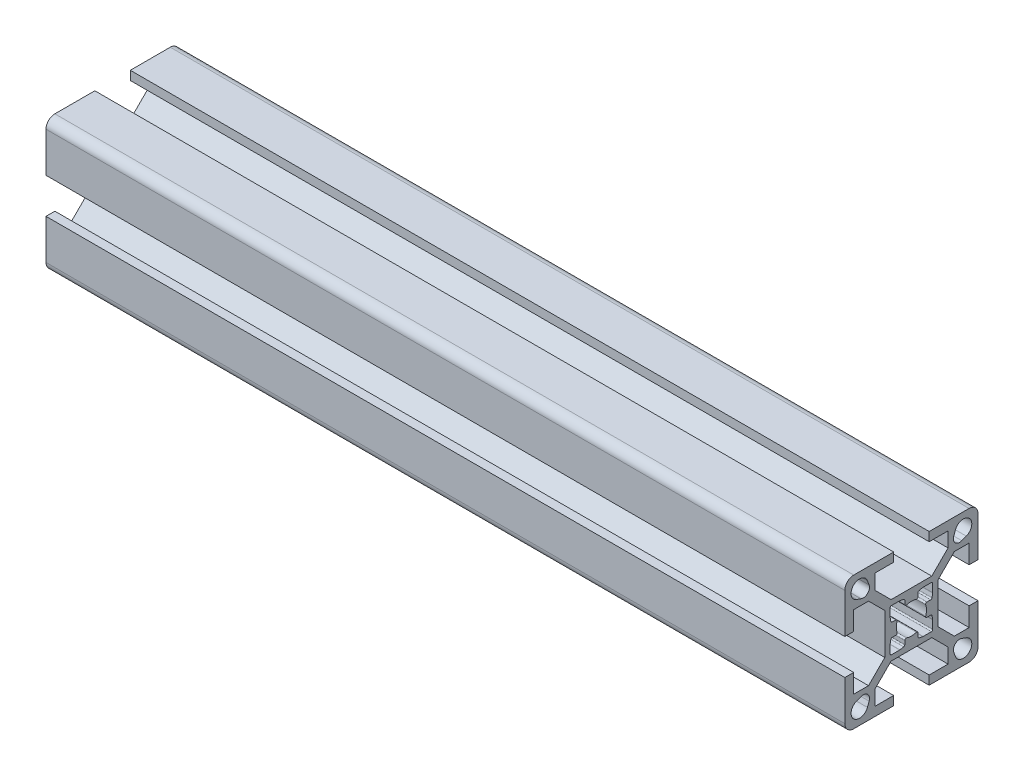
ISO-10303-21;
HEADER;
FILE_DESCRIPTION(('STEP AP214'),'2;1');
FILE_NAME('part.step','',(''),(''),'','','');
FILE_SCHEMA(('AUTOMOTIVE_DESIGN { 1 0 10303 214 1 1 1 1 }'));
ENDSEC;
DATA;
#1=APPLICATION_CONTEXT('core data for automotive mechanical design processes');
#2=APPLICATION_PROTOCOL_DEFINITION('international standard','automotive_design',2000,#1);
#3=PRODUCT_CONTEXT('',#1,'mechanical');
#4=PRODUCT('Part','Part','',(#3));
#5=PRODUCT_RELATED_PRODUCT_CATEGORY('part','',(#4));
#6=PRODUCT_DEFINITION_FORMATION('','',#4);
#7=PRODUCT_DEFINITION_CONTEXT('part definition',#1,'design');
#8=PRODUCT_DEFINITION('design','',#6,#7);
#9=PRODUCT_DEFINITION_SHAPE('','',#8);
#10=(LENGTH_UNIT() NAMED_UNIT(*) SI_UNIT(.MILLI.,.METRE.));
#11=(NAMED_UNIT(*) PLANE_ANGLE_UNIT() SI_UNIT($,.RADIAN.));
#12=(NAMED_UNIT(*) SI_UNIT($,.STERADIAN.) SOLID_ANGLE_UNIT());
#13=UNCERTAINTY_MEASURE_WITH_UNIT(LENGTH_MEASURE(1.E-05),#10,'distance_accuracy_value','');
#14=(GEOMETRIC_REPRESENTATION_CONTEXT(3) GLOBAL_UNCERTAINTY_ASSIGNED_CONTEXT((#13)) GLOBAL_UNIT_ASSIGNED_CONTEXT((#10,
#11,#12)) REPRESENTATION_CONTEXT('',''));
#15=CARTESIAN_POINT('',(0.,0.,0.));
#16=DIRECTION('',(0.,0.,1.));
#17=DIRECTION('',(1.,0.,0.));
#18=AXIS2_PLACEMENT_3D('',#15,#16,#17);
#19=CARTESIAN_POINT('',(180.,13.,13.));
#20=DIRECTION('',(1.,0.,0.));
#21=DIRECTION('',(0.,0.,-1.));
#22=AXIS2_PLACEMENT_3D('',#19,#20,#21);
#23=PLANE('',#22);
#24=CARTESIAN_POINT('',(180.,13.,13.));
#25=DIRECTION('',(1.,0.,0.));
#26=DIRECTION('',(0.,0.,-1.));
#27=AXIS2_PLACEMENT_3D('',#24,#25,#26);
#28=CIRCLE('',#27,1.99999999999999);
#29=CARTESIAN_POINT('',(180.,15.,13.));
#30=VERTEX_POINT('',#29);
#31=CARTESIAN_POINT('',(180.,13.,15.));
#32=VERTEX_POINT('',#31);
#33=EDGE_CURVE('E1300',#30,#32,#28,.T.);
#34=ORIENTED_EDGE('',*,*,#33,.T.);
#35=DIRECTION('',(0.,-1.,0.));
#36=VECTOR('',#35,1.);
#37=CARTESIAN_POINT('',(180.,13.,15.));
#38=LINE('',#37,#36);
#39=CARTESIAN_POINT('',(180.,3.99999999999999,15.));
#40=VERTEX_POINT('',#39);
#41=EDGE_CURVE('E1303',#32,#40,#38,.T.);
#42=ORIENTED_EDGE('',*,*,#41,.T.);
#43=DIRECTION('',(0.,0.,-1.));
#44=VECTOR('',#43,1.);
#45=CARTESIAN_POINT('',(180.,3.99999999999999,15.));
#46=LINE('',#45,#44);
#47=CARTESIAN_POINT('',(180.,3.99999999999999,13.));
#48=VERTEX_POINT('',#47);
#49=EDGE_CURVE('E1306',#40,#48,#46,.T.);
#50=ORIENTED_EDGE('',*,*,#49,.T.);
#51=DIRECTION('',(0.,1.,0.));
#52=VECTOR('',#51,1.);
#53=CARTESIAN_POINT('',(180.,3.99999999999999,13.));
#54=LINE('',#53,#52);
#55=CARTESIAN_POINT('',(180.,8.24999999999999,13.));
#56=VERTEX_POINT('',#55);
#57=EDGE_CURVE('E1308',#48,#56,#54,.T.);
#58=ORIENTED_EDGE('',*,*,#57,.T.);
#59=DIRECTION('',(0.,0.,-1.));
#60=VECTOR('',#59,1.);
#61=CARTESIAN_POINT('',(180.,8.24999999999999,13.));
#62=LINE('',#61,#60);
#63=CARTESIAN_POINT('',(180.,8.24999999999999,9.66421356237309));
#64=VERTEX_POINT('',#63);
#65=EDGE_CURVE('E1310',#56,#64,#62,.T.);
#66=ORIENTED_EDGE('',*,*,#65,.T.);
#67=DIRECTION('',(0.,-0.707106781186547,-0.707106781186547));
#68=VECTOR('',#67,1.);
#69=CARTESIAN_POINT('',(180.,8.24999999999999,9.66421356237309));
#70=LINE('',#69,#68);
#71=CARTESIAN_POINT('',(180.,4.5857864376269,6.));
#72=VERTEX_POINT('',#71);
#73=EDGE_CURVE('E1312',#64,#72,#70,.T.);
#74=ORIENTED_EDGE('',*,*,#73,.T.);
#75=DIRECTION('',(0.,-1.,0.));
#76=VECTOR('',#75,1.);
#77=CARTESIAN_POINT('',(180.,4.5857864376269,6.));
#78=LINE('',#77,#76);
#79=CARTESIAN_POINT('',(180.,-4.58578643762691,6.));
#80=VERTEX_POINT('',#79);
#81=EDGE_CURVE('E1314',#72,#80,#78,.T.);
#82=ORIENTED_EDGE('',*,*,#81,.T.);
#83=DIRECTION('',(0.,-0.707106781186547,0.707106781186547));
#84=VECTOR('',#83,1.);
#85=CARTESIAN_POINT('',(180.,-4.58578643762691,6.));
#86=LINE('',#85,#84);
#87=CARTESIAN_POINT('',(180.,-8.25,9.66421356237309));
#88=VERTEX_POINT('',#87);
#89=EDGE_CURVE('E1316',#80,#88,#86,.T.);
#90=ORIENTED_EDGE('',*,*,#89,.T.);
#91=DIRECTION('',(0.,0.,1.));
#92=VECTOR('',#91,1.);
#93=CARTESIAN_POINT('',(180.,-8.25,9.66421356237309));
#94=LINE('',#93,#92);
#95=CARTESIAN_POINT('',(180.,-8.25,13.));
#96=VERTEX_POINT('',#95);
#97=EDGE_CURVE('E1318',#88,#96,#94,.T.);
#98=ORIENTED_EDGE('',*,*,#97,.T.);
#99=DIRECTION('',(0.,1.,0.));
#100=VECTOR('',#99,1.);
#101=CARTESIAN_POINT('',(180.,-8.25,13.));
#102=LINE('',#101,#100);
#103=CARTESIAN_POINT('',(180.,-4.,13.));
#104=VERTEX_POINT('',#103);
#105=EDGE_CURVE('E1320',#96,#104,#102,.T.);
#106=ORIENTED_EDGE('',*,*,#105,.T.);
#107=DIRECTION('',(0.,0.,1.));
#108=VECTOR('',#107,1.);
#109=CARTESIAN_POINT('',(180.,-4.,13.));
#110=LINE('',#109,#108);
#111=CARTESIAN_POINT('',(180.,-4.,15.));
#112=VERTEX_POINT('',#111);
#113=EDGE_CURVE('E1322',#104,#112,#110,.T.);
#114=ORIENTED_EDGE('',*,*,#113,.T.);
#115=DIRECTION('',(0.,-1.,0.));
#116=VECTOR('',#115,1.);
#117=CARTESIAN_POINT('',(180.,-4.,15.));
#118=LINE('',#117,#116);
#119=CARTESIAN_POINT('',(180.,-13.,15.));
#120=VERTEX_POINT('',#119);
#121=EDGE_CURVE('E1324',#112,#120,#118,.T.);
#122=ORIENTED_EDGE('',*,*,#121,.T.);
#123=CARTESIAN_POINT('',(180.,-13.,13.));
#124=DIRECTION('',(1.,0.,0.));
#125=DIRECTION('',(0.,0.,-1.));
#126=AXIS2_PLACEMENT_3D('',#123,#124,#125);
#127=CIRCLE('',#126,2.);
#128=CARTESIAN_POINT('',(180.,-15.,13.));
#129=VERTEX_POINT('',#128);
#130=EDGE_CURVE('E1326',#120,#129,#127,.T.);
#131=ORIENTED_EDGE('',*,*,#130,.T.);
#132=DIRECTION('',(0.,0.,-1.));
#133=VECTOR('',#132,1.);
#134=CARTESIAN_POINT('',(180.,-15.,13.));
#135=LINE('',#134,#133);
#136=CARTESIAN_POINT('',(180.,-15.,4.));
#137=VERTEX_POINT('',#136);
#138=EDGE_CURVE('E1328',#129,#137,#135,.T.);
#139=ORIENTED_EDGE('',*,*,#138,.T.);
#140=DIRECTION('',(0.,1.,0.));
#141=VECTOR('',#140,1.);
#142=CARTESIAN_POINT('',(180.,-15.,4.));
#143=LINE('',#142,#141);
#144=CARTESIAN_POINT('',(180.,-13.,4.));
#145=VERTEX_POINT('',#144);
#146=EDGE_CURVE('E1330',#137,#145,#143,.T.);
#147=ORIENTED_EDGE('',*,*,#146,.T.);
#148=DIRECTION('',(0.,0.,1.));
#149=VECTOR('',#148,1.);
#150=CARTESIAN_POINT('',(180.,-13.,4.));
#151=LINE('',#150,#149);
#152=CARTESIAN_POINT('',(180.,-13.,8.25));
#153=VERTEX_POINT('',#152);
#154=EDGE_CURVE('E1332',#145,#153,#151,.T.);
#155=ORIENTED_EDGE('',*,*,#154,.T.);
#156=DIRECTION('',(0.,1.,0.));
#157=VECTOR('',#156,1.);
#158=CARTESIAN_POINT('',(180.,-13.,8.25));
#159=LINE('',#158,#157);
#160=CARTESIAN_POINT('',(180.,-9.6642135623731,8.25));
#161=VERTEX_POINT('',#160);
#162=EDGE_CURVE('E1334',#153,#161,#159,.T.);
#163=ORIENTED_EDGE('',*,*,#162,.T.);
#164=DIRECTION('',(0.,0.707106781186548,-0.707106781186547));
#165=VECTOR('',#164,1.);
#166=CARTESIAN_POINT('',(180.,-9.6642135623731,8.25));
#167=LINE('',#166,#165);
#168=CARTESIAN_POINT('',(180.,-6.00000000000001,4.58578643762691));
#169=VERTEX_POINT('',#168);
#170=EDGE_CURVE('E1336',#161,#169,#167,.T.);
#171=ORIENTED_EDGE('',*,*,#170,.T.);
#172=DIRECTION('',(0.,0.,-1.));
#173=VECTOR('',#172,1.);
#174=CARTESIAN_POINT('',(180.,-6.00000000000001,4.58578643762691));
#175=LINE('',#174,#173);
#176=CARTESIAN_POINT('',(180.,-6.00000000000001,-4.58578643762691));
#177=VERTEX_POINT('',#176);
#178=EDGE_CURVE('E1338',#169,#177,#175,.T.);
#179=ORIENTED_EDGE('',*,*,#178,.T.);
#180=DIRECTION('',(0.,-0.707106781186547,-0.707106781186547));
#181=VECTOR('',#180,1.);
#182=CARTESIAN_POINT('',(180.,-6.00000000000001,-4.58578643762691));
#183=LINE('',#182,#181);
#184=CARTESIAN_POINT('',(180.,-9.6642135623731,-8.25000000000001));
#185=VERTEX_POINT('',#184);
#186=EDGE_CURVE('E1340',#177,#185,#183,.T.);
#187=ORIENTED_EDGE('',*,*,#186,.T.);
#188=DIRECTION('',(0.,-1.,0.));
#189=VECTOR('',#188,1.);
#190=CARTESIAN_POINT('',(180.,-9.6642135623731,-8.25000000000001));
#191=LINE('',#190,#189);
#192=CARTESIAN_POINT('',(180.,-13.,-8.25000000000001));
#193=VERTEX_POINT('',#192);
#194=EDGE_CURVE('E1342',#185,#193,#191,.T.);
#195=ORIENTED_EDGE('',*,*,#194,.T.);
#196=DIRECTION('',(0.,0.,1.));
#197=VECTOR('',#196,1.);
#198=CARTESIAN_POINT('',(180.,-13.,-8.25000000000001));
#199=LINE('',#198,#197);
#200=CARTESIAN_POINT('',(180.,-13.,-4.));
#201=VERTEX_POINT('',#200);
#202=EDGE_CURVE('E1344',#193,#201,#199,.T.);
#203=ORIENTED_EDGE('',*,*,#202,.T.);
#204=DIRECTION('',(0.,-1.,0.));
#205=VECTOR('',#204,1.);
#206=CARTESIAN_POINT('',(180.,-13.,-4.));
#207=LINE('',#206,#205);
#208=CARTESIAN_POINT('',(180.,-15.,-4.));
#209=VERTEX_POINT('',#208);
#210=EDGE_CURVE('E1346',#201,#209,#207,.T.);
#211=ORIENTED_EDGE('',*,*,#210,.T.);
#212=DIRECTION('',(0.,0.,-1.));
#213=VECTOR('',#212,1.);
#214=CARTESIAN_POINT('',(180.,-15.,-4.));
#215=LINE('',#214,#213);
#216=CARTESIAN_POINT('',(180.,-15.,-13.));
#217=VERTEX_POINT('',#216);
#218=EDGE_CURVE('E1348',#209,#217,#215,.T.);
#219=ORIENTED_EDGE('',*,*,#218,.T.);
#220=CARTESIAN_POINT('',(180.,-13.,-13.));
#221=DIRECTION('',(1.,0.,0.));
#222=DIRECTION('',(0.,0.,-1.));
#223=AXIS2_PLACEMENT_3D('',#220,#221,#222);
#224=CIRCLE('',#223,1.99999999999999);
#225=CARTESIAN_POINT('',(180.,-13.,-15.));
#226=VERTEX_POINT('',#225);
#227=EDGE_CURVE('E1350',#217,#226,#224,.T.);
#228=ORIENTED_EDGE('',*,*,#227,.T.);
#229=DIRECTION('',(0.,1.,0.));
#230=VECTOR('',#229,1.);
#231=CARTESIAN_POINT('',(180.,-13.,-15.));
#232=LINE('',#231,#230);
#233=CARTESIAN_POINT('',(180.,-4.00000000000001,-15.));
#234=VERTEX_POINT('',#233);
#235=EDGE_CURVE('E1352',#226,#234,#232,.T.);
#236=ORIENTED_EDGE('',*,*,#235,.T.);
#237=DIRECTION('',(0.,0.,1.));
#238=VECTOR('',#237,1.);
#239=CARTESIAN_POINT('',(180.,-4.00000000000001,-15.));
#240=LINE('',#239,#238);
#241=CARTESIAN_POINT('',(180.,-4.00000000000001,-13.));
#242=VERTEX_POINT('',#241);
#243=EDGE_CURVE('E1354',#234,#242,#240,.T.);
#244=ORIENTED_EDGE('',*,*,#243,.T.);
#245=DIRECTION('',(0.,-1.,0.));
#246=VECTOR('',#245,1.);
#247=CARTESIAN_POINT('',(180.,-4.00000000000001,-13.));
#248=LINE('',#247,#246);
#249=CARTESIAN_POINT('',(180.,-8.25000000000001,-13.));
#250=VERTEX_POINT('',#249);
#251=EDGE_CURVE('E1356',#242,#250,#248,.T.);
#252=ORIENTED_EDGE('',*,*,#251,.T.);
#253=DIRECTION('',(0.,0.,1.));
#254=VECTOR('',#253,1.);
#255=CARTESIAN_POINT('',(180.,-8.25000000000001,-13.));
#256=LINE('',#255,#254);
#257=CARTESIAN_POINT('',(180.,-8.25000000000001,-9.6642135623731));
#258=VERTEX_POINT('',#257);
#259=EDGE_CURVE('E1358',#250,#258,#256,.T.);
#260=ORIENTED_EDGE('',*,*,#259,.T.);
#261=DIRECTION('',(0.,0.707106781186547,0.707106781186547));
#262=VECTOR('',#261,1.);
#263=CARTESIAN_POINT('',(180.,-8.25000000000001,-9.6642135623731));
#264=LINE('',#263,#262);
#265=CARTESIAN_POINT('',(180.,-4.58578643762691,-6.00000000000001));
#266=VERTEX_POINT('',#265);
#267=EDGE_CURVE('E1360',#258,#266,#264,.T.);
#268=ORIENTED_EDGE('',*,*,#267,.T.);
#269=DIRECTION('',(0.,1.,0.));
#270=VECTOR('',#269,1.);
#271=CARTESIAN_POINT('',(180.,-4.58578643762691,-6.00000000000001));
#272=LINE('',#271,#270);
#273=CARTESIAN_POINT('',(180.,4.5857864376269,-6.00000000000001));
#274=VERTEX_POINT('',#273);
#275=EDGE_CURVE('E1362',#266,#274,#272,.T.);
#276=ORIENTED_EDGE('',*,*,#275,.T.);
#277=DIRECTION('',(0.,0.707106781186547,-0.707106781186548));
#278=VECTOR('',#277,1.);
#279=CARTESIAN_POINT('',(180.,4.5857864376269,-6.00000000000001));
#280=LINE('',#279,#278);
#281=CARTESIAN_POINT('',(180.,8.24999999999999,-9.6642135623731));
#282=VERTEX_POINT('',#281);
#283=EDGE_CURVE('E1364',#274,#282,#280,.T.);
#284=ORIENTED_EDGE('',*,*,#283,.T.);
#285=DIRECTION('',(0.,0.,-1.));
#286=VECTOR('',#285,1.);
#287=CARTESIAN_POINT('',(180.,8.24999999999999,-9.6642135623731));
#288=LINE('',#287,#286);
#289=CARTESIAN_POINT('',(180.,8.24999999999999,-13.));
#290=VERTEX_POINT('',#289);
#291=EDGE_CURVE('E1366',#282,#290,#288,.T.);
#292=ORIENTED_EDGE('',*,*,#291,.T.);
#293=DIRECTION('',(0.,-1.,0.));
#294=VECTOR('',#293,1.);
#295=CARTESIAN_POINT('',(180.,8.24999999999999,-13.));
#296=LINE('',#295,#294);
#297=CARTESIAN_POINT('',(180.,3.99999999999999,-13.));
#298=VERTEX_POINT('',#297);
#299=EDGE_CURVE('E1368',#290,#298,#296,.T.);
#300=ORIENTED_EDGE('',*,*,#299,.T.);
#301=DIRECTION('',(0.,0.,-1.));
#302=VECTOR('',#301,1.);
#303=CARTESIAN_POINT('',(180.,3.99999999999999,-13.));
#304=LINE('',#303,#302);
#305=CARTESIAN_POINT('',(180.,3.99999999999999,-15.));
#306=VERTEX_POINT('',#305);
#307=EDGE_CURVE('E1370',#298,#306,#304,.T.);
#308=ORIENTED_EDGE('',*,*,#307,.T.);
#309=DIRECTION('',(0.,1.,0.));
#310=VECTOR('',#309,1.);
#311=CARTESIAN_POINT('',(180.,3.99999999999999,-15.));
#312=LINE('',#311,#310);
#313=CARTESIAN_POINT('',(180.,13.,-15.));
#314=VERTEX_POINT('',#313);
#315=EDGE_CURVE('E1372',#306,#314,#312,.T.);
#316=ORIENTED_EDGE('',*,*,#315,.T.);
#317=CARTESIAN_POINT('',(180.,13.,-13.));
#318=DIRECTION('',(1.,0.,0.));
#319=DIRECTION('',(0.,0.,-1.));
#320=AXIS2_PLACEMENT_3D('',#317,#318,#319);
#321=CIRCLE('',#320,2.);
#322=CARTESIAN_POINT('',(180.,15.,-13.));
#323=VERTEX_POINT('',#322);
#324=EDGE_CURVE('E1374',#314,#323,#321,.T.);
#325=ORIENTED_EDGE('',*,*,#324,.T.);
#326=DIRECTION('',(0.,0.,1.));
#327=VECTOR('',#326,1.);
#328=CARTESIAN_POINT('',(180.,15.,-13.));
#329=LINE('',#328,#327);
#330=CARTESIAN_POINT('',(180.,15.,-4.));
#331=VERTEX_POINT('',#330);
#332=EDGE_CURVE('E1376',#323,#331,#329,.T.);
#333=ORIENTED_EDGE('',*,*,#332,.T.);
#334=DIRECTION('',(0.,-1.,0.));
#335=VECTOR('',#334,1.);
#336=CARTESIAN_POINT('',(180.,15.,-4.));
#337=LINE('',#336,#335);
#338=CARTESIAN_POINT('',(180.,13.,-4.));
#339=VERTEX_POINT('',#338);
#340=EDGE_CURVE('E1378',#331,#339,#337,.T.);
#341=ORIENTED_EDGE('',*,*,#340,.T.);
#342=DIRECTION('',(0.,0.,-1.));
#343=VECTOR('',#342,1.);
#344=CARTESIAN_POINT('',(180.,13.,-4.));
#345=LINE('',#344,#343);
#346=CARTESIAN_POINT('',(180.,13.,-8.25000000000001));
#347=VERTEX_POINT('',#346);
#348=EDGE_CURVE('E1380',#339,#347,#345,.T.);
#349=ORIENTED_EDGE('',*,*,#348,.T.);
#350=DIRECTION('',(0.,-1.,0.));
#351=VECTOR('',#350,1.);
#352=CARTESIAN_POINT('',(180.,13.,-8.25000000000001));
#353=LINE('',#352,#351);
#354=CARTESIAN_POINT('',(180.,9.66421356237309,-8.25000000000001));
#355=VERTEX_POINT('',#354);
#356=EDGE_CURVE('E1382',#347,#355,#353,.T.);
#357=ORIENTED_EDGE('',*,*,#356,.T.);
#358=DIRECTION('',(0.,-0.707106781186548,0.707106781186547));
#359=VECTOR('',#358,1.);
#360=CARTESIAN_POINT('',(180.,9.66421356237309,-8.25000000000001));
#361=LINE('',#360,#359);
#362=CARTESIAN_POINT('',(180.,5.99999999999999,-4.58578643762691));
#363=VERTEX_POINT('',#362);
#364=EDGE_CURVE('E1384',#355,#363,#361,.T.);
#365=ORIENTED_EDGE('',*,*,#364,.T.);
#366=DIRECTION('',(0.,0.,1.));
#367=VECTOR('',#366,1.);
#368=CARTESIAN_POINT('',(180.,5.99999999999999,-4.58578643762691));
#369=LINE('',#368,#367);
#370=CARTESIAN_POINT('',(180.,5.99999999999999,4.58578643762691));
#371=VERTEX_POINT('',#370);
#372=EDGE_CURVE('E1386',#363,#371,#369,.T.);
#373=ORIENTED_EDGE('',*,*,#372,.T.);
#374=DIRECTION('',(0.,0.707106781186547,0.707106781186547));
#375=VECTOR('',#374,1.);
#376=CARTESIAN_POINT('',(180.,5.99999999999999,4.58578643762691));
#377=LINE('',#376,#375);
#378=CARTESIAN_POINT('',(180.,9.66421356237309,8.25));
#379=VERTEX_POINT('',#378);
#380=EDGE_CURVE('E1388',#371,#379,#377,.T.);
#381=ORIENTED_EDGE('',*,*,#380,.T.);
#382=DIRECTION('',(0.,1.,0.));
#383=VECTOR('',#382,1.);
#384=CARTESIAN_POINT('',(180.,9.66421356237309,8.25));
#385=LINE('',#384,#383);
#386=CARTESIAN_POINT('',(180.,13.,8.25));
#387=VERTEX_POINT('',#386);
#388=EDGE_CURVE('E1390',#379,#387,#385,.T.);
#389=ORIENTED_EDGE('',*,*,#388,.T.);
#390=DIRECTION('',(0.,0.,-1.));
#391=VECTOR('',#390,1.);
#392=CARTESIAN_POINT('',(180.,13.,8.25));
#393=LINE('',#392,#391);
#394=CARTESIAN_POINT('',(180.,13.,4.));
#395=VERTEX_POINT('',#394);
#396=EDGE_CURVE('E1392',#387,#395,#393,.T.);
#397=ORIENTED_EDGE('',*,*,#396,.T.);
#398=DIRECTION('',(0.,1.,0.));
#399=VECTOR('',#398,1.);
#400=CARTESIAN_POINT('',(180.,13.,4.));
#401=LINE('',#400,#399);
#402=CARTESIAN_POINT('',(180.,15.,4.));
#403=VERTEX_POINT('',#402);
#404=EDGE_CURVE('E1394',#395,#403,#401,.T.);
#405=ORIENTED_EDGE('',*,*,#404,.T.);
#406=DIRECTION('',(0.,0.,1.));
#407=VECTOR('',#406,1.);
#408=CARTESIAN_POINT('',(180.,15.,4.));
#409=LINE('',#408,#407);
#410=EDGE_CURVE('E1396',#403,#30,#409,.T.);
#411=ORIENTED_EDGE('',*,*,#410,.T.);
#412=EDGE_LOOP('',(#34,#42,#50,#58,#66,#74,#82,#90,#98,#106,#114,#122,#131,#139,#147,#155,#163,
#171,#179,#187,#195,#203,#211,#219,#228,#236,#244,#252,#260,#268,#276,#284,#292,#300,#308,#316,
#325,#333,#341,#349,#357,#365,#373,#381,#389,#397,#405,#411));
#413=FACE_BOUND('',#412,.T.);
#414=DIRECTION('',(0.,-0.348174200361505,-0.93742985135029));
#415=VECTOR('',#414,1.);
#416=CARTESIAN_POINT('',(180.,9.91888328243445,12.3615309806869));
#417=LINE('',#416,#415);
#418=CARTESIAN_POINT('',(180.,9.91888328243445,12.3615309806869));
#419=VERTEX_POINT('',#418);
#420=CARTESIAN_POINT('',(180.,9.53907007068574,11.3389157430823));
#421=VERTEX_POINT('',#420);
#422=EDGE_CURVE('E1271',#419,#421,#417,.T.);
#423=ORIENTED_EDGE('',*,*,#422,.F.);
#424=CARTESIAN_POINT('',(180.,11.7,11.7));
#425=DIRECTION('',(1.,0.,0.));
#426=DIRECTION('',(0.,0.,-1.));
#427=AXIS2_PLACEMENT_3D('',#424,#425,#426);
#428=CIRCLE('',#427,1.9);
#429=CARTESIAN_POINT('',(180.,12.3615309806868,9.91888328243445));
#430=VERTEX_POINT('',#429);
#431=EDGE_CURVE('E1269',#430,#419,#428,.T.);
#432=ORIENTED_EDGE('',*,*,#431,.F.);
#433=DIRECTION('',(0.,0.937429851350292,0.3481742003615));
#434=VECTOR('',#433,1.);
#435=CARTESIAN_POINT('',(180.,11.3389157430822,9.53907007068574));
#436=LINE('',#435,#434);
#437=CARTESIAN_POINT('',(180.,11.3389157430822,9.53907007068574));
#438=VERTEX_POINT('',#437);
#439=EDGE_CURVE('E1277',#438,#430,#436,.T.);
#440=ORIENTED_EDGE('',*,*,#439,.F.);
#441=CARTESIAN_POINT('',(180.,10.8514718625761,10.8514718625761));
#442=DIRECTION('',(1.,0.,0.));
#443=DIRECTION('',(0.,0.,-1.));
#444=AXIS2_PLACEMENT_3D('',#441,#442,#443);
#445=CIRCLE('',#444,1.4);
#446=EDGE_CURVE('E1274',#421,#438,#445,.T.);
#447=ORIENTED_EDGE('',*,*,#446,.F.);
#448=EDGE_LOOP('',(#423,#432,#440,#447));
#449=FACE_BOUND('',#448,.T.);
#450=DIRECTION('',(0.,0.3481742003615,-0.937429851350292));
#451=VECTOR('',#450,1.);
#452=CARTESIAN_POINT('',(180.,9.53907007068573,-11.3389157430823));
#453=LINE('',#452,#451);
#454=CARTESIAN_POINT('',(180.,9.53907007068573,-11.3389157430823));
#455=VERTEX_POINT('',#454);
#456=CARTESIAN_POINT('',(180.,9.91888328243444,-12.3615309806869));
#457=VERTEX_POINT('',#456);
#458=EDGE_CURVE('E1240',#455,#457,#453,.T.);
#459=ORIENTED_EDGE('',*,*,#458,.F.);
#460=CARTESIAN_POINT('',(180.,10.8514718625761,-10.8514718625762));
#461=DIRECTION('',(1.,0.,0.));
#462=DIRECTION('',(0.,0.,-1.));
#463=AXIS2_PLACEMENT_3D('',#460,#461,#462);
#464=CIRCLE('',#463,1.4);
#465=CARTESIAN_POINT('',(180.,11.3389157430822,-9.53907007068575));
#466=VERTEX_POINT('',#465);
#467=EDGE_CURVE('E1238',#466,#455,#464,.T.);
#468=ORIENTED_EDGE('',*,*,#467,.F.);
#469=DIRECTION('',(0.,-0.937429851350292,0.3481742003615));
#470=VECTOR('',#469,1.);
#471=CARTESIAN_POINT('',(180.,12.3615309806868,-9.91888328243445));
#472=LINE('',#471,#470);
#473=CARTESIAN_POINT('',(180.,12.3615309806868,-9.91888328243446));
#474=VERTEX_POINT('',#473);
#475=EDGE_CURVE('E1246',#474,#466,#472,.T.);
#476=ORIENTED_EDGE('',*,*,#475,.F.);
#477=CARTESIAN_POINT('',(180.,11.7,-11.7));
#478=DIRECTION('',(1.,0.,0.));
#479=DIRECTION('',(0.,0.,-1.));
#480=AXIS2_PLACEMENT_3D('',#477,#478,#479);
#481=CIRCLE('',#480,1.9);
#482=EDGE_CURVE('E1243',#457,#474,#481,.T.);
#483=ORIENTED_EDGE('',*,*,#482,.F.);
#484=EDGE_LOOP('',(#459,#468,#476,#483));
#485=FACE_BOUND('',#484,.T.);
#486=DIRECTION('',(0.,0.,-1.));
#487=VECTOR('',#486,1.);
#488=CARTESIAN_POINT('',(180.,-4.80000000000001,4.5));
#489=LINE('',#488,#487);
#490=CARTESIAN_POINT('',(180.,-4.80000000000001,4.5));
#491=VERTEX_POINT('',#490);
#492=CARTESIAN_POINT('',(180.,-4.80000000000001,2.64443357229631));
#493=VERTEX_POINT('',#492);
#494=EDGE_CURVE('E845',#491,#493,#489,.T.);
#495=ORIENTED_EDGE('',*,*,#494,.F.);
#496=CARTESIAN_POINT('',(180.,-4.50000000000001,4.5));
#497=DIRECTION('',(1.,0.,0.));
#498=DIRECTION('',(0.,0.,-1.));
#499=AXIS2_PLACEMENT_3D('',#496,#497,#498);
#500=CIRCLE('',#499,0.299999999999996);
#501=CARTESIAN_POINT('',(180.,-4.50000000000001,4.8));
#502=VERTEX_POINT('',#501);
#503=EDGE_CURVE('E843',#502,#491,#500,.T.);
#504=ORIENTED_EDGE('',*,*,#503,.F.);
#505=DIRECTION('',(0.,-1.,0.));
#506=VECTOR('',#505,1.);
#507=CARTESIAN_POINT('',(180.,-2.6444335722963,4.8));
#508=LINE('',#507,#506);
#509=CARTESIAN_POINT('',(180.,-2.64443357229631,4.8));
#510=VERTEX_POINT('',#509);
#511=EDGE_CURVE('E955',#510,#502,#508,.T.);
#512=ORIENTED_EDGE('',*,*,#511,.F.);
#513=CARTESIAN_POINT('',(180.,-2.6444335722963,4.50000000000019));
#514=DIRECTION('',(1.,0.,0.));
#515=DIRECTION('',(0.,0.,-1.));
#516=AXIS2_PLACEMENT_3D('',#513,#514,#515);
#517=CIRCLE('',#516,0.299999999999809);
#518=CARTESIAN_POINT('',(180.,-2.58719087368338,4.7944881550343));
#519=VERTEX_POINT('',#518);
#520=EDGE_CURVE('E952',#519,#510,#517,.T.);
#521=ORIENTED_EDGE('',*,*,#520,.F.);
#522=DIRECTION('',(0.,-0.981627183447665,0.190808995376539));
#523=VECTOR('',#522,1.);
#524=CARTESIAN_POINT('',(180.,-1.74275730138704,4.63034689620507));
#525=LINE('',#524,#523);
#526=CARTESIAN_POINT('',(180.,-1.74275730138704,4.63034689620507));
#527=VERTEX_POINT('',#526);
#528=EDGE_CURVE('E950',#527,#519,#525,.T.);
#529=ORIENTED_EDGE('',*,*,#528,.F.);
#530=CARTESIAN_POINT('',(180.,-1.8,4.33585874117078));
#531=DIRECTION('',(1.,0.,0.));
#532=DIRECTION('',(0.,0.,-1.));
#533=AXIS2_PLACEMENT_3D('',#530,#531,#532);
#534=CIRCLE('',#533,0.299999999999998);
#535=CARTESIAN_POINT('',(180.,-1.50000000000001,4.33585874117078));
#536=VERTEX_POINT('',#535);
#537=EDGE_CURVE('E948',#536,#527,#534,.T.);
#538=ORIENTED_EDGE('',*,*,#537,.F.);
#539=DIRECTION('',(0.,0.,1.));
#540=VECTOR('',#539,1.);
#541=CARTESIAN_POINT('',(180.,-1.50000000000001,3.5));
#542=LINE('',#541,#540);
#543=CARTESIAN_POINT('',(180.,-1.50000000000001,3.5));
#544=VERTEX_POINT('',#543);
#545=EDGE_CURVE('E946',#544,#536,#542,.T.);
#546=ORIENTED_EDGE('',*,*,#545,.F.);
#547=CARTESIAN_POINT('',(180.,-1.20000000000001,3.5));
#548=DIRECTION('',(-1.,0.,0.));
#549=DIRECTION('',(0.,0.,-1.));
#550=AXIS2_PLACEMENT_3D('',#547,#548,#549);
#551=CIRCLE('',#550,0.3);
#552=CARTESIAN_POINT('',(180.,-1.10270270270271,3.21621621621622));
#553=VERTEX_POINT('',#552);
#554=EDGE_CURVE('E944',#553,#544,#551,.T.);
#555=ORIENTED_EDGE('',*,*,#554,.F.);
#556=CARTESIAN_POINT('',(180.,0.,0.));
#557=DIRECTION('',(1.,0.,0.));
#558=DIRECTION('',(0.,0.,-1.));
#559=AXIS2_PLACEMENT_3D('',#556,#557,#558);
#560=CIRCLE('',#559,3.40000000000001);
#561=CARTESIAN_POINT('',(180.,1.1027027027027,3.21621621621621));
#562=VERTEX_POINT('',#561);
#563=EDGE_CURVE('E942',#562,#553,#560,.T.);
#564=ORIENTED_EDGE('',*,*,#563,.F.);
#565=CARTESIAN_POINT('',(180.,1.2,3.5));
#566=DIRECTION('',(-1.,0.,0.));
#567=DIRECTION('',(0.,0.,-1.));
#568=AXIS2_PLACEMENT_3D('',#565,#566,#567);
#569=CIRCLE('',#568,0.3);
#570=CARTESIAN_POINT('',(180.,1.5,3.5));
#571=VERTEX_POINT('',#570);
#572=EDGE_CURVE('E940',#571,#562,#569,.T.);
#573=ORIENTED_EDGE('',*,*,#572,.F.);
#574=DIRECTION('',(0.,0.,-1.));
#575=VECTOR('',#574,1.);
#576=CARTESIAN_POINT('',(180.,1.5,4.33585874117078));
#577=LINE('',#576,#575);
#578=CARTESIAN_POINT('',(180.,1.5,4.33585874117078));
#579=VERTEX_POINT('',#578);
#580=EDGE_CURVE('E938',#579,#571,#577,.T.);
#581=ORIENTED_EDGE('',*,*,#580,.F.);
#582=CARTESIAN_POINT('',(180.,1.79999999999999,4.33585874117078));
#583=DIRECTION('',(1.,0.,0.));
#584=DIRECTION('',(0.,0.,-1.));
#585=AXIS2_PLACEMENT_3D('',#582,#583,#584);
#586=CIRCLE('',#585,0.299999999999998);
#587=CARTESIAN_POINT('',(180.,1.74275730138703,4.63034689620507));
#588=VERTEX_POINT('',#587);
#589=EDGE_CURVE('E936',#588,#579,#586,.T.);
#590=ORIENTED_EDGE('',*,*,#589,.F.);
#591=DIRECTION('',(0.,-0.981627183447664,-0.190808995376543));
#592=VECTOR('',#591,1.);
#593=CARTESIAN_POINT('',(180.,2.58719087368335,4.7944881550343));
#594=LINE('',#593,#592);
#595=CARTESIAN_POINT('',(180.,2.58719087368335,4.7944881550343));
#596=VERTEX_POINT('',#595);
#597=EDGE_CURVE('E934',#596,#588,#594,.T.);
#598=ORIENTED_EDGE('',*,*,#597,.F.);
#599=CARTESIAN_POINT('',(180.,2.6444335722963,4.50000000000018));
#600=DIRECTION('',(1.,0.,0.));
#601=DIRECTION('',(0.,0.,-1.));
#602=AXIS2_PLACEMENT_3D('',#599,#600,#601);
#603=CIRCLE('',#602,0.299999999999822);
#604=CARTESIAN_POINT('',(180.,2.6444335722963,4.8));
#605=VERTEX_POINT('',#604);
#606=EDGE_CURVE('E932',#605,#596,#603,.T.);
#607=ORIENTED_EDGE('',*,*,#606,.F.);
#608=DIRECTION('',(0.,-1.,0.));
#609=VECTOR('',#608,1.);
#610=CARTESIAN_POINT('',(180.,4.5,4.8));
#611=LINE('',#610,#609);
#612=CARTESIAN_POINT('',(180.,4.5,4.8));
#613=VERTEX_POINT('',#612);
#614=EDGE_CURVE('E930',#613,#605,#611,.T.);
#615=ORIENTED_EDGE('',*,*,#614,.F.);
#616=CARTESIAN_POINT('',(180.,4.5,4.5));
#617=DIRECTION('',(1.,0.,0.));
#618=DIRECTION('',(0.,0.,-1.));
#619=AXIS2_PLACEMENT_3D('',#616,#617,#618);
#620=CIRCLE('',#619,0.299999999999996);
#621=CARTESIAN_POINT('',(180.,4.79999999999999,4.5));
#622=VERTEX_POINT('',#621);
#623=EDGE_CURVE('E928',#622,#613,#620,.T.);
#624=ORIENTED_EDGE('',*,*,#623,.F.);
#625=DIRECTION('',(0.,0.,1.));
#626=VECTOR('',#625,1.);
#627=CARTESIAN_POINT('',(180.,4.8,2.6444335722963));
#628=LINE('',#627,#626);
#629=CARTESIAN_POINT('',(180.,4.8,2.6444335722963));
#630=VERTEX_POINT('',#629);
#631=EDGE_CURVE('E926',#630,#622,#628,.T.);
#632=ORIENTED_EDGE('',*,*,#631,.F.);
#633=CARTESIAN_POINT('',(180.,4.50000000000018,2.6444335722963));
#634=DIRECTION('',(1.,0.,0.));
#635=DIRECTION('',(0.,0.,-1.));
#636=AXIS2_PLACEMENT_3D('',#633,#634,#635);
#637=CIRCLE('',#636,0.299999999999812);
#638=CARTESIAN_POINT('',(180.,4.7944881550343,2.58719087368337));
#639=VERTEX_POINT('',#638);
#640=EDGE_CURVE('E924',#639,#630,#637,.T.);
#641=ORIENTED_EDGE('',*,*,#640,.F.);
#642=DIRECTION('',(0.,0.190808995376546,0.981627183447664));
#643=VECTOR('',#642,1.);
#644=CARTESIAN_POINT('',(180.,4.63034689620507,1.74275730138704));
#645=LINE('',#644,#643);
#646=CARTESIAN_POINT('',(180.,4.63034689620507,1.74275730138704));
#647=VERTEX_POINT('',#646);
#648=EDGE_CURVE('E922',#647,#639,#645,.T.);
#649=ORIENTED_EDGE('',*,*,#648,.F.);
#650=CARTESIAN_POINT('',(180.,4.33585874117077,1.8));
#651=DIRECTION('',(1.,0.,0.));
#652=DIRECTION('',(0.,0.,-1.));
#653=AXIS2_PLACEMENT_3D('',#650,#651,#652);
#654=CIRCLE('',#653,0.299999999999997);
#655=CARTESIAN_POINT('',(180.,4.33585874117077,1.5));
#656=VERTEX_POINT('',#655);
#657=EDGE_CURVE('E920',#656,#647,#654,.T.);
#658=ORIENTED_EDGE('',*,*,#657,.F.);
#659=DIRECTION('',(0.,1.,0.));
#660=VECTOR('',#659,1.);
#661=CARTESIAN_POINT('',(180.,3.5,1.5));
#662=LINE('',#661,#660);
#663=CARTESIAN_POINT('',(180.,3.5,1.5));
#664=VERTEX_POINT('',#663);
#665=EDGE_CURVE('E918',#664,#656,#662,.T.);
#666=ORIENTED_EDGE('',*,*,#665,.F.);
#667=CARTESIAN_POINT('',(180.,3.5,1.2));
#668=DIRECTION('',(-1.,0.,0.));
#669=DIRECTION('',(0.,0.,-1.));
#670=AXIS2_PLACEMENT_3D('',#667,#668,#669);
#671=CIRCLE('',#670,0.300000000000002);
#672=CARTESIAN_POINT('',(180.,3.21621621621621,1.1027027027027));
#673=VERTEX_POINT('',#672);
#674=EDGE_CURVE('E916',#673,#664,#671,.T.);
#675=ORIENTED_EDGE('',*,*,#674,.F.);
#676=CARTESIAN_POINT('',(180.,0.,0.));
#677=DIRECTION('',(1.,0.,0.));
#678=DIRECTION('',(0.,0.,-1.));
#679=AXIS2_PLACEMENT_3D('',#676,#677,#678);
#680=CIRCLE('',#679,3.4);
#681=CARTESIAN_POINT('',(180.,3.21621621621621,-1.10270270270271));
#682=VERTEX_POINT('',#681);
#683=EDGE_CURVE('E914',#682,#673,#680,.T.);
#684=ORIENTED_EDGE('',*,*,#683,.F.);
#685=CARTESIAN_POINT('',(180.,3.49999999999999,-1.20000000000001));
#686=DIRECTION('',(-1.,0.,0.));
#687=DIRECTION('',(0.,0.,-1.));
#688=AXIS2_PLACEMENT_3D('',#685,#686,#687);
#689=CIRCLE('',#688,0.299999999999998);
#690=CARTESIAN_POINT('',(180.,3.49999999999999,-1.5));
#691=VERTEX_POINT('',#690);
#692=EDGE_CURVE('E912',#691,#682,#689,.T.);
#693=ORIENTED_EDGE('',*,*,#692,.F.);
#694=DIRECTION('',(0.,-1.,0.));
#695=VECTOR('',#694,1.);
#696=CARTESIAN_POINT('',(180.,4.33585874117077,-1.5));
#697=LINE('',#696,#695);
#698=CARTESIAN_POINT('',(180.,4.33585874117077,-1.5));
#699=VERTEX_POINT('',#698);
#700=EDGE_CURVE('E910',#699,#691,#697,.T.);
#701=ORIENTED_EDGE('',*,*,#700,.F.);
#702=CARTESIAN_POINT('',(180.,4.33585874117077,-1.8));
#703=DIRECTION('',(1.,0.,0.));
#704=DIRECTION('',(0.,0.,-1.));
#705=AXIS2_PLACEMENT_3D('',#702,#703,#704);
#706=CIRCLE('',#705,0.299999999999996);
#707=CARTESIAN_POINT('',(180.,4.63034689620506,-1.74275730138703));
#708=VERTEX_POINT('',#707);
#709=EDGE_CURVE('E908',#708,#699,#706,.T.);
#710=ORIENTED_EDGE('',*,*,#709,.F.);
#711=DIRECTION('',(0.,-0.190808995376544,0.981627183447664));
#712=VECTOR('',#711,1.);
#713=CARTESIAN_POINT('',(180.,4.79448815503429,-2.58719087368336));
#714=LINE('',#713,#712);
#715=CARTESIAN_POINT('',(180.,4.79448815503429,-2.58719087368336));
#716=VERTEX_POINT('',#715);
#717=EDGE_CURVE('E906',#716,#708,#714,.T.);
#718=ORIENTED_EDGE('',*,*,#717,.F.);
#719=CARTESIAN_POINT('',(180.,4.50000000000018,-2.64443357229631));
#720=DIRECTION('',(1.,0.,0.));
#721=DIRECTION('',(0.,0.,-1.));
#722=AXIS2_PLACEMENT_3D('',#719,#720,#721);
#723=CIRCLE('',#722,0.299999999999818);
#724=CARTESIAN_POINT('',(180.,4.79999999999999,-2.64443357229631));
#725=VERTEX_POINT('',#724);
#726=EDGE_CURVE('E904',#725,#716,#723,.T.);
#727=ORIENTED_EDGE('',*,*,#726,.F.);
#728=DIRECTION('',(0.,0.,1.));
#729=VECTOR('',#728,1.);
#730=CARTESIAN_POINT('',(180.,4.8,-4.5));
#731=LINE('',#730,#729);
#732=CARTESIAN_POINT('',(180.,4.8,-4.5));
#733=VERTEX_POINT('',#732);
#734=EDGE_CURVE('E902',#733,#725,#731,.T.);
#735=ORIENTED_EDGE('',*,*,#734,.F.);
#736=CARTESIAN_POINT('',(180.,4.5,-4.5));
#737=DIRECTION('',(1.,0.,0.));
#738=DIRECTION('',(0.,0.,-1.));
#739=AXIS2_PLACEMENT_3D('',#736,#737,#738);
#740=CIRCLE('',#739,0.299999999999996);
#741=CARTESIAN_POINT('',(180.,4.5,-4.8));
#742=VERTEX_POINT('',#741);
#743=EDGE_CURVE('E900',#742,#733,#740,.T.);
#744=ORIENTED_EDGE('',*,*,#743,.F.);
#745=DIRECTION('',(0.,1.,0.));
#746=VECTOR('',#745,1.);
#747=CARTESIAN_POINT('',(180.,2.64443357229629,-4.8));
#748=LINE('',#747,#746);
#749=CARTESIAN_POINT('',(180.,2.64443357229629,-4.8));
#750=VERTEX_POINT('',#749);
#751=EDGE_CURVE('E898',#750,#742,#748,.T.);
#752=ORIENTED_EDGE('',*,*,#751,.F.);
#753=CARTESIAN_POINT('',(180.,2.64443357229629,-4.50000000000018));
#754=DIRECTION('',(1.,0.,0.));
#755=DIRECTION('',(0.,0.,-1.));
#756=AXIS2_PLACEMENT_3D('',#753,#754,#755);
#757=CIRCLE('',#756,0.299999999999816);
#758=CARTESIAN_POINT('',(180.,2.58719087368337,-4.7944881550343));
#759=VERTEX_POINT('',#758);
#760=EDGE_CURVE('E896',#759,#750,#757,.T.);
#761=ORIENTED_EDGE('',*,*,#760,.F.);
#762=DIRECTION('',(0.,0.981627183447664,-0.190808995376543));
#763=VECTOR('',#762,1.);
#764=CARTESIAN_POINT('',(180.,1.74275730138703,-4.63034689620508));
#765=LINE('',#764,#763);
#766=CARTESIAN_POINT('',(180.,1.74275730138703,-4.63034689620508));
#767=VERTEX_POINT('',#766);
#768=EDGE_CURVE('E894',#767,#759,#765,.T.);
#769=ORIENTED_EDGE('',*,*,#768,.F.);
#770=CARTESIAN_POINT('',(180.,1.79999999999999,-4.33585874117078));
#771=DIRECTION('',(1.,0.,0.));
#772=DIRECTION('',(0.,0.,-1.));
#773=AXIS2_PLACEMENT_3D('',#770,#771,#772);
#774=CIRCLE('',#773,0.300000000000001);
#775=CARTESIAN_POINT('',(180.,1.49999999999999,-4.33585874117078));
#776=VERTEX_POINT('',#775);
#777=EDGE_CURVE('E892',#776,#767,#774,.T.);
#778=ORIENTED_EDGE('',*,*,#777,.F.);
#779=DIRECTION('',(0.,0.,-1.));
#780=VECTOR('',#779,1.);
#781=CARTESIAN_POINT('',(180.,1.5,-3.5));
#782=LINE('',#781,#780);
#783=CARTESIAN_POINT('',(180.,1.5,-3.5));
#784=VERTEX_POINT('',#783);
#785=EDGE_CURVE('E890',#784,#776,#782,.T.);
#786=ORIENTED_EDGE('',*,*,#785,.F.);
#787=CARTESIAN_POINT('',(180.,1.2,-3.5));
#788=DIRECTION('',(-1.,0.,0.));
#789=DIRECTION('',(0.,0.,-1.));
#790=AXIS2_PLACEMENT_3D('',#787,#788,#789);
#791=CIRCLE('',#790,0.3);
#792=CARTESIAN_POINT('',(180.,1.1027027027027,-3.21621621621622));
#793=VERTEX_POINT('',#792);
#794=EDGE_CURVE('E888',#793,#784,#791,.T.);
#795=ORIENTED_EDGE('',*,*,#794,.F.);
#796=CARTESIAN_POINT('',(180.,0.,0.));
#797=DIRECTION('',(1.,0.,0.));
#798=DIRECTION('',(0.,0.,-1.));
#799=AXIS2_PLACEMENT_3D('',#796,#797,#798);
#800=CIRCLE('',#799,3.4);
#801=CARTESIAN_POINT('',(180.,-1.10270270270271,-3.21621621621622));
#802=VERTEX_POINT('',#801);
#803=EDGE_CURVE('E886',#802,#793,#800,.T.);
#804=ORIENTED_EDGE('',*,*,#803,.F.);
#805=CARTESIAN_POINT('',(180.,-1.20000000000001,-3.5));
#806=DIRECTION('',(-1.,0.,0.));
#807=DIRECTION('',(0.,0.,-1.));
#808=AXIS2_PLACEMENT_3D('',#805,#806,#807);
#809=CIRCLE('',#808,0.3);
#810=CARTESIAN_POINT('',(180.,-1.50000000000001,-3.5));
#811=VERTEX_POINT('',#810);
#812=EDGE_CURVE('E884',#811,#802,#809,.T.);
#813=ORIENTED_EDGE('',*,*,#812,.F.);
#814=DIRECTION('',(0.,0.,1.));
#815=VECTOR('',#814,1.);
#816=CARTESIAN_POINT('',(180.,-1.50000000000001,-4.33585874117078));
#817=LINE('',#816,#815);
#818=CARTESIAN_POINT('',(180.,-1.50000000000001,-4.33585874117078));
#819=VERTEX_POINT('',#818);
#820=EDGE_CURVE('E882',#819,#811,#817,.T.);
#821=ORIENTED_EDGE('',*,*,#820,.F.);
#822=CARTESIAN_POINT('',(180.,-1.80000000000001,-4.33585874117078));
#823=DIRECTION('',(1.,0.,0.));
#824=DIRECTION('',(0.,0.,-1.));
#825=AXIS2_PLACEMENT_3D('',#822,#823,#824);
#826=CIRCLE('',#825,0.300000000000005);
#827=CARTESIAN_POINT('',(180.,-1.74275730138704,-4.63034689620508));
#828=VERTEX_POINT('',#827);
#829=EDGE_CURVE('E880',#828,#819,#826,.T.);
#830=ORIENTED_EDGE('',*,*,#829,.F.);
#831=DIRECTION('',(0.,0.981627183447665,0.19080899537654));
#832=VECTOR('',#831,1.);
#833=CARTESIAN_POINT('',(180.,-2.58719087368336,-4.7944881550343));
#834=LINE('',#833,#832);
#835=CARTESIAN_POINT('',(180.,-2.58719087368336,-4.7944881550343));
#836=VERTEX_POINT('',#835);
#837=EDGE_CURVE('E878',#836,#828,#834,.T.);
#838=ORIENTED_EDGE('',*,*,#837,.F.);
#839=CARTESIAN_POINT('',(180.,-2.64443357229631,-4.50000000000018));
#840=DIRECTION('',(1.,0.,0.));
#841=DIRECTION('',(0.,0.,-1.));
#842=AXIS2_PLACEMENT_3D('',#839,#840,#841);
#843=CIRCLE('',#842,0.299999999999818);
#844=CARTESIAN_POINT('',(180.,-2.64443357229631,-4.8));
#845=VERTEX_POINT('',#844);
#846=EDGE_CURVE('E876',#845,#836,#843,.T.);
#847=ORIENTED_EDGE('',*,*,#846,.F.);
#848=DIRECTION('',(0.,1.,0.));
#849=VECTOR('',#848,1.);
#850=CARTESIAN_POINT('',(180.,-4.50000000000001,-4.8));
#851=LINE('',#850,#849);
#852=CARTESIAN_POINT('',(180.,-4.50000000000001,-4.8));
#853=VERTEX_POINT('',#852);
#854=EDGE_CURVE('E874',#853,#845,#851,.T.);
#855=ORIENTED_EDGE('',*,*,#854,.F.);
#856=CARTESIAN_POINT('',(180.,-4.50000000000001,-4.5));
#857=DIRECTION('',(1.,0.,0.));
#858=DIRECTION('',(0.,0.,-1.));
#859=AXIS2_PLACEMENT_3D('',#856,#857,#858);
#860=CIRCLE('',#859,0.299999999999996);
#861=CARTESIAN_POINT('',(180.,-4.8,-4.5));
#862=VERTEX_POINT('',#861);
#863=EDGE_CURVE('E872',#862,#853,#860,.T.);
#864=ORIENTED_EDGE('',*,*,#863,.F.);
#865=DIRECTION('',(0.,0.,-1.));
#866=VECTOR('',#865,1.);
#867=CARTESIAN_POINT('',(180.,-4.8,-2.6444335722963));
#868=LINE('',#867,#866);
#869=CARTESIAN_POINT('',(180.,-4.8,-2.6444335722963));
#870=VERTEX_POINT('',#869);
#871=EDGE_CURVE('E870',#870,#862,#868,.T.);
#872=ORIENTED_EDGE('',*,*,#871,.F.);
#873=CARTESIAN_POINT('',(180.,-4.50000000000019,-2.6444335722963));
#874=DIRECTION('',(1.,0.,0.));
#875=DIRECTION('',(0.,0.,-1.));
#876=AXIS2_PLACEMENT_3D('',#873,#874,#875);
#877=CIRCLE('',#876,0.299999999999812);
#878=CARTESIAN_POINT('',(180.,-4.79448815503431,-2.58719087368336));
#879=VERTEX_POINT('',#878);
#880=EDGE_CURVE('E868',#879,#870,#877,.T.);
#881=ORIENTED_EDGE('',*,*,#880,.F.);
#882=DIRECTION('',(0.,-0.190808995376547,-0.981627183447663));
#883=VECTOR('',#882,1.);
#884=CARTESIAN_POINT('',(180.,-4.63034689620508,-1.74275730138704));
#885=LINE('',#884,#883);
#886=CARTESIAN_POINT('',(180.,-4.63034689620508,-1.74275730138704));
#887=VERTEX_POINT('',#886);
#888=EDGE_CURVE('E866',#887,#879,#885,.T.);
#889=ORIENTED_EDGE('',*,*,#888,.F.);
#890=CARTESIAN_POINT('',(180.,-4.33585874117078,-1.80000000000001));
#891=DIRECTION('',(1.,0.,0.));
#892=DIRECTION('',(0.,0.,-1.));
#893=AXIS2_PLACEMENT_3D('',#890,#891,#892);
#894=CIRCLE('',#893,0.300000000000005);
#895=CARTESIAN_POINT('',(180.,-4.33585874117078,-1.50000000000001));
#896=VERTEX_POINT('',#895);
#897=EDGE_CURVE('E864',#896,#887,#894,.T.);
#898=ORIENTED_EDGE('',*,*,#897,.F.);
#899=DIRECTION('',(0.,-1.,0.));
#900=VECTOR('',#899,1.);
#901=CARTESIAN_POINT('',(180.,-3.5,-1.5));
#902=LINE('',#901,#900);
#903=CARTESIAN_POINT('',(180.,-3.5,-1.5));
#904=VERTEX_POINT('',#903);
#905=EDGE_CURVE('E862',#904,#896,#902,.T.);
#906=ORIENTED_EDGE('',*,*,#905,.F.);
#907=CARTESIAN_POINT('',(180.,-3.5,-1.20000000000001));
#908=DIRECTION('',(-1.,0.,0.));
#909=DIRECTION('',(0.,0.,-1.));
#910=AXIS2_PLACEMENT_3D('',#907,#908,#909);
#911=CIRCLE('',#910,0.299999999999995);
#912=CARTESIAN_POINT('',(180.,-3.21621621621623,-1.10270270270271));
#913=VERTEX_POINT('',#912);
#914=EDGE_CURVE('E860',#913,#904,#911,.T.);
#915=ORIENTED_EDGE('',*,*,#914,.F.);
#916=CARTESIAN_POINT('',(180.,0.,0.));
#917=DIRECTION('',(1.,0.,0.));
#918=DIRECTION('',(0.,0.,-1.));
#919=AXIS2_PLACEMENT_3D('',#916,#917,#918);
#920=CIRCLE('',#919,3.4);
#921=CARTESIAN_POINT('',(180.,-3.21621621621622,1.1027027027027));
#922=VERTEX_POINT('',#921);
#923=EDGE_CURVE('E858',#922,#913,#920,.T.);
#924=ORIENTED_EDGE('',*,*,#923,.F.);
#925=CARTESIAN_POINT('',(180.,-3.5,1.2));
#926=DIRECTION('',(-1.,0.,0.));
#927=DIRECTION('',(0.,0.,-1.));
#928=AXIS2_PLACEMENT_3D('',#925,#926,#927);
#929=CIRCLE('',#928,0.3);
#930=CARTESIAN_POINT('',(180.,-3.5,1.5));
#931=VERTEX_POINT('',#930);
#932=EDGE_CURVE('E856',#931,#922,#929,.T.);
#933=ORIENTED_EDGE('',*,*,#932,.F.);
#934=DIRECTION('',(0.,1.,0.));
#935=VECTOR('',#934,1.);
#936=CARTESIAN_POINT('',(180.,-4.33585874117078,1.5));
#937=LINE('',#936,#935);
#938=CARTESIAN_POINT('',(180.,-4.33585874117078,1.5));
#939=VERTEX_POINT('',#938);
#940=EDGE_CURVE('E854',#939,#931,#937,.T.);
#941=ORIENTED_EDGE('',*,*,#940,.F.);
#942=CARTESIAN_POINT('',(180.,-4.33585874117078,1.8));
#943=DIRECTION('',(1.,0.,0.));
#944=DIRECTION('',(0.,0.,-1.));
#945=AXIS2_PLACEMENT_3D('',#942,#943,#944);
#946=CIRCLE('',#945,0.299999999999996);
#947=CARTESIAN_POINT('',(180.,-4.63034689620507,1.74275730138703));
#948=VERTEX_POINT('',#947);
#949=EDGE_CURVE('E852',#948,#939,#946,.T.);
#950=ORIENTED_EDGE('',*,*,#949,.F.);
#951=DIRECTION('',(0.,0.190808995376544,-0.981627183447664));
#952=VECTOR('',#951,1.);
#953=CARTESIAN_POINT('',(180.,-4.7944881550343,2.58719087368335));
#954=LINE('',#953,#952);
#955=CARTESIAN_POINT('',(180.,-4.7944881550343,2.58719087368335));
#956=VERTEX_POINT('',#955);
#957=EDGE_CURVE('E850',#956,#948,#954,.T.);
#958=ORIENTED_EDGE('',*,*,#957,.F.);
#959=CARTESIAN_POINT('',(180.,-4.50000000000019,2.64443357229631));
#960=DIRECTION('',(1.,0.,0.));
#961=DIRECTION('',(0.,0.,-1.));
#962=AXIS2_PLACEMENT_3D('',#959,#960,#961);
#963=CIRCLE('',#962,0.299999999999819);
#964=EDGE_CURVE('E848',#493,#956,#963,.T.);
#965=ORIENTED_EDGE('',*,*,#964,.F.);
#966=EDGE_LOOP('',(#495,#504,#512,#521,#529,#538,#546,#555,#564,#573,#581,#590,#598,#607,#615,
#624,#632,#641,#649,#658,#666,#675,#684,#693,#701,#710,#718,#727,#735,#744,#752,#761,#769,#778,
#786,#795,#804,#813,#821,#830,#838,#847,#855,#864,#872,#881,#889,#898,#906,#915,#924,#933,#941,
#950,#958,#965));
#967=FACE_BOUND('',#966,.T.);
#968=DIRECTION('',(0.,-0.937429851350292,-0.3481742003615));
#969=VECTOR('',#968,1.);
#970=CARTESIAN_POINT('',(180.,-11.3389157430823,-9.53907007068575));
#971=LINE('',#970,#969);
#972=CARTESIAN_POINT('',(180.,-11.3389157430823,-9.53907007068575));
#973=VERTEX_POINT('',#972);
#974=CARTESIAN_POINT('',(180.,-12.3615309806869,-9.91888328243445));
#975=VERTEX_POINT('',#974);
#976=EDGE_CURVE('E814',#973,#975,#971,.T.);
#977=ORIENTED_EDGE('',*,*,#976,.F.);
#978=CARTESIAN_POINT('',(180.,-10.8514718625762,-10.8514718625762));
#979=DIRECTION('',(1.,0.,0.));
#980=DIRECTION('',(0.,0.,-1.));
#981=AXIS2_PLACEMENT_3D('',#978,#979,#980);
#982=CIRCLE('',#981,1.4);
#983=CARTESIAN_POINT('',(180.,-9.53907007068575,-11.3389157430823));
#984=VERTEX_POINT('',#983);
#985=EDGE_CURVE('E812',#984,#973,#982,.T.);
#986=ORIENTED_EDGE('',*,*,#985,.F.);
#987=DIRECTION('',(0.,0.348174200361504,0.93742985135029));
#988=VECTOR('',#987,1.);
#989=CARTESIAN_POINT('',(180.,-9.91888328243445,-12.3615309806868));
#990=LINE('',#989,#988);
#991=CARTESIAN_POINT('',(180.,-9.91888328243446,-12.3615309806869));
#992=VERTEX_POINT('',#991);
#993=EDGE_CURVE('E820',#992,#984,#990,.T.);
#994=ORIENTED_EDGE('',*,*,#993,.F.);
#995=CARTESIAN_POINT('',(180.,-11.7,-11.7));
#996=DIRECTION('',(1.,0.,0.));
#997=DIRECTION('',(0.,0.,-1.));
#998=AXIS2_PLACEMENT_3D('',#995,#996,#997);
#999=CIRCLE('',#998,1.9);
#1000=EDGE_CURVE('E817',#975,#992,#999,.T.);
#1001=ORIENTED_EDGE('',*,*,#1000,.F.);
#1002=EDGE_LOOP('',(#977,#986,#994,#1001));
#1003=FACE_BOUND('',#1002,.T.);
#1004=DIRECTION('',(0.,0.937429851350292,-0.3481742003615));
#1005=VECTOR('',#1004,1.);
#1006=CARTESIAN_POINT('',(180.,-12.3615309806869,9.91888328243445));
#1007=LINE('',#1006,#1005);
#1008=CARTESIAN_POINT('',(180.,-12.3615309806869,9.91888328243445));
#1009=VERTEX_POINT('',#1008);
#1010=CARTESIAN_POINT('',(180.,-11.3389157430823,9.53907007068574));
#1011=VERTEX_POINT('',#1010);
#1012=EDGE_CURVE('E784',#1009,#1011,#1007,.T.);
#1013=ORIENTED_EDGE('',*,*,#1012,.F.);
#1014=CARTESIAN_POINT('',(180.,-11.7,11.7));
#1015=DIRECTION('',(1.,0.,0.));
#1016=DIRECTION('',(0.,0.,-1.));
#1017=AXIS2_PLACEMENT_3D('',#1014,#1015,#1016);
#1018=CIRCLE('',#1017,1.9);
#1019=CARTESIAN_POINT('',(180.,-9.91888328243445,12.3615309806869));
#1020=VERTEX_POINT('',#1019);
#1021=EDGE_CURVE('E776',#1020,#1009,#1018,.T.);
#1022=ORIENTED_EDGE('',*,*,#1021,.F.);
#1023=DIRECTION('',(0.,-0.348174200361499,0.937429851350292));
#1024=VECTOR('',#1023,1.);
#1025=CARTESIAN_POINT('',(180.,-9.53907007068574,11.3389157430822));
#1026=LINE('',#1025,#1024);
#1027=CARTESIAN_POINT('',(180.,-9.53907007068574,11.3389157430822));
#1028=VERTEX_POINT('',#1027);
#1029=EDGE_CURVE('E798',#1028,#1020,#1026,.T.);
#1030=ORIENTED_EDGE('',*,*,#1029,.F.);
#1031=CARTESIAN_POINT('',(180.,-10.8514718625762,10.8514718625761));
#1032=DIRECTION('',(1.,0.,0.));
#1033=DIRECTION('',(0.,0.,-1.));
#1034=AXIS2_PLACEMENT_3D('',#1031,#1032,#1033);
#1035=CIRCLE('',#1034,1.4);
#1036=EDGE_CURVE('E796',#1011,#1028,#1035,.T.);
#1037=ORIENTED_EDGE('',*,*,#1036,.F.);
#1038=EDGE_LOOP('',(#1013,#1022,#1030,#1037));
#1039=FACE_BOUND('',#1038,.T.);
#1040=ADVANCED_FACE('F39',(#413,#449,#485,#967,#1003,#1039),#23,.T.);
#1041=CARTESIAN_POINT('',(0.,13.,13.));
#1042=DIRECTION('',(1.,0.,0.));
#1043=DIRECTION('',(0.,0.,-1.));
#1044=AXIS2_PLACEMENT_3D('',#1041,#1042,#1043);
#1045=PLANE('',#1044);
#1046=CARTESIAN_POINT('',(0.,-10.8514718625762,-10.8514718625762));
#1047=DIRECTION('',(1.,0.,0.));
#1048=DIRECTION('',(0.,0.,-1.));
#1049=AXIS2_PLACEMENT_3D('',#1046,#1047,#1048);
#1050=CIRCLE('',#1049,1.4);
#1051=CARTESIAN_POINT('',(0.,-9.53907007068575,-11.3389157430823));
#1052=VERTEX_POINT('',#1051);
#1053=CARTESIAN_POINT('',(0.,-11.3389157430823,-9.53907007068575));
#1054=VERTEX_POINT('',#1053);
#1055=EDGE_CURVE('E792',#1052,#1054,#1050,.T.);
#1056=ORIENTED_EDGE('',*,*,#1055,.T.);
#1057=DIRECTION('',(0.,-0.937429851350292,-0.3481742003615));
#1058=VECTOR('',#1057,1.);
#1059=CARTESIAN_POINT('',(0.,-11.3389157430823,-9.53907007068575));
#1060=LINE('',#1059,#1058);
#1061=CARTESIAN_POINT('',(0.,-12.3615309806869,-9.91888328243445));
#1062=VERTEX_POINT('',#1061);
#1063=EDGE_CURVE('E825',#1054,#1062,#1060,.T.);
#1064=ORIENTED_EDGE('',*,*,#1063,.T.);
#1065=CARTESIAN_POINT('',(0.,-11.7,-11.7));
#1066=DIRECTION('',(1.,0.,0.));
#1067=DIRECTION('',(0.,0.,-1.));
#1068=AXIS2_PLACEMENT_3D('',#1065,#1066,#1067);
#1069=CIRCLE('',#1068,1.9);
#1070=CARTESIAN_POINT('',(0.,-9.91888328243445,-12.3615309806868));
#1071=VERTEX_POINT('',#1070);
#1072=EDGE_CURVE('E828',#1062,#1071,#1069,.T.);
#1073=ORIENTED_EDGE('',*,*,#1072,.T.);
#1074=DIRECTION('',(0.,0.348174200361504,0.93742985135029));
#1075=VECTOR('',#1074,1.);
#1076=CARTESIAN_POINT('',(0.,-9.91888328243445,-12.3615309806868));
#1077=LINE('',#1076,#1075);
#1078=EDGE_CURVE('E815',#1071,#1052,#1077,.T.);
#1079=ORIENTED_EDGE('',*,*,#1078,.T.);
#1080=EDGE_LOOP('',(#1056,#1064,#1073,#1079));
#1081=FACE_BOUND('',#1080,.T.);
#1082=CARTESIAN_POINT('',(0.,10.8514718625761,-10.8514718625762));
#1083=DIRECTION('',(1.,0.,0.));
#1084=DIRECTION('',(0.,0.,-1.));
#1085=AXIS2_PLACEMENT_3D('',#1082,#1083,#1084);
#1086=CIRCLE('',#1085,1.4);
#1087=CARTESIAN_POINT('',(0.,11.3389157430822,-9.53907007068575));
#1088=VERTEX_POINT('',#1087);
#1089=CARTESIAN_POINT('',(0.,9.53907007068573,-11.3389157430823));
#1090=VERTEX_POINT('',#1089);
#1091=EDGE_CURVE('E1237',#1088,#1090,#1086,.T.);
#1092=ORIENTED_EDGE('',*,*,#1091,.T.);
#1093=DIRECTION('',(0.,0.3481742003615,-0.937429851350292));
#1094=VECTOR('',#1093,1.);
#1095=CARTESIAN_POINT('',(0.,9.53907007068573,-11.3389157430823));
#1096=LINE('',#1095,#1094);
#1097=CARTESIAN_POINT('',(0.,9.91888328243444,-12.3615309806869));
#1098=VERTEX_POINT('',#1097);
#1099=EDGE_CURVE('E1251',#1090,#1098,#1096,.T.);
#1100=ORIENTED_EDGE('',*,*,#1099,.T.);
#1101=CARTESIAN_POINT('',(0.,11.7,-11.7));
#1102=DIRECTION('',(1.,0.,0.));
#1103=DIRECTION('',(0.,0.,-1.));
#1104=AXIS2_PLACEMENT_3D('',#1101,#1102,#1103);
#1105=CIRCLE('',#1104,1.9);
#1106=CARTESIAN_POINT('',(0.,12.3615309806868,-9.91888328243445));
#1107=VERTEX_POINT('',#1106);
#1108=EDGE_CURVE('E1254',#1098,#1107,#1105,.T.);
#1109=ORIENTED_EDGE('',*,*,#1108,.T.);
#1110=DIRECTION('',(0.,-0.937429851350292,0.3481742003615));
#1111=VECTOR('',#1110,1.);
#1112=CARTESIAN_POINT('',(0.,12.3615309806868,-9.91888328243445));
#1113=LINE('',#1112,#1111);
#1114=EDGE_CURVE('E1241',#1107,#1088,#1113,.T.);
#1115=ORIENTED_EDGE('',*,*,#1114,.T.);
#1116=EDGE_LOOP('',(#1092,#1100,#1109,#1115));
#1117=FACE_BOUND('',#1116,.T.);
#1118=CARTESIAN_POINT('',(0.,13.,13.));
#1119=DIRECTION('',(1.,0.,0.));
#1120=DIRECTION('',(0.,0.,-1.));
#1121=AXIS2_PLACEMENT_3D('',#1118,#1119,#1120);
#1122=CIRCLE('',#1121,1.99999999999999);
#1123=CARTESIAN_POINT('',(0.,15.,13.));
#1124=VERTEX_POINT('',#1123);
#1125=CARTESIAN_POINT('',(0.,13.,15.));
#1126=VERTEX_POINT('',#1125);
#1127=EDGE_CURVE('E1299',#1124,#1126,#1122,.T.);
#1128=ORIENTED_EDGE('',*,*,#1127,.F.);
#1129=DIRECTION('',(0.,0.,1.));
#1130=VECTOR('',#1129,1.);
#1131=CARTESIAN_POINT('',(0.,15.,4.));
#1132=LINE('',#1131,#1130);
#1133=CARTESIAN_POINT('',(0.,15.,4.));
#1134=VERTEX_POINT('',#1133);
#1135=EDGE_CURVE('E1304',#1134,#1124,#1132,.T.);
#1136=ORIENTED_EDGE('',*,*,#1135,.F.);
#1137=DIRECTION('',(0.,1.,0.));
#1138=VECTOR('',#1137,1.);
#1139=CARTESIAN_POINT('',(0.,13.,4.));
#1140=LINE('',#1139,#1138);
#1141=CARTESIAN_POINT('',(0.,13.,4.));
#1142=VERTEX_POINT('',#1141);
#1143=EDGE_CURVE('E1491',#1142,#1134,#1140,.T.);
#1144=ORIENTED_EDGE('',*,*,#1143,.F.);
#1145=DIRECTION('',(0.,0.,-1.));
#1146=VECTOR('',#1145,1.);
#1147=CARTESIAN_POINT('',(0.,13.,8.25));
#1148=LINE('',#1147,#1146);
#1149=CARTESIAN_POINT('',(0.,13.,8.25));
#1150=VERTEX_POINT('',#1149);
#1151=EDGE_CURVE('E1489',#1150,#1142,#1148,.T.);
#1152=ORIENTED_EDGE('',*,*,#1151,.F.);
#1153=DIRECTION('',(0.,1.,0.));
#1154=VECTOR('',#1153,1.);
#1155=CARTESIAN_POINT('',(0.,9.66421356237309,8.25));
#1156=LINE('',#1155,#1154);
#1157=CARTESIAN_POINT('',(0.,9.66421356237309,8.25));
#1158=VERTEX_POINT('',#1157);
#1159=EDGE_CURVE('E1487',#1158,#1150,#1156,.T.);
#1160=ORIENTED_EDGE('',*,*,#1159,.F.);
#1161=DIRECTION('',(0.,0.707106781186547,0.707106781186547));
#1162=VECTOR('',#1161,1.);
#1163=CARTESIAN_POINT('',(0.,5.99999999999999,4.58578643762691));
#1164=LINE('',#1163,#1162);
#1165=CARTESIAN_POINT('',(0.,5.99999999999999,4.58578643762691));
#1166=VERTEX_POINT('',#1165);
#1167=EDGE_CURVE('E1485',#1166,#1158,#1164,.T.);
#1168=ORIENTED_EDGE('',*,*,#1167,.F.);
#1169=DIRECTION('',(0.,0.,1.));
#1170=VECTOR('',#1169,1.);
#1171=CARTESIAN_POINT('',(0.,5.99999999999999,-4.58578643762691));
#1172=LINE('',#1171,#1170);
#1173=CARTESIAN_POINT('',(0.,5.99999999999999,-4.58578643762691));
#1174=VERTEX_POINT('',#1173);
#1175=EDGE_CURVE('E1483',#1174,#1166,#1172,.T.);
#1176=ORIENTED_EDGE('',*,*,#1175,.F.);
#1177=DIRECTION('',(0.,-0.707106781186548,0.707106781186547));
#1178=VECTOR('',#1177,1.);
#1179=CARTESIAN_POINT('',(0.,9.66421356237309,-8.25000000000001));
#1180=LINE('',#1179,#1178);
#1181=CARTESIAN_POINT('',(0.,9.66421356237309,-8.25000000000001));
#1182=VERTEX_POINT('',#1181);
#1183=EDGE_CURVE('E1481',#1182,#1174,#1180,.T.);
#1184=ORIENTED_EDGE('',*,*,#1183,.F.);
#1185=DIRECTION('',(0.,-1.,0.));
#1186=VECTOR('',#1185,1.);
#1187=CARTESIAN_POINT('',(0.,13.,-8.25000000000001));
#1188=LINE('',#1187,#1186);
#1189=CARTESIAN_POINT('',(0.,13.,-8.25000000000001));
#1190=VERTEX_POINT('',#1189);
#1191=EDGE_CURVE('E1479',#1190,#1182,#1188,.T.);
#1192=ORIENTED_EDGE('',*,*,#1191,.F.);
#1193=DIRECTION('',(0.,0.,-1.));
#1194=VECTOR('',#1193,1.);
#1195=CARTESIAN_POINT('',(0.,13.,-4.));
#1196=LINE('',#1195,#1194);
#1197=CARTESIAN_POINT('',(0.,13.,-4.));
#1198=VERTEX_POINT('',#1197);
#1199=EDGE_CURVE('E1477',#1198,#1190,#1196,.T.);
#1200=ORIENTED_EDGE('',*,*,#1199,.F.);
#1201=DIRECTION('',(0.,-1.,0.));
#1202=VECTOR('',#1201,1.);
#1203=CARTESIAN_POINT('',(0.,15.,-4.));
#1204=LINE('',#1203,#1202);
#1205=CARTESIAN_POINT('',(0.,15.,-4.));
#1206=VERTEX_POINT('',#1205);
#1207=EDGE_CURVE('E1475',#1206,#1198,#1204,.T.);
#1208=ORIENTED_EDGE('',*,*,#1207,.F.);
#1209=DIRECTION('',(0.,0.,1.));
#1210=VECTOR('',#1209,1.);
#1211=CARTESIAN_POINT('',(0.,15.,-13.));
#1212=LINE('',#1211,#1210);
#1213=CARTESIAN_POINT('',(0.,15.,-13.));
#1214=VERTEX_POINT('',#1213);
#1215=EDGE_CURVE('E1473',#1214,#1206,#1212,.T.);
#1216=ORIENTED_EDGE('',*,*,#1215,.F.);
#1217=CARTESIAN_POINT('',(0.,13.,-13.));
#1218=DIRECTION('',(1.,0.,0.));
#1219=DIRECTION('',(0.,0.,-1.));
#1220=AXIS2_PLACEMENT_3D('',#1217,#1218,#1219);
#1221=CIRCLE('',#1220,2.);
#1222=CARTESIAN_POINT('',(0.,13.,-15.));
#1223=VERTEX_POINT('',#1222);
#1224=EDGE_CURVE('E1471',#1223,#1214,#1221,.T.);
#1225=ORIENTED_EDGE('',*,*,#1224,.F.);
#1226=DIRECTION('',(0.,1.,0.));
#1227=VECTOR('',#1226,1.);
#1228=CARTESIAN_POINT('',(0.,3.99999999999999,-15.));
#1229=LINE('',#1228,#1227);
#1230=CARTESIAN_POINT('',(0.,3.99999999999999,-15.));
#1231=VERTEX_POINT('',#1230);
#1232=EDGE_CURVE('E1469',#1231,#1223,#1229,.T.);
#1233=ORIENTED_EDGE('',*,*,#1232,.F.);
#1234=DIRECTION('',(0.,0.,-1.));
#1235=VECTOR('',#1234,1.);
#1236=CARTESIAN_POINT('',(0.,3.99999999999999,-13.));
#1237=LINE('',#1236,#1235);
#1238=CARTESIAN_POINT('',(0.,3.99999999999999,-13.));
#1239=VERTEX_POINT('',#1238);
#1240=EDGE_CURVE('E1467',#1239,#1231,#1237,.T.);
#1241=ORIENTED_EDGE('',*,*,#1240,.F.);
#1242=DIRECTION('',(0.,-1.,0.));
#1243=VECTOR('',#1242,1.);
#1244=CARTESIAN_POINT('',(0.,8.24999999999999,-13.));
#1245=LINE('',#1244,#1243);
#1246=CARTESIAN_POINT('',(0.,8.24999999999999,-13.));
#1247=VERTEX_POINT('',#1246);
#1248=EDGE_CURVE('E1465',#1247,#1239,#1245,.T.);
#1249=ORIENTED_EDGE('',*,*,#1248,.F.);
#1250=DIRECTION('',(0.,0.,-1.));
#1251=VECTOR('',#1250,1.);
#1252=CARTESIAN_POINT('',(0.,8.24999999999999,-9.6642135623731));
#1253=LINE('',#1252,#1251);
#1254=CARTESIAN_POINT('',(0.,8.24999999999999,-9.6642135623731));
#1255=VERTEX_POINT('',#1254);
#1256=EDGE_CURVE('E1463',#1255,#1247,#1253,.T.);
#1257=ORIENTED_EDGE('',*,*,#1256,.F.);
#1258=DIRECTION('',(0.,0.707106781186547,-0.707106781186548));
#1259=VECTOR('',#1258,1.);
#1260=CARTESIAN_POINT('',(0.,4.5857864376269,-6.00000000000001));
#1261=LINE('',#1260,#1259);
#1262=CARTESIAN_POINT('',(0.,4.5857864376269,-6.00000000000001));
#1263=VERTEX_POINT('',#1262);
#1264=EDGE_CURVE('E1461',#1263,#1255,#1261,.T.);
#1265=ORIENTED_EDGE('',*,*,#1264,.F.);
#1266=DIRECTION('',(0.,1.,0.));
#1267=VECTOR('',#1266,1.);
#1268=CARTESIAN_POINT('',(0.,-4.58578643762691,-6.00000000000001));
#1269=LINE('',#1268,#1267);
#1270=CARTESIAN_POINT('',(0.,-4.58578643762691,-6.00000000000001));
#1271=VERTEX_POINT('',#1270);
#1272=EDGE_CURVE('E1459',#1271,#1263,#1269,.T.);
#1273=ORIENTED_EDGE('',*,*,#1272,.F.);
#1274=DIRECTION('',(0.,0.707106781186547,0.707106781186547));
#1275=VECTOR('',#1274,1.);
#1276=CARTESIAN_POINT('',(0.,-8.25000000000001,-9.6642135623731));
#1277=LINE('',#1276,#1275);
#1278=CARTESIAN_POINT('',(0.,-8.25000000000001,-9.6642135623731));
#1279=VERTEX_POINT('',#1278);
#1280=EDGE_CURVE('E1457',#1279,#1271,#1277,.T.);
#1281=ORIENTED_EDGE('',*,*,#1280,.F.);
#1282=DIRECTION('',(0.,0.,1.));
#1283=VECTOR('',#1282,1.);
#1284=CARTESIAN_POINT('',(0.,-8.25000000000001,-13.));
#1285=LINE('',#1284,#1283);
#1286=CARTESIAN_POINT('',(0.,-8.25000000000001,-13.));
#1287=VERTEX_POINT('',#1286);
#1288=EDGE_CURVE('E1455',#1287,#1279,#1285,.T.);
#1289=ORIENTED_EDGE('',*,*,#1288,.F.);
#1290=DIRECTION('',(0.,-1.,0.));
#1291=VECTOR('',#1290,1.);
#1292=CARTESIAN_POINT('',(0.,-4.00000000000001,-13.));
#1293=LINE('',#1292,#1291);
#1294=CARTESIAN_POINT('',(0.,-4.00000000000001,-13.));
#1295=VERTEX_POINT('',#1294);
#1296=EDGE_CURVE('E1453',#1295,#1287,#1293,.T.);
#1297=ORIENTED_EDGE('',*,*,#1296,.F.);
#1298=DIRECTION('',(0.,0.,1.));
#1299=VECTOR('',#1298,1.);
#1300=CARTESIAN_POINT('',(0.,-4.00000000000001,-15.));
#1301=LINE('',#1300,#1299);
#1302=CARTESIAN_POINT('',(0.,-4.00000000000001,-15.));
#1303=VERTEX_POINT('',#1302);
#1304=EDGE_CURVE('E1451',#1303,#1295,#1301,.T.);
#1305=ORIENTED_EDGE('',*,*,#1304,.F.);
#1306=DIRECTION('',(0.,1.,0.));
#1307=VECTOR('',#1306,1.);
#1308=CARTESIAN_POINT('',(0.,-13.,-15.));
#1309=LINE('',#1308,#1307);
#1310=CARTESIAN_POINT('',(0.,-13.,-15.));
#1311=VERTEX_POINT('',#1310);
#1312=EDGE_CURVE('E1449',#1311,#1303,#1309,.T.);
#1313=ORIENTED_EDGE('',*,*,#1312,.F.);
#1314=CARTESIAN_POINT('',(0.,-13.,-13.));
#1315=DIRECTION('',(1.,0.,0.));
#1316=DIRECTION('',(0.,0.,-1.));
#1317=AXIS2_PLACEMENT_3D('',#1314,#1315,#1316);
#1318=CIRCLE('',#1317,1.99999999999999);
#1319=CARTESIAN_POINT('',(0.,-15.,-13.));
#1320=VERTEX_POINT('',#1319);
#1321=EDGE_CURVE('E1447',#1320,#1311,#1318,.T.);
#1322=ORIENTED_EDGE('',*,*,#1321,.F.);
#1323=DIRECTION('',(0.,0.,-1.));
#1324=VECTOR('',#1323,1.);
#1325=CARTESIAN_POINT('',(0.,-15.,-4.));
#1326=LINE('',#1325,#1324);
#1327=CARTESIAN_POINT('',(0.,-15.,-4.));
#1328=VERTEX_POINT('',#1327);
#1329=EDGE_CURVE('E1445',#1328,#1320,#1326,.T.);
#1330=ORIENTED_EDGE('',*,*,#1329,.F.);
#1331=DIRECTION('',(0.,-1.,0.));
#1332=VECTOR('',#1331,1.);
#1333=CARTESIAN_POINT('',(0.,-13.,-4.));
#1334=LINE('',#1333,#1332);
#1335=CARTESIAN_POINT('',(0.,-13.,-4.));
#1336=VERTEX_POINT('',#1335);
#1337=EDGE_CURVE('E1443',#1336,#1328,#1334,.T.);
#1338=ORIENTED_EDGE('',*,*,#1337,.F.);
#1339=DIRECTION('',(0.,0.,1.));
#1340=VECTOR('',#1339,1.);
#1341=CARTESIAN_POINT('',(0.,-13.,-8.25000000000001));
#1342=LINE('',#1341,#1340);
#1343=CARTESIAN_POINT('',(0.,-13.,-8.25000000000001));
#1344=VERTEX_POINT('',#1343);
#1345=EDGE_CURVE('E1441',#1344,#1336,#1342,.T.);
#1346=ORIENTED_EDGE('',*,*,#1345,.F.);
#1347=DIRECTION('',(0.,-1.,0.));
#1348=VECTOR('',#1347,1.);
#1349=CARTESIAN_POINT('',(0.,-9.6642135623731,-8.25000000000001));
#1350=LINE('',#1349,#1348);
#1351=CARTESIAN_POINT('',(0.,-9.6642135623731,-8.25000000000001));
#1352=VERTEX_POINT('',#1351);
#1353=EDGE_CURVE('E1439',#1352,#1344,#1350,.T.);
#1354=ORIENTED_EDGE('',*,*,#1353,.F.);
#1355=DIRECTION('',(0.,-0.707106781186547,-0.707106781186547));
#1356=VECTOR('',#1355,1.);
#1357=CARTESIAN_POINT('',(0.,-6.00000000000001,-4.58578643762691));
#1358=LINE('',#1357,#1356);
#1359=CARTESIAN_POINT('',(0.,-6.00000000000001,-4.58578643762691));
#1360=VERTEX_POINT('',#1359);
#1361=EDGE_CURVE('E1437',#1360,#1352,#1358,.T.);
#1362=ORIENTED_EDGE('',*,*,#1361,.F.);
#1363=DIRECTION('',(0.,0.,-1.));
#1364=VECTOR('',#1363,1.);
#1365=CARTESIAN_POINT('',(0.,-6.00000000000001,4.58578643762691));
#1366=LINE('',#1365,#1364);
#1367=CARTESIAN_POINT('',(0.,-6.00000000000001,4.58578643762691));
#1368=VERTEX_POINT('',#1367);
#1369=EDGE_CURVE('E1435',#1368,#1360,#1366,.T.);
#1370=ORIENTED_EDGE('',*,*,#1369,.F.);
#1371=DIRECTION('',(0.,0.707106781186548,-0.707106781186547));
#1372=VECTOR('',#1371,1.);
#1373=CARTESIAN_POINT('',(0.,-9.6642135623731,8.25));
#1374=LINE('',#1373,#1372);
#1375=CARTESIAN_POINT('',(0.,-9.6642135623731,8.25));
#1376=VERTEX_POINT('',#1375);
#1377=EDGE_CURVE('E1433',#1376,#1368,#1374,.T.);
#1378=ORIENTED_EDGE('',*,*,#1377,.F.);
#1379=DIRECTION('',(0.,1.,0.));
#1380=VECTOR('',#1379,1.);
#1381=CARTESIAN_POINT('',(0.,-13.,8.25));
#1382=LINE('',#1381,#1380);
#1383=CARTESIAN_POINT('',(0.,-13.,8.25));
#1384=VERTEX_POINT('',#1383);
#1385=EDGE_CURVE('E1431',#1384,#1376,#1382,.T.);
#1386=ORIENTED_EDGE('',*,*,#1385,.F.);
#1387=DIRECTION('',(0.,0.,1.));
#1388=VECTOR('',#1387,1.);
#1389=CARTESIAN_POINT('',(0.,-13.,4.));
#1390=LINE('',#1389,#1388);
#1391=CARTESIAN_POINT('',(0.,-13.,4.));
#1392=VERTEX_POINT('',#1391);
#1393=EDGE_CURVE('E1429',#1392,#1384,#1390,.T.);
#1394=ORIENTED_EDGE('',*,*,#1393,.F.);
#1395=DIRECTION('',(0.,1.,0.));
#1396=VECTOR('',#1395,1.);
#1397=CARTESIAN_POINT('',(0.,-15.,4.));
#1398=LINE('',#1397,#1396);
#1399=CARTESIAN_POINT('',(0.,-15.,4.));
#1400=VERTEX_POINT('',#1399);
#1401=EDGE_CURVE('E1427',#1400,#1392,#1398,.T.);
#1402=ORIENTED_EDGE('',*,*,#1401,.F.);
#1403=DIRECTION('',(0.,0.,-1.));
#1404=VECTOR('',#1403,1.);
#1405=CARTESIAN_POINT('',(0.,-15.,13.));
#1406=LINE('',#1405,#1404);
#1407=CARTESIAN_POINT('',(0.,-15.,13.));
#1408=VERTEX_POINT('',#1407);
#1409=EDGE_CURVE('E1425',#1408,#1400,#1406,.T.);
#1410=ORIENTED_EDGE('',*,*,#1409,.F.);
#1411=CARTESIAN_POINT('',(0.,-13.,13.));
#1412=DIRECTION('',(1.,0.,0.));
#1413=DIRECTION('',(0.,0.,-1.));
#1414=AXIS2_PLACEMENT_3D('',#1411,#1412,#1413);
#1415=CIRCLE('',#1414,2.);
#1416=CARTESIAN_POINT('',(0.,-13.,15.));
#1417=VERTEX_POINT('',#1416);
#1418=EDGE_CURVE('E1423',#1417,#1408,#1415,.T.);
#1419=ORIENTED_EDGE('',*,*,#1418,.F.);
#1420=DIRECTION('',(0.,-1.,0.));
#1421=VECTOR('',#1420,1.);
#1422=CARTESIAN_POINT('',(0.,-4.,15.));
#1423=LINE('',#1422,#1421);
#1424=CARTESIAN_POINT('',(0.,-4.,15.));
#1425=VERTEX_POINT('',#1424);
#1426=EDGE_CURVE('E1421',#1425,#1417,#1423,.T.);
#1427=ORIENTED_EDGE('',*,*,#1426,.F.);
#1428=DIRECTION('',(0.,0.,1.));
#1429=VECTOR('',#1428,1.);
#1430=CARTESIAN_POINT('',(0.,-4.,13.));
#1431=LINE('',#1430,#1429);
#1432=CARTESIAN_POINT('',(0.,-4.,13.));
#1433=VERTEX_POINT('',#1432);
#1434=EDGE_CURVE('E1419',#1433,#1425,#1431,.T.);
#1435=ORIENTED_EDGE('',*,*,#1434,.F.);
#1436=DIRECTION('',(0.,1.,0.));
#1437=VECTOR('',#1436,1.);
#1438=CARTESIAN_POINT('',(0.,-8.25,13.));
#1439=LINE('',#1438,#1437);
#1440=CARTESIAN_POINT('',(0.,-8.25,13.));
#1441=VERTEX_POINT('',#1440);
#1442=EDGE_CURVE('E1417',#1441,#1433,#1439,.T.);
#1443=ORIENTED_EDGE('',*,*,#1442,.F.);
#1444=DIRECTION('',(0.,0.,1.));
#1445=VECTOR('',#1444,1.);
#1446=CARTESIAN_POINT('',(0.,-8.25,9.66421356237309));
#1447=LINE('',#1446,#1445);
#1448=CARTESIAN_POINT('',(0.,-8.25,9.66421356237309));
#1449=VERTEX_POINT('',#1448);
#1450=EDGE_CURVE('E1415',#1449,#1441,#1447,.T.);
#1451=ORIENTED_EDGE('',*,*,#1450,.F.);
#1452=DIRECTION('',(0.,-0.707106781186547,0.707106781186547));
#1453=VECTOR('',#1452,1.);
#1454=CARTESIAN_POINT('',(0.,-4.58578643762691,6.));
#1455=LINE('',#1454,#1453);
#1456=CARTESIAN_POINT('',(0.,-4.58578643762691,6.));
#1457=VERTEX_POINT('',#1456);
#1458=EDGE_CURVE('E1413',#1457,#1449,#1455,.T.);
#1459=ORIENTED_EDGE('',*,*,#1458,.F.);
#1460=DIRECTION('',(0.,-1.,0.));
#1461=VECTOR('',#1460,1.);
#1462=CARTESIAN_POINT('',(0.,4.5857864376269,6.));
#1463=LINE('',#1462,#1461);
#1464=CARTESIAN_POINT('',(0.,4.5857864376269,6.));
#1465=VERTEX_POINT('',#1464);
#1466=EDGE_CURVE('E1411',#1465,#1457,#1463,.T.);
#1467=ORIENTED_EDGE('',*,*,#1466,.F.);
#1468=DIRECTION('',(0.,-0.707106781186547,-0.707106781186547));
#1469=VECTOR('',#1468,1.);
#1470=CARTESIAN_POINT('',(0.,8.24999999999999,9.66421356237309));
#1471=LINE('',#1470,#1469);
#1472=CARTESIAN_POINT('',(0.,8.24999999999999,9.66421356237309));
#1473=VERTEX_POINT('',#1472);
#1474=EDGE_CURVE('E1409',#1473,#1465,#1471,.T.);
#1475=ORIENTED_EDGE('',*,*,#1474,.F.);
#1476=DIRECTION('',(0.,0.,-1.));
#1477=VECTOR('',#1476,1.);
#1478=CARTESIAN_POINT('',(0.,8.24999999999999,13.));
#1479=LINE('',#1478,#1477);
#1480=CARTESIAN_POINT('',(0.,8.24999999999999,13.));
#1481=VERTEX_POINT('',#1480);
#1482=EDGE_CURVE('E1407',#1481,#1473,#1479,.T.);
#1483=ORIENTED_EDGE('',*,*,#1482,.F.);
#1484=DIRECTION('',(0.,1.,0.));
#1485=VECTOR('',#1484,1.);
#1486=CARTESIAN_POINT('',(0.,3.99999999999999,13.));
#1487=LINE('',#1486,#1485);
#1488=CARTESIAN_POINT('',(0.,3.99999999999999,13.));
#1489=VERTEX_POINT('',#1488);
#1490=EDGE_CURVE('E1405',#1489,#1481,#1487,.T.);
#1491=ORIENTED_EDGE('',*,*,#1490,.F.);
#1492=DIRECTION('',(0.,0.,-1.));
#1493=VECTOR('',#1492,1.);
#1494=CARTESIAN_POINT('',(0.,3.99999999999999,15.));
#1495=LINE('',#1494,#1493);
#1496=CARTESIAN_POINT('',(0.,3.99999999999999,15.));
#1497=VERTEX_POINT('',#1496);
#1498=EDGE_CURVE('E1403',#1497,#1489,#1495,.T.);
#1499=ORIENTED_EDGE('',*,*,#1498,.F.);
#1500=DIRECTION('',(0.,-1.,0.));
#1501=VECTOR('',#1500,1.);
#1502=CARTESIAN_POINT('',(0.,13.,15.));
#1503=LINE('',#1502,#1501);
#1504=EDGE_CURVE('E1401',#1126,#1497,#1503,.T.);
#1505=ORIENTED_EDGE('',*,*,#1504,.F.);
#1506=EDGE_LOOP('',(#1128,#1136,#1144,#1152,#1160,#1168,#1176,#1184,#1192,#1200,#1208,#1216,
#1225,#1233,#1241,#1249,#1257,#1265,#1273,#1281,#1289,#1297,#1305,#1313,#1322,#1330,#1338,#1346,
#1354,#1362,#1370,#1378,#1386,#1394,#1402,#1410,#1419,#1427,#1435,#1443,#1451,#1459,#1467,#1475,
#1483,#1491,#1499,#1505));
#1507=FACE_BOUND('',#1506,.T.);
#1508=CARTESIAN_POINT('',(0.,11.7,11.7));
#1509=DIRECTION('',(1.,0.,0.));
#1510=DIRECTION('',(0.,0.,-1.));
#1511=AXIS2_PLACEMENT_3D('',#1508,#1509,#1510);
#1512=CIRCLE('',#1511,1.9);
#1513=CARTESIAN_POINT('',(0.,12.3615309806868,9.91888328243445));
#1514=VERTEX_POINT('',#1513);
#1515=CARTESIAN_POINT('',(0.,9.91888328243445,12.3615309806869));
#1516=VERTEX_POINT('',#1515);
#1517=EDGE_CURVE('E1268',#1514,#1516,#1512,.T.);
#1518=ORIENTED_EDGE('',*,*,#1517,.T.);
#1519=DIRECTION('',(0.,-0.348174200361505,-0.93742985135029));
#1520=VECTOR('',#1519,1.);
#1521=CARTESIAN_POINT('',(0.,9.91888328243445,12.3615309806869));
#1522=LINE('',#1521,#1520);
#1523=CARTESIAN_POINT('',(0.,9.53907007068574,11.3389157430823));
#1524=VERTEX_POINT('',#1523);
#1525=EDGE_CURVE('E1282',#1516,#1524,#1522,.T.);
#1526=ORIENTED_EDGE('',*,*,#1525,.T.);
#1527=CARTESIAN_POINT('',(0.,10.8514718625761,10.8514718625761));
#1528=DIRECTION('',(1.,0.,0.));
#1529=DIRECTION('',(0.,0.,-1.));
#1530=AXIS2_PLACEMENT_3D('',#1527,#1528,#1529);
#1531=CIRCLE('',#1530,1.4);
#1532=CARTESIAN_POINT('',(0.,11.3389157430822,9.53907007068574));
#1533=VERTEX_POINT('',#1532);
#1534=EDGE_CURVE('E1285',#1524,#1533,#1531,.T.);
#1535=ORIENTED_EDGE('',*,*,#1534,.T.);
#1536=DIRECTION('',(0.,0.937429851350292,0.3481742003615));
#1537=VECTOR('',#1536,1.);
#1538=CARTESIAN_POINT('',(0.,11.3389157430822,9.53907007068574));
#1539=LINE('',#1538,#1537);
#1540=EDGE_CURVE('E1272',#1533,#1514,#1539,.T.);
#1541=ORIENTED_EDGE('',*,*,#1540,.T.);
#1542=EDGE_LOOP('',(#1518,#1526,#1535,#1541));
#1543=FACE_BOUND('',#1542,.T.);
#1544=CARTESIAN_POINT('',(0.,-4.50000000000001,4.5));
#1545=DIRECTION('',(1.,0.,0.));
#1546=DIRECTION('',(0.,0.,-1.));
#1547=AXIS2_PLACEMENT_3D('',#1544,#1545,#1546);
#1548=CIRCLE('',#1547,0.299999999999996);
#1549=CARTESIAN_POINT('',(0.,-4.50000000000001,4.8));
#1550=VERTEX_POINT('',#1549);
#1551=CARTESIAN_POINT('',(0.,-4.80000000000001,4.5));
#1552=VERTEX_POINT('',#1551);
#1553=EDGE_CURVE('E842',#1550,#1552,#1548,.T.);
#1554=ORIENTED_EDGE('',*,*,#1553,.T.);
#1555=DIRECTION('',(0.,0.,-1.));
#1556=VECTOR('',#1555,1.);
#1557=CARTESIAN_POINT('',(0.,-4.80000000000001,4.5));
#1558=LINE('',#1557,#1556);
#1559=CARTESIAN_POINT('',(0.,-4.80000000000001,2.64443357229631));
#1560=VERTEX_POINT('',#1559);
#1561=EDGE_CURVE('E960',#1552,#1560,#1558,.T.);
#1562=ORIENTED_EDGE('',*,*,#1561,.T.);
#1563=CARTESIAN_POINT('',(0.,-4.50000000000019,2.64443357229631));
#1564=DIRECTION('',(1.,0.,0.));
#1565=DIRECTION('',(0.,0.,-1.));
#1566=AXIS2_PLACEMENT_3D('',#1563,#1564,#1565);
#1567=CIRCLE('',#1566,0.299999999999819);
#1568=CARTESIAN_POINT('',(0.,-4.7944881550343,2.58719087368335));
#1569=VERTEX_POINT('',#1568);
#1570=EDGE_CURVE('E963',#1560,#1569,#1567,.T.);
#1571=ORIENTED_EDGE('',*,*,#1570,.T.);
#1572=DIRECTION('',(0.,0.190808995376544,-0.981627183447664));
#1573=VECTOR('',#1572,1.);
#1574=CARTESIAN_POINT('',(0.,-4.7944881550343,2.58719087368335));
#1575=LINE('',#1574,#1573);
#1576=CARTESIAN_POINT('',(0.,-4.63034689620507,1.74275730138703));
#1577=VERTEX_POINT('',#1576);
#1578=EDGE_CURVE('E966',#1569,#1577,#1575,.T.);
#1579=ORIENTED_EDGE('',*,*,#1578,.T.);
#1580=CARTESIAN_POINT('',(0.,-4.33585874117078,1.8));
#1581=DIRECTION('',(1.,0.,0.));
#1582=DIRECTION('',(0.,0.,-1.));
#1583=AXIS2_PLACEMENT_3D('',#1580,#1581,#1582);
#1584=CIRCLE('',#1583,0.299999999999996);
#1585=CARTESIAN_POINT('',(0.,-4.33585874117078,1.5));
#1586=VERTEX_POINT('',#1585);
#1587=EDGE_CURVE('E969',#1577,#1586,#1584,.T.);
#1588=ORIENTED_EDGE('',*,*,#1587,.T.);
#1589=DIRECTION('',(0.,1.,0.));
#1590=VECTOR('',#1589,1.);
#1591=CARTESIAN_POINT('',(0.,-4.33585874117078,1.5));
#1592=LINE('',#1591,#1590);
#1593=CARTESIAN_POINT('',(0.,-3.5,1.5));
#1594=VERTEX_POINT('',#1593);
#1595=EDGE_CURVE('E972',#1586,#1594,#1592,.T.);
#1596=ORIENTED_EDGE('',*,*,#1595,.T.);
#1597=CARTESIAN_POINT('',(0.,-3.5,1.2));
#1598=DIRECTION('',(-1.,0.,0.));
#1599=DIRECTION('',(0.,0.,-1.));
#1600=AXIS2_PLACEMENT_3D('',#1597,#1598,#1599);
#1601=CIRCLE('',#1600,0.3);
#1602=CARTESIAN_POINT('',(0.,-3.21621621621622,1.1027027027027));
#1603=VERTEX_POINT('',#1602);
#1604=EDGE_CURVE('E975',#1594,#1603,#1601,.T.);
#1605=ORIENTED_EDGE('',*,*,#1604,.T.);
#1606=CARTESIAN_POINT('',(0.,0.,0.));
#1607=DIRECTION('',(1.,0.,0.));
#1608=DIRECTION('',(0.,0.,-1.));
#1609=AXIS2_PLACEMENT_3D('',#1606,#1607,#1608);
#1610=CIRCLE('',#1609,3.4);
#1611=CARTESIAN_POINT('',(0.,-3.21621621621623,-1.10270270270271));
#1612=VERTEX_POINT('',#1611);
#1613=EDGE_CURVE('E978',#1603,#1612,#1610,.T.);
#1614=ORIENTED_EDGE('',*,*,#1613,.T.);
#1615=CARTESIAN_POINT('',(0.,-3.5,-1.20000000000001));
#1616=DIRECTION('',(-1.,0.,0.));
#1617=DIRECTION('',(0.,0.,-1.));
#1618=AXIS2_PLACEMENT_3D('',#1615,#1616,#1617);
#1619=CIRCLE('',#1618,0.299999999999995);
#1620=CARTESIAN_POINT('',(0.,-3.5,-1.5));
#1621=VERTEX_POINT('',#1620);
#1622=EDGE_CURVE('E981',#1612,#1621,#1619,.T.);
#1623=ORIENTED_EDGE('',*,*,#1622,.T.);
#1624=DIRECTION('',(0.,-1.,0.));
#1625=VECTOR('',#1624,1.);
#1626=CARTESIAN_POINT('',(0.,-3.5,-1.5));
#1627=LINE('',#1626,#1625);
#1628=CARTESIAN_POINT('',(0.,-4.33585874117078,-1.50000000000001));
#1629=VERTEX_POINT('',#1628);
#1630=EDGE_CURVE('E984',#1621,#1629,#1627,.T.);
#1631=ORIENTED_EDGE('',*,*,#1630,.T.);
#1632=CARTESIAN_POINT('',(0.,-4.33585874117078,-1.80000000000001));
#1633=DIRECTION('',(1.,0.,0.));
#1634=DIRECTION('',(0.,0.,-1.));
#1635=AXIS2_PLACEMENT_3D('',#1632,#1633,#1634);
#1636=CIRCLE('',#1635,0.300000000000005);
#1637=CARTESIAN_POINT('',(0.,-4.63034689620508,-1.74275730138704));
#1638=VERTEX_POINT('',#1637);
#1639=EDGE_CURVE('E987',#1629,#1638,#1636,.T.);
#1640=ORIENTED_EDGE('',*,*,#1639,.T.);
#1641=DIRECTION('',(0.,-0.190808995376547,-0.981627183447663));
#1642=VECTOR('',#1641,1.);
#1643=CARTESIAN_POINT('',(0.,-4.63034689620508,-1.74275730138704));
#1644=LINE('',#1643,#1642);
#1645=CARTESIAN_POINT('',(0.,-4.79448815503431,-2.58719087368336));
#1646=VERTEX_POINT('',#1645);
#1647=EDGE_CURVE('E990',#1638,#1646,#1644,.T.);
#1648=ORIENTED_EDGE('',*,*,#1647,.T.);
#1649=CARTESIAN_POINT('',(0.,-4.50000000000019,-2.6444335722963));
#1650=DIRECTION('',(1.,0.,0.));
#1651=DIRECTION('',(0.,0.,-1.));
#1652=AXIS2_PLACEMENT_3D('',#1649,#1650,#1651);
#1653=CIRCLE('',#1652,0.299999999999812);
#1654=CARTESIAN_POINT('',(0.,-4.8,-2.6444335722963));
#1655=VERTEX_POINT('',#1654);
#1656=EDGE_CURVE('E993',#1646,#1655,#1653,.T.);
#1657=ORIENTED_EDGE('',*,*,#1656,.T.);
#1658=DIRECTION('',(0.,0.,-1.));
#1659=VECTOR('',#1658,1.);
#1660=CARTESIAN_POINT('',(0.,-4.8,-2.6444335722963));
#1661=LINE('',#1660,#1659);
#1662=CARTESIAN_POINT('',(0.,-4.8,-4.5));
#1663=VERTEX_POINT('',#1662);
#1664=EDGE_CURVE('E996',#1655,#1663,#1661,.T.);
#1665=ORIENTED_EDGE('',*,*,#1664,.T.);
#1666=CARTESIAN_POINT('',(0.,-4.50000000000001,-4.5));
#1667=DIRECTION('',(1.,0.,0.));
#1668=DIRECTION('',(0.,0.,-1.));
#1669=AXIS2_PLACEMENT_3D('',#1666,#1667,#1668);
#1670=CIRCLE('',#1669,0.299999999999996);
#1671=CARTESIAN_POINT('',(0.,-4.50000000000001,-4.8));
#1672=VERTEX_POINT('',#1671);
#1673=EDGE_CURVE('E999',#1663,#1672,#1670,.T.);
#1674=ORIENTED_EDGE('',*,*,#1673,.T.);
#1675=DIRECTION('',(0.,1.,0.));
#1676=VECTOR('',#1675,1.);
#1677=CARTESIAN_POINT('',(0.,-4.50000000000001,-4.8));
#1678=LINE('',#1677,#1676);
#1679=CARTESIAN_POINT('',(0.,-2.64443357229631,-4.8));
#1680=VERTEX_POINT('',#1679);
#1681=EDGE_CURVE('E1002',#1672,#1680,#1678,.T.);
#1682=ORIENTED_EDGE('',*,*,#1681,.T.);
#1683=CARTESIAN_POINT('',(0.,-2.64443357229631,-4.50000000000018));
#1684=DIRECTION('',(1.,0.,0.));
#1685=DIRECTION('',(0.,0.,-1.));
#1686=AXIS2_PLACEMENT_3D('',#1683,#1684,#1685);
#1687=CIRCLE('',#1686,0.299999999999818);
#1688=CARTESIAN_POINT('',(0.,-2.58719087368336,-4.7944881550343));
#1689=VERTEX_POINT('',#1688);
#1690=EDGE_CURVE('E1005',#1680,#1689,#1687,.T.);
#1691=ORIENTED_EDGE('',*,*,#1690,.T.);
#1692=DIRECTION('',(0.,0.981627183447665,0.19080899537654));
#1693=VECTOR('',#1692,1.);
#1694=CARTESIAN_POINT('',(0.,-2.58719087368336,-4.7944881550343));
#1695=LINE('',#1694,#1693);
#1696=CARTESIAN_POINT('',(0.,-1.74275730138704,-4.63034689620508));
#1697=VERTEX_POINT('',#1696);
#1698=EDGE_CURVE('E1008',#1689,#1697,#1695,.T.);
#1699=ORIENTED_EDGE('',*,*,#1698,.T.);
#1700=CARTESIAN_POINT('',(0.,-1.80000000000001,-4.33585874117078));
#1701=DIRECTION('',(1.,0.,0.));
#1702=DIRECTION('',(0.,0.,-1.));
#1703=AXIS2_PLACEMENT_3D('',#1700,#1701,#1702);
#1704=CIRCLE('',#1703,0.300000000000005);
#1705=CARTESIAN_POINT('',(0.,-1.50000000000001,-4.33585874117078));
#1706=VERTEX_POINT('',#1705);
#1707=EDGE_CURVE('E1011',#1697,#1706,#1704,.T.);
#1708=ORIENTED_EDGE('',*,*,#1707,.T.);
#1709=DIRECTION('',(0.,0.,1.));
#1710=VECTOR('',#1709,1.);
#1711=CARTESIAN_POINT('',(0.,-1.50000000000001,-4.33585874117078));
#1712=LINE('',#1711,#1710);
#1713=CARTESIAN_POINT('',(0.,-1.50000000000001,-3.5));
#1714=VERTEX_POINT('',#1713);
#1715=EDGE_CURVE('E1014',#1706,#1714,#1712,.T.);
#1716=ORIENTED_EDGE('',*,*,#1715,.T.);
#1717=CARTESIAN_POINT('',(0.,-1.20000000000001,-3.5));
#1718=DIRECTION('',(-1.,0.,0.));
#1719=DIRECTION('',(0.,0.,-1.));
#1720=AXIS2_PLACEMENT_3D('',#1717,#1718,#1719);
#1721=CIRCLE('',#1720,0.3);
#1722=CARTESIAN_POINT('',(0.,-1.10270270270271,-3.21621621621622));
#1723=VERTEX_POINT('',#1722);
#1724=EDGE_CURVE('E1017',#1714,#1723,#1721,.T.);
#1725=ORIENTED_EDGE('',*,*,#1724,.T.);
#1726=CARTESIAN_POINT('',(0.,0.,0.));
#1727=DIRECTION('',(1.,0.,0.));
#1728=DIRECTION('',(0.,0.,-1.));
#1729=AXIS2_PLACEMENT_3D('',#1726,#1727,#1728);
#1730=CIRCLE('',#1729,3.4);
#1731=CARTESIAN_POINT('',(0.,1.1027027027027,-3.21621621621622));
#1732=VERTEX_POINT('',#1731);
#1733=EDGE_CURVE('E1020',#1723,#1732,#1730,.T.);
#1734=ORIENTED_EDGE('',*,*,#1733,.T.);
#1735=CARTESIAN_POINT('',(0.,1.2,-3.5));
#1736=DIRECTION('',(-1.,0.,0.));
#1737=DIRECTION('',(0.,0.,-1.));
#1738=AXIS2_PLACEMENT_3D('',#1735,#1736,#1737);
#1739=CIRCLE('',#1738,0.3);
#1740=CARTESIAN_POINT('',(0.,1.5,-3.5));
#1741=VERTEX_POINT('',#1740);
#1742=EDGE_CURVE('E1023',#1732,#1741,#1739,.T.);
#1743=ORIENTED_EDGE('',*,*,#1742,.T.);
#1744=DIRECTION('',(0.,0.,-1.));
#1745=VECTOR('',#1744,1.);
#1746=CARTESIAN_POINT('',(0.,1.5,-3.5));
#1747=LINE('',#1746,#1745);
#1748=CARTESIAN_POINT('',(0.,1.49999999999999,-4.33585874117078));
#1749=VERTEX_POINT('',#1748);
#1750=EDGE_CURVE('E1026',#1741,#1749,#1747,.T.);
#1751=ORIENTED_EDGE('',*,*,#1750,.T.);
#1752=CARTESIAN_POINT('',(0.,1.79999999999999,-4.33585874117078));
#1753=DIRECTION('',(1.,0.,0.));
#1754=DIRECTION('',(0.,0.,-1.));
#1755=AXIS2_PLACEMENT_3D('',#1752,#1753,#1754);
#1756=CIRCLE('',#1755,0.300000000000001);
#1757=CARTESIAN_POINT('',(0.,1.74275730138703,-4.63034689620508));
#1758=VERTEX_POINT('',#1757);
#1759=EDGE_CURVE('E1029',#1749,#1758,#1756,.T.);
#1760=ORIENTED_EDGE('',*,*,#1759,.T.);
#1761=DIRECTION('',(0.,0.981627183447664,-0.190808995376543));
#1762=VECTOR('',#1761,1.);
#1763=CARTESIAN_POINT('',(0.,1.74275730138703,-4.63034689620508));
#1764=LINE('',#1763,#1762);
#1765=CARTESIAN_POINT('',(0.,2.58719087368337,-4.7944881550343));
#1766=VERTEX_POINT('',#1765);
#1767=EDGE_CURVE('E1032',#1758,#1766,#1764,.T.);
#1768=ORIENTED_EDGE('',*,*,#1767,.T.);
#1769=CARTESIAN_POINT('',(0.,2.64443357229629,-4.50000000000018));
#1770=DIRECTION('',(1.,0.,0.));
#1771=DIRECTION('',(0.,0.,-1.));
#1772=AXIS2_PLACEMENT_3D('',#1769,#1770,#1771);
#1773=CIRCLE('',#1772,0.299999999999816);
#1774=CARTESIAN_POINT('',(0.,2.64443357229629,-4.8));
#1775=VERTEX_POINT('',#1774);
#1776=EDGE_CURVE('E1035',#1766,#1775,#1773,.T.);
#1777=ORIENTED_EDGE('',*,*,#1776,.T.);
#1778=DIRECTION('',(0.,1.,0.));
#1779=VECTOR('',#1778,1.);
#1780=CARTESIAN_POINT('',(0.,2.64443357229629,-4.8));
#1781=LINE('',#1780,#1779);
#1782=CARTESIAN_POINT('',(0.,4.5,-4.8));
#1783=VERTEX_POINT('',#1782);
#1784=EDGE_CURVE('E1038',#1775,#1783,#1781,.T.);
#1785=ORIENTED_EDGE('',*,*,#1784,.T.);
#1786=CARTESIAN_POINT('',(0.,4.5,-4.5));
#1787=DIRECTION('',(1.,0.,0.));
#1788=DIRECTION('',(0.,0.,-1.));
#1789=AXIS2_PLACEMENT_3D('',#1786,#1787,#1788);
#1790=CIRCLE('',#1789,0.299999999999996);
#1791=CARTESIAN_POINT('',(0.,4.8,-4.5));
#1792=VERTEX_POINT('',#1791);
#1793=EDGE_CURVE('E1041',#1783,#1792,#1790,.T.);
#1794=ORIENTED_EDGE('',*,*,#1793,.T.);
#1795=DIRECTION('',(0.,0.,1.));
#1796=VECTOR('',#1795,1.);
#1797=CARTESIAN_POINT('',(0.,4.8,-4.5));
#1798=LINE('',#1797,#1796);
#1799=CARTESIAN_POINT('',(0.,4.79999999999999,-2.64443357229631));
#1800=VERTEX_POINT('',#1799);
#1801=EDGE_CURVE('E1044',#1792,#1800,#1798,.T.);
#1802=ORIENTED_EDGE('',*,*,#1801,.T.);
#1803=CARTESIAN_POINT('',(0.,4.50000000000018,-2.64443357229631));
#1804=DIRECTION('',(1.,0.,0.));
#1805=DIRECTION('',(0.,0.,-1.));
#1806=AXIS2_PLACEMENT_3D('',#1803,#1804,#1805);
#1807=CIRCLE('',#1806,0.299999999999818);
#1808=CARTESIAN_POINT('',(0.,4.79448815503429,-2.58719087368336));
#1809=VERTEX_POINT('',#1808);
#1810=EDGE_CURVE('E1047',#1800,#1809,#1807,.T.);
#1811=ORIENTED_EDGE('',*,*,#1810,.T.);
#1812=DIRECTION('',(0.,-0.190808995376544,0.981627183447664));
#1813=VECTOR('',#1812,1.);
#1814=CARTESIAN_POINT('',(0.,4.79448815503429,-2.58719087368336));
#1815=LINE('',#1814,#1813);
#1816=CARTESIAN_POINT('',(0.,4.63034689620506,-1.74275730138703));
#1817=VERTEX_POINT('',#1816);
#1818=EDGE_CURVE('E1050',#1809,#1817,#1815,.T.);
#1819=ORIENTED_EDGE('',*,*,#1818,.T.);
#1820=CARTESIAN_POINT('',(0.,4.33585874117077,-1.8));
#1821=DIRECTION('',(1.,0.,0.));
#1822=DIRECTION('',(0.,0.,-1.));
#1823=AXIS2_PLACEMENT_3D('',#1820,#1821,#1822);
#1824=CIRCLE('',#1823,0.299999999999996);
#1825=CARTESIAN_POINT('',(0.,4.33585874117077,-1.5));
#1826=VERTEX_POINT('',#1825);
#1827=EDGE_CURVE('E1053',#1817,#1826,#1824,.T.);
#1828=ORIENTED_EDGE('',*,*,#1827,.T.);
#1829=DIRECTION('',(0.,-1.,0.));
#1830=VECTOR('',#1829,1.);
#1831=CARTESIAN_POINT('',(0.,4.33585874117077,-1.5));
#1832=LINE('',#1831,#1830);
#1833=CARTESIAN_POINT('',(0.,3.49999999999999,-1.5));
#1834=VERTEX_POINT('',#1833);
#1835=EDGE_CURVE('E1056',#1826,#1834,#1832,.T.);
#1836=ORIENTED_EDGE('',*,*,#1835,.T.);
#1837=CARTESIAN_POINT('',(0.,3.49999999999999,-1.20000000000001));
#1838=DIRECTION('',(-1.,0.,0.));
#1839=DIRECTION('',(0.,0.,-1.));
#1840=AXIS2_PLACEMENT_3D('',#1837,#1838,#1839);
#1841=CIRCLE('',#1840,0.299999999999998);
#1842=CARTESIAN_POINT('',(0.,3.21621621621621,-1.10270270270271));
#1843=VERTEX_POINT('',#1842);
#1844=EDGE_CURVE('E1059',#1834,#1843,#1841,.T.);
#1845=ORIENTED_EDGE('',*,*,#1844,.T.);
#1846=CARTESIAN_POINT('',(0.,0.,0.));
#1847=DIRECTION('',(1.,0.,0.));
#1848=DIRECTION('',(0.,0.,-1.));
#1849=AXIS2_PLACEMENT_3D('',#1846,#1847,#1848);
#1850=CIRCLE('',#1849,3.4);
#1851=CARTESIAN_POINT('',(0.,3.21621621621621,1.1027027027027));
#1852=VERTEX_POINT('',#1851);
#1853=EDGE_CURVE('E1062',#1843,#1852,#1850,.T.);
#1854=ORIENTED_EDGE('',*,*,#1853,.T.);
#1855=CARTESIAN_POINT('',(0.,3.5,1.2));
#1856=DIRECTION('',(-1.,0.,0.));
#1857=DIRECTION('',(0.,0.,-1.));
#1858=AXIS2_PLACEMENT_3D('',#1855,#1856,#1857);
#1859=CIRCLE('',#1858,0.300000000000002);
#1860=CARTESIAN_POINT('',(0.,3.5,1.5));
#1861=VERTEX_POINT('',#1860);
#1862=EDGE_CURVE('E1065',#1852,#1861,#1859,.T.);
#1863=ORIENTED_EDGE('',*,*,#1862,.T.);
#1864=DIRECTION('',(0.,1.,0.));
#1865=VECTOR('',#1864,1.);
#1866=CARTESIAN_POINT('',(0.,3.5,1.5));
#1867=LINE('',#1866,#1865);
#1868=CARTESIAN_POINT('',(0.,4.33585874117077,1.5));
#1869=VERTEX_POINT('',#1868);
#1870=EDGE_CURVE('E1068',#1861,#1869,#1867,.T.);
#1871=ORIENTED_EDGE('',*,*,#1870,.T.);
#1872=CARTESIAN_POINT('',(0.,4.33585874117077,1.8));
#1873=DIRECTION('',(1.,0.,0.));
#1874=DIRECTION('',(0.,0.,-1.));
#1875=AXIS2_PLACEMENT_3D('',#1872,#1873,#1874);
#1876=CIRCLE('',#1875,0.299999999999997);
#1877=CARTESIAN_POINT('',(0.,4.63034689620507,1.74275730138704));
#1878=VERTEX_POINT('',#1877);
#1879=EDGE_CURVE('E1071',#1869,#1878,#1876,.T.);
#1880=ORIENTED_EDGE('',*,*,#1879,.T.);
#1881=DIRECTION('',(0.,0.190808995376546,0.981627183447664));
#1882=VECTOR('',#1881,1.);
#1883=CARTESIAN_POINT('',(0.,4.63034689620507,1.74275730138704));
#1884=LINE('',#1883,#1882);
#1885=CARTESIAN_POINT('',(0.,4.7944881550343,2.58719087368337));
#1886=VERTEX_POINT('',#1885);
#1887=EDGE_CURVE('E1074',#1878,#1886,#1884,.T.);
#1888=ORIENTED_EDGE('',*,*,#1887,.T.);
#1889=CARTESIAN_POINT('',(0.,4.50000000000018,2.6444335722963));
#1890=DIRECTION('',(1.,0.,0.));
#1891=DIRECTION('',(0.,0.,-1.));
#1892=AXIS2_PLACEMENT_3D('',#1889,#1890,#1891);
#1893=CIRCLE('',#1892,0.299999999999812);
#1894=CARTESIAN_POINT('',(0.,4.8,2.6444335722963));
#1895=VERTEX_POINT('',#1894);
#1896=EDGE_CURVE('E1077',#1886,#1895,#1893,.T.);
#1897=ORIENTED_EDGE('',*,*,#1896,.T.);
#1898=DIRECTION('',(0.,0.,1.));
#1899=VECTOR('',#1898,1.);
#1900=CARTESIAN_POINT('',(0.,4.8,2.6444335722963));
#1901=LINE('',#1900,#1899);
#1902=CARTESIAN_POINT('',(0.,4.79999999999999,4.5));
#1903=VERTEX_POINT('',#1902);
#1904=EDGE_CURVE('E1080',#1895,#1903,#1901,.T.);
#1905=ORIENTED_EDGE('',*,*,#1904,.T.);
#1906=CARTESIAN_POINT('',(0.,4.5,4.5));
#1907=DIRECTION('',(1.,0.,0.));
#1908=DIRECTION('',(0.,0.,-1.));
#1909=AXIS2_PLACEMENT_3D('',#1906,#1907,#1908);
#1910=CIRCLE('',#1909,0.299999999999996);
#1911=CARTESIAN_POINT('',(0.,4.5,4.8));
#1912=VERTEX_POINT('',#1911);
#1913=EDGE_CURVE('E1083',#1903,#1912,#1910,.T.);
#1914=ORIENTED_EDGE('',*,*,#1913,.T.);
#1915=DIRECTION('',(0.,-1.,0.));
#1916=VECTOR('',#1915,1.);
#1917=CARTESIAN_POINT('',(0.,4.5,4.8));
#1918=LINE('',#1917,#1916);
#1919=CARTESIAN_POINT('',(0.,2.6444335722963,4.8));
#1920=VERTEX_POINT('',#1919);
#1921=EDGE_CURVE('E1086',#1912,#1920,#1918,.T.);
#1922=ORIENTED_EDGE('',*,*,#1921,.T.);
#1923=CARTESIAN_POINT('',(0.,2.6444335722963,4.50000000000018));
#1924=DIRECTION('',(1.,0.,0.));
#1925=DIRECTION('',(0.,0.,-1.));
#1926=AXIS2_PLACEMENT_3D('',#1923,#1924,#1925);
#1927=CIRCLE('',#1926,0.299999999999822);
#1928=CARTESIAN_POINT('',(0.,2.58719087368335,4.7944881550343));
#1929=VERTEX_POINT('',#1928);
#1930=EDGE_CURVE('E1089',#1920,#1929,#1927,.T.);
#1931=ORIENTED_EDGE('',*,*,#1930,.T.);
#1932=DIRECTION('',(0.,-0.981627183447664,-0.190808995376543));
#1933=VECTOR('',#1932,1.);
#1934=CARTESIAN_POINT('',(0.,2.58719087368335,4.7944881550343));
#1935=LINE('',#1934,#1933);
#1936=CARTESIAN_POINT('',(0.,1.74275730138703,4.63034689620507));
#1937=VERTEX_POINT('',#1936);
#1938=EDGE_CURVE('E1092',#1929,#1937,#1935,.T.);
#1939=ORIENTED_EDGE('',*,*,#1938,.T.);
#1940=CARTESIAN_POINT('',(0.,1.79999999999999,4.33585874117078));
#1941=DIRECTION('',(1.,0.,0.));
#1942=DIRECTION('',(0.,0.,-1.));
#1943=AXIS2_PLACEMENT_3D('',#1940,#1941,#1942);
#1944=CIRCLE('',#1943,0.299999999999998);
#1945=CARTESIAN_POINT('',(0.,1.5,4.33585874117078));
#1946=VERTEX_POINT('',#1945);
#1947=EDGE_CURVE('E1095',#1937,#1946,#1944,.T.);
#1948=ORIENTED_EDGE('',*,*,#1947,.T.);
#1949=DIRECTION('',(0.,0.,-1.));
#1950=VECTOR('',#1949,1.);
#1951=CARTESIAN_POINT('',(0.,1.5,4.33585874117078));
#1952=LINE('',#1951,#1950);
#1953=CARTESIAN_POINT('',(0.,1.5,3.5));
#1954=VERTEX_POINT('',#1953);
#1955=EDGE_CURVE('E1098',#1946,#1954,#1952,.T.);
#1956=ORIENTED_EDGE('',*,*,#1955,.T.);
#1957=CARTESIAN_POINT('',(0.,1.2,3.5));
#1958=DIRECTION('',(-1.,0.,0.));
#1959=DIRECTION('',(0.,0.,-1.));
#1960=AXIS2_PLACEMENT_3D('',#1957,#1958,#1959);
#1961=CIRCLE('',#1960,0.3);
#1962=CARTESIAN_POINT('',(0.,1.1027027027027,3.21621621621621));
#1963=VERTEX_POINT('',#1962);
#1964=EDGE_CURVE('E1101',#1954,#1963,#1961,.T.);
#1965=ORIENTED_EDGE('',*,*,#1964,.T.);
#1966=CARTESIAN_POINT('',(0.,0.,0.));
#1967=DIRECTION('',(1.,0.,0.));
#1968=DIRECTION('',(0.,0.,-1.));
#1969=AXIS2_PLACEMENT_3D('',#1966,#1967,#1968);
#1970=CIRCLE('',#1969,3.40000000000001);
#1971=CARTESIAN_POINT('',(0.,-1.10270270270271,3.21621621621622));
#1972=VERTEX_POINT('',#1971);
#1973=EDGE_CURVE('E1104',#1963,#1972,#1970,.T.);
#1974=ORIENTED_EDGE('',*,*,#1973,.T.);
#1975=CARTESIAN_POINT('',(0.,-1.20000000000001,3.5));
#1976=DIRECTION('',(-1.,0.,0.));
#1977=DIRECTION('',(0.,0.,-1.));
#1978=AXIS2_PLACEMENT_3D('',#1975,#1976,#1977);
#1979=CIRCLE('',#1978,0.3);
#1980=CARTESIAN_POINT('',(0.,-1.50000000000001,3.5));
#1981=VERTEX_POINT('',#1980);
#1982=EDGE_CURVE('E1107',#1972,#1981,#1979,.T.);
#1983=ORIENTED_EDGE('',*,*,#1982,.T.);
#1984=DIRECTION('',(0.,0.,1.));
#1985=VECTOR('',#1984,1.);
#1986=CARTESIAN_POINT('',(0.,-1.50000000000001,3.5));
#1987=LINE('',#1986,#1985);
#1988=CARTESIAN_POINT('',(0.,-1.50000000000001,4.33585874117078));
#1989=VERTEX_POINT('',#1988);
#1990=EDGE_CURVE('E1110',#1981,#1989,#1987,.T.);
#1991=ORIENTED_EDGE('',*,*,#1990,.T.);
#1992=CARTESIAN_POINT('',(0.,-1.8,4.33585874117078));
#1993=DIRECTION('',(1.,0.,0.));
#1994=DIRECTION('',(0.,0.,-1.));
#1995=AXIS2_PLACEMENT_3D('',#1992,#1993,#1994);
#1996=CIRCLE('',#1995,0.299999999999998);
#1997=CARTESIAN_POINT('',(0.,-1.74275730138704,4.63034689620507));
#1998=VERTEX_POINT('',#1997);
#1999=EDGE_CURVE('E1113',#1989,#1998,#1996,.T.);
#2000=ORIENTED_EDGE('',*,*,#1999,.T.);
#2001=DIRECTION('',(0.,-0.981627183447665,0.190808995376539));
#2002=VECTOR('',#2001,1.);
#2003=CARTESIAN_POINT('',(0.,-1.74275730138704,4.63034689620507));
#2004=LINE('',#2003,#2002);
#2005=CARTESIAN_POINT('',(0.,-2.58719087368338,4.7944881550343));
#2006=VERTEX_POINT('',#2005);
#2007=EDGE_CURVE('E1116',#1998,#2006,#2004,.T.);
#2008=ORIENTED_EDGE('',*,*,#2007,.T.);
#2009=CARTESIAN_POINT('',(0.,-2.6444335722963,4.50000000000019));
#2010=DIRECTION('',(1.,0.,0.));
#2011=DIRECTION('',(0.,0.,-1.));
#2012=AXIS2_PLACEMENT_3D('',#2009,#2010,#2011);
#2013=CIRCLE('',#2012,0.299999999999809);
#2014=CARTESIAN_POINT('',(0.,-2.6444335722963,4.8));
#2015=VERTEX_POINT('',#2014);
#2016=EDGE_CURVE('E1119',#2006,#2015,#2013,.T.);
#2017=ORIENTED_EDGE('',*,*,#2016,.T.);
#2018=DIRECTION('',(0.,-1.,0.));
#2019=VECTOR('',#2018,1.);
#2020=CARTESIAN_POINT('',(0.,-2.6444335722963,4.8));
#2021=LINE('',#2020,#2019);
#2022=EDGE_CURVE('E846',#2015,#1550,#2021,.T.);
#2023=ORIENTED_EDGE('',*,*,#2022,.T.);
#2024=EDGE_LOOP('',(#1554,#1562,#1571,#1579,#1588,#1596,#1605,#1614,#1623,#1631,#1640,#1648,
#1657,#1665,#1674,#1682,#1691,#1699,#1708,#1716,#1725,#1734,#1743,#1751,#1760,#1768,#1777,#1785,
#1794,#1802,#1811,#1819,#1828,#1836,#1845,#1854,#1863,#1871,#1880,#1888,#1897,#1905,#1914,#1922,
#1931,#1939,#1948,#1956,#1965,#1974,#1983,#1991,#2000,#2008,#2017,#2023));
#2025=FACE_BOUND('',#2024,.T.);
#2026=CARTESIAN_POINT('',(0.,-11.7,11.7));
#2027=DIRECTION('',(1.,0.,0.));
#2028=DIRECTION('',(0.,0.,-1.));
#2029=AXIS2_PLACEMENT_3D('',#2026,#2027,#2028);
#2030=CIRCLE('',#2029,1.9);
#2031=CARTESIAN_POINT('',(0.,-9.91888328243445,12.3615309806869));
#2032=VERTEX_POINT('',#2031);
#2033=CARTESIAN_POINT('',(0.,-12.3615309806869,9.91888328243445));
#2034=VERTEX_POINT('',#2033);
#2035=EDGE_CURVE('E62',#2032,#2034,#2030,.T.);
#2036=ORIENTED_EDGE('',*,*,#2035,.T.);
#2037=DIRECTION('',(0.,0.937429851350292,-0.3481742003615));
#2038=VECTOR('',#2037,1.);
#2039=CARTESIAN_POINT('',(0.,-12.3615309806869,9.91888328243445));
#2040=LINE('',#2039,#2038);
#2041=CARTESIAN_POINT('',(0.,-11.3389157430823,9.53907007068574));
#2042=VERTEX_POINT('',#2041);
#2043=EDGE_CURVE('E791',#2034,#2042,#2040,.T.);
#2044=ORIENTED_EDGE('',*,*,#2043,.T.);
#2045=CARTESIAN_POINT('',(0.,-10.8514718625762,10.8514718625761));
#2046=DIRECTION('',(1.,0.,0.));
#2047=DIRECTION('',(0.,0.,-1.));
#2048=AXIS2_PLACEMENT_3D('',#2045,#2046,#2047);
#2049=CIRCLE('',#2048,1.4);
#2050=CARTESIAN_POINT('',(0.,-9.53907007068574,11.3389157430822));
#2051=VERTEX_POINT('',#2050);
#2052=EDGE_CURVE('E804',#2042,#2051,#2049,.T.);
#2053=ORIENTED_EDGE('',*,*,#2052,.T.);
#2054=DIRECTION('',(0.,-0.348174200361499,0.937429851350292));
#2055=VECTOR('',#2054,1.);
#2056=CARTESIAN_POINT('',(0.,-9.53907007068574,11.3389157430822));
#2057=LINE('',#2056,#2055);
#2058=EDGE_CURVE('E785',#2051,#2032,#2057,.T.);
#2059=ORIENTED_EDGE('',*,*,#2058,.T.);
#2060=EDGE_LOOP('',(#2036,#2044,#2053,#2059));
#2061=FACE_BOUND('',#2060,.T.);
#2062=ADVANCED_FACE('F1641',(#1081,#1117,#1507,#1543,#2025,#2061),#1045,.F.);
#2063=CARTESIAN_POINT('',(180.,13.,13.));
#2064=DIRECTION('',(-1.,0.,0.));
#2065=DIRECTION('',(0.,0.,1.));
#2066=AXIS2_PLACEMENT_3D('',#2063,#2064,#2065);
#2067=CYLINDRICAL_SURFACE('',#2066,1.99999999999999);
#2068=ORIENTED_EDGE('',*,*,#1127,.T.);
#2069=DIRECTION('',(-1.,0.,0.));
#2070=VECTOR('',#2069,1.);
#2071=CARTESIAN_POINT('',(180.,13.,15.));
#2072=LINE('',#2071,#2070);
#2073=EDGE_CURVE('E11',#32,#1126,#2072,.T.);
#2074=ORIENTED_EDGE('',*,*,#2073,.F.);
#2075=ORIENTED_EDGE('',*,*,#33,.F.);
#2076=DIRECTION('',(-1.,0.,0.));
#2077=VECTOR('',#2076,1.);
#2078=CARTESIAN_POINT('',(180.,15.,13.));
#2079=LINE('',#2078,#2077);
#2080=EDGE_CURVE('E1398',#30,#1124,#2079,.T.);
#2081=ORIENTED_EDGE('',*,*,#2080,.T.);
#2082=EDGE_LOOP('',(#2068,#2074,#2075,#2081));
#2083=FACE_BOUND('',#2082,.T.);
#2084=ADVANCED_FACE('F41',(#2083),#2067,.T.);
#2085=CARTESIAN_POINT('',(180.,13.,15.));
#2086=DIRECTION('',(0.,0.,-1.));
#2087=DIRECTION('',(-1.,0.,0.));
#2088=AXIS2_PLACEMENT_3D('',#2085,#2086,#2087);
#2089=PLANE('',#2088);
#2090=ORIENTED_EDGE('',*,*,#1504,.T.);
#2091=DIRECTION('',(-1.,0.,0.));
#2092=VECTOR('',#2091,1.);
#2093=CARTESIAN_POINT('',(180.,3.99999999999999,15.));
#2094=LINE('',#2093,#2092);
#2095=EDGE_CURVE('E47',#40,#1497,#2094,.T.);
#2096=ORIENTED_EDGE('',*,*,#2095,.F.);
#2097=ORIENTED_EDGE('',*,*,#41,.F.);
#2098=ORIENTED_EDGE('',*,*,#2073,.T.);
#2099=EDGE_LOOP('',(#2090,#2096,#2097,#2098));
#2100=FACE_BOUND('',#2099,.T.);
#2101=ADVANCED_FACE('F1659',(#2100),#2089,.F.);
#2102=CARTESIAN_POINT('',(180.,3.99999999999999,15.));
#2103=DIRECTION('',(0.,1.,0.));
#2104=DIRECTION('',(0.,0.,1.));
#2105=AXIS2_PLACEMENT_3D('',#2102,#2103,#2104);
#2106=PLANE('',#2105);
#2107=ORIENTED_EDGE('',*,*,#1498,.T.);
#2108=DIRECTION('',(-1.,0.,0.));
#2109=VECTOR('',#2108,1.);
#2110=CARTESIAN_POINT('',(180.,3.99999999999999,13.));
#2111=LINE('',#2110,#2109);
#2112=EDGE_CURVE('E1628',#48,#1489,#2111,.T.);
#2113=ORIENTED_EDGE('',*,*,#2112,.F.);
#2114=ORIENTED_EDGE('',*,*,#49,.F.);
#2115=ORIENTED_EDGE('',*,*,#2095,.T.);
#2116=EDGE_LOOP('',(#2107,#2113,#2114,#2115));
#2117=FACE_BOUND('',#2116,.T.);
#2118=ADVANCED_FACE('F1635',(#2117),#2106,.F.);
#2119=CARTESIAN_POINT('',(180.,3.99999999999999,13.));
#2120=DIRECTION('',(0.,0.,1.));
#2121=DIRECTION('',(1.,0.,0.));
#2122=AXIS2_PLACEMENT_3D('',#2119,#2120,#2121);
#2123=PLANE('',#2122);
#2124=ORIENTED_EDGE('',*,*,#1490,.T.);
#2125=DIRECTION('',(-1.,0.,0.));
#2126=VECTOR('',#2125,1.);
#2127=CARTESIAN_POINT('',(180.,8.24999999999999,13.));
#2128=LINE('',#2127,#2126);
#2129=EDGE_CURVE('E1625',#56,#1481,#2128,.T.);
#2130=ORIENTED_EDGE('',*,*,#2129,.F.);
#2131=ORIENTED_EDGE('',*,*,#57,.F.);
#2132=ORIENTED_EDGE('',*,*,#2112,.T.);
#2133=EDGE_LOOP('',(#2124,#2130,#2131,#2132));
#2134=FACE_BOUND('',#2133,.T.);
#2135=ADVANCED_FACE('F1647',(#2134),#2123,.F.);
#2136=CARTESIAN_POINT('',(180.,8.24999999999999,13.));
#2137=DIRECTION('',(0.,1.,0.));
#2138=DIRECTION('',(0.,0.,1.));
#2139=AXIS2_PLACEMENT_3D('',#2136,#2137,#2138);
#2140=PLANE('',#2139);
#2141=ORIENTED_EDGE('',*,*,#1482,.T.);
#2142=DIRECTION('',(-1.,0.,0.));
#2143=VECTOR('',#2142,1.);
#2144=CARTESIAN_POINT('',(180.,8.24999999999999,9.66421356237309));
#2145=LINE('',#2144,#2143);
#2146=EDGE_CURVE('E1622',#64,#1473,#2145,.T.);
#2147=ORIENTED_EDGE('',*,*,#2146,.F.);
#2148=ORIENTED_EDGE('',*,*,#65,.F.);
#2149=ORIENTED_EDGE('',*,*,#2129,.T.);
#2150=EDGE_LOOP('',(#2141,#2147,#2148,#2149));
#2151=FACE_BOUND('',#2150,.T.);
#2152=ADVANCED_FACE('F1651',(#2151),#2140,.F.);
#2153=CARTESIAN_POINT('',(180.,8.24999999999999,9.66421356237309));
#2154=DIRECTION('',(0.,0.707106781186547,-0.707106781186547));
#2155=DIRECTION('',(0.,0.707106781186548,0.707106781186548));
#2156=AXIS2_PLACEMENT_3D('',#2153,#2154,#2155);
#2157=PLANE('',#2156);
#2158=ORIENTED_EDGE('',*,*,#1474,.T.);
#2159=DIRECTION('',(-1.,0.,0.));
#2160=VECTOR('',#2159,1.);
#2161=CARTESIAN_POINT('',(180.,4.5857864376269,6.));
#2162=LINE('',#2161,#2160);
#2163=EDGE_CURVE('E1619',#72,#1465,#2162,.T.);
#2164=ORIENTED_EDGE('',*,*,#2163,.F.);
#2165=ORIENTED_EDGE('',*,*,#73,.F.);
#2166=ORIENTED_EDGE('',*,*,#2146,.T.);
#2167=EDGE_LOOP('',(#2158,#2164,#2165,#2166));
#2168=FACE_BOUND('',#2167,.T.);
#2169=ADVANCED_FACE('F1872',(#2168),#2157,.F.);
#2170=CARTESIAN_POINT('',(180.,4.5857864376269,6.));
#2171=DIRECTION('',(0.,0.,-1.));
#2172=DIRECTION('',(-1.,0.,0.));
#2173=AXIS2_PLACEMENT_3D('',#2170,#2171,#2172);
#2174=PLANE('',#2173);
#2175=ORIENTED_EDGE('',*,*,#1466,.T.);
#2176=DIRECTION('',(-1.,0.,0.));
#2177=VECTOR('',#2176,1.);
#2178=CARTESIAN_POINT('',(180.,-4.58578643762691,6.));
#2179=LINE('',#2178,#2177);
#2180=EDGE_CURVE('E1616',#80,#1457,#2179,.T.);
#2181=ORIENTED_EDGE('',*,*,#2180,.F.);
#2182=ORIENTED_EDGE('',*,*,#81,.F.);
#2183=ORIENTED_EDGE('',*,*,#2163,.T.);
#2184=EDGE_LOOP('',(#2175,#2181,#2182,#2183));
#2185=FACE_BOUND('',#2184,.T.);
#2186=ADVANCED_FACE('F1870',(#2185),#2174,.F.);
#2187=CARTESIAN_POINT('',(180.,-4.58578643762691,6.));
#2188=DIRECTION('',(0.,-0.707106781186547,-0.707106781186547));
#2189=DIRECTION('',(0.,0.707106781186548,-0.707106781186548));
#2190=AXIS2_PLACEMENT_3D('',#2187,#2188,#2189);
#2191=PLANE('',#2190);
#2192=ORIENTED_EDGE('',*,*,#1458,.T.);
#2193=DIRECTION('',(-1.,0.,0.));
#2194=VECTOR('',#2193,1.);
#2195=CARTESIAN_POINT('',(180.,-8.25,9.66421356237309));
#2196=LINE('',#2195,#2194);
#2197=EDGE_CURVE('E1613',#88,#1449,#2196,.T.);
#2198=ORIENTED_EDGE('',*,*,#2197,.F.);
#2199=ORIENTED_EDGE('',*,*,#89,.F.);
#2200=ORIENTED_EDGE('',*,*,#2180,.T.);
#2201=EDGE_LOOP('',(#2192,#2198,#2199,#2200));
#2202=FACE_BOUND('',#2201,.T.);
#2203=ADVANCED_FACE('F1866',(#2202),#2191,.F.);
#2204=CARTESIAN_POINT('',(180.,-8.25,9.66421356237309));
#2205=DIRECTION('',(0.,-1.,0.));
#2206=DIRECTION('',(0.,0.,-1.));
#2207=AXIS2_PLACEMENT_3D('',#2204,#2205,#2206);
#2208=PLANE('',#2207);
#2209=ORIENTED_EDGE('',*,*,#1450,.T.);
#2210=DIRECTION('',(-1.,0.,0.));
#2211=VECTOR('',#2210,1.);
#2212=CARTESIAN_POINT('',(180.,-8.25,13.));
#2213=LINE('',#2212,#2211);
#2214=EDGE_CURVE('E1610',#96,#1441,#2213,.T.);
#2215=ORIENTED_EDGE('',*,*,#2214,.F.);
#2216=ORIENTED_EDGE('',*,*,#97,.F.);
#2217=ORIENTED_EDGE('',*,*,#2197,.T.);
#2218=EDGE_LOOP('',(#2209,#2215,#2216,#2217));
#2219=FACE_BOUND('',#2218,.T.);
#2220=ADVANCED_FACE('F1861',(#2219),#2208,.F.);
#2221=CARTESIAN_POINT('',(180.,-8.25,13.));
#2222=DIRECTION('',(0.,0.,1.));
#2223=DIRECTION('',(0.,-1.,0.));
#2224=AXIS2_PLACEMENT_3D('',#2221,#2222,#2223);
#2225=PLANE('',#2224);
#2226=ORIENTED_EDGE('',*,*,#1442,.T.);
#2227=DIRECTION('',(-1.,0.,0.));
#2228=VECTOR('',#2227,1.);
#2229=CARTESIAN_POINT('',(180.,-4.,13.));
#2230=LINE('',#2229,#2228);
#2231=EDGE_CURVE('E1607',#104,#1433,#2230,.T.);
#2232=ORIENTED_EDGE('',*,*,#2231,.F.);
#2233=ORIENTED_EDGE('',*,*,#105,.F.);
#2234=ORIENTED_EDGE('',*,*,#2214,.T.);
#2235=EDGE_LOOP('',(#2226,#2232,#2233,#2234));
#2236=FACE_BOUND('',#2235,.T.);
#2237=ADVANCED_FACE('F1855',(#2236),#2225,.F.);
#2238=CARTESIAN_POINT('',(180.,-4.,13.));
#2239=DIRECTION('',(0.,-1.,0.));
#2240=DIRECTION('',(0.,0.,-1.));
#2241=AXIS2_PLACEMENT_3D('',#2238,#2239,#2240);
#2242=PLANE('',#2241);
#2243=ORIENTED_EDGE('',*,*,#1434,.T.);
#2244=DIRECTION('',(-1.,0.,0.));
#2245=VECTOR('',#2244,1.);
#2246=CARTESIAN_POINT('',(180.,-4.,15.));
#2247=LINE('',#2246,#2245);
#2248=EDGE_CURVE('E1604',#112,#1425,#2247,.T.);
#2249=ORIENTED_EDGE('',*,*,#2248,.F.);
#2250=ORIENTED_EDGE('',*,*,#113,.F.);
#2251=ORIENTED_EDGE('',*,*,#2231,.T.);
#2252=EDGE_LOOP('',(#2243,#2249,#2250,#2251));
#2253=FACE_BOUND('',#2252,.T.);
#2254=ADVANCED_FACE('F1851',(#2253),#2242,.F.);
#2255=CARTESIAN_POINT('',(180.,-4.,15.));
#2256=DIRECTION('',(0.,0.,-1.));
#2257=DIRECTION('',(-1.,0.,0.));
#2258=AXIS2_PLACEMENT_3D('',#2255,#2256,#2257);
#2259=PLANE('',#2258);
#2260=ORIENTED_EDGE('',*,*,#1426,.T.);
#2261=DIRECTION('',(-1.,0.,0.));
#2262=VECTOR('',#2261,1.);
#2263=CARTESIAN_POINT('',(180.,-13.,15.));
#2264=LINE('',#2263,#2262);
#2265=EDGE_CURVE('E1601',#120,#1417,#2264,.T.);
#2266=ORIENTED_EDGE('',*,*,#2265,.F.);
#2267=ORIENTED_EDGE('',*,*,#121,.F.);
#2268=ORIENTED_EDGE('',*,*,#2248,.T.);
#2269=EDGE_LOOP('',(#2260,#2266,#2267,#2268));
#2270=FACE_BOUND('',#2269,.T.);
#2271=ADVANCED_FACE('F1846',(#2270),#2259,.F.);
#2272=CARTESIAN_POINT('',(180.,-13.,13.));
#2273=DIRECTION('',(-1.,0.,0.));
#2274=DIRECTION('',(0.,0.,1.));
#2275=AXIS2_PLACEMENT_3D('',#2272,#2273,#2274);
#2276=CYLINDRICAL_SURFACE('',#2275,2.);
#2277=ORIENTED_EDGE('',*,*,#1418,.T.);
#2278=DIRECTION('',(-1.,0.,0.));
#2279=VECTOR('',#2278,1.);
#2280=CARTESIAN_POINT('',(180.,-15.,13.));
#2281=LINE('',#2280,#2279);
#2282=EDGE_CURVE('E1598',#129,#1408,#2281,.T.);
#2283=ORIENTED_EDGE('',*,*,#2282,.F.);
#2284=ORIENTED_EDGE('',*,*,#130,.F.);
#2285=ORIENTED_EDGE('',*,*,#2265,.T.);
#2286=EDGE_LOOP('',(#2277,#2283,#2284,#2285));
#2287=FACE_BOUND('',#2286,.T.);
#2288=ADVANCED_FACE('F1840',(#2287),#2276,.T.);
#2289=CARTESIAN_POINT('',(180.,-15.,13.));
#2290=DIRECTION('',(0.,1.,0.));
#2291=DIRECTION('',(0.,0.,1.));
#2292=AXIS2_PLACEMENT_3D('',#2289,#2290,#2291);
#2293=PLANE('',#2292);
#2294=ORIENTED_EDGE('',*,*,#1409,.T.);
#2295=DIRECTION('',(-1.,0.,0.));
#2296=VECTOR('',#2295,1.);
#2297=CARTESIAN_POINT('',(180.,-15.,4.));
#2298=LINE('',#2297,#2296);
#2299=EDGE_CURVE('E1595',#137,#1400,#2298,.T.);
#2300=ORIENTED_EDGE('',*,*,#2299,.F.);
#2301=ORIENTED_EDGE('',*,*,#138,.F.);
#2302=ORIENTED_EDGE('',*,*,#2282,.T.);
#2303=EDGE_LOOP('',(#2294,#2300,#2301,#2302));
#2304=FACE_BOUND('',#2303,.T.);
#2305=ADVANCED_FACE('F1836',(#2304),#2293,.F.);
#2306=CARTESIAN_POINT('',(180.,-15.,4.));
#2307=DIRECTION('',(0.,0.,1.));
#2308=DIRECTION('',(1.,0.,0.));
#2309=AXIS2_PLACEMENT_3D('',#2306,#2307,#2308);
#2310=PLANE('',#2309);
#2311=ORIENTED_EDGE('',*,*,#1401,.T.);
#2312=DIRECTION('',(-1.,0.,0.));
#2313=VECTOR('',#2312,1.);
#2314=CARTESIAN_POINT('',(180.,-13.,4.));
#2315=LINE('',#2314,#2313);
#2316=EDGE_CURVE('E1592',#145,#1392,#2315,.T.);
#2317=ORIENTED_EDGE('',*,*,#2316,.F.);
#2318=ORIENTED_EDGE('',*,*,#146,.F.);
#2319=ORIENTED_EDGE('',*,*,#2299,.T.);
#2320=EDGE_LOOP('',(#2311,#2317,#2318,#2319));
#2321=FACE_BOUND('',#2320,.T.);
#2322=ADVANCED_FACE('F1831',(#2321),#2310,.F.);
#2323=CARTESIAN_POINT('',(180.,-13.,4.));
#2324=DIRECTION('',(0.,-1.,0.));
#2325=DIRECTION('',(0.,0.,-1.));
#2326=AXIS2_PLACEMENT_3D('',#2323,#2324,#2325);
#2327=PLANE('',#2326);
#2328=ORIENTED_EDGE('',*,*,#1393,.T.);
#2329=DIRECTION('',(-1.,0.,0.));
#2330=VECTOR('',#2329,1.);
#2331=CARTESIAN_POINT('',(180.,-13.,8.25));
#2332=LINE('',#2331,#2330);
#2333=EDGE_CURVE('E1589',#153,#1384,#2332,.T.);
#2334=ORIENTED_EDGE('',*,*,#2333,.F.);
#2335=ORIENTED_EDGE('',*,*,#154,.F.);
#2336=ORIENTED_EDGE('',*,*,#2316,.T.);
#2337=EDGE_LOOP('',(#2328,#2334,#2335,#2336));
#2338=FACE_BOUND('',#2337,.T.);
#2339=ADVANCED_FACE('F1825',(#2338),#2327,.F.);
#2340=CARTESIAN_POINT('',(180.,-13.,8.25));
#2341=DIRECTION('',(0.,0.,1.));
#2342=DIRECTION('',(1.,0.,0.));
#2343=AXIS2_PLACEMENT_3D('',#2340,#2341,#2342);
#2344=PLANE('',#2343);
#2345=ORIENTED_EDGE('',*,*,#1385,.T.);
#2346=DIRECTION('',(-1.,0.,0.));
#2347=VECTOR('',#2346,1.);
#2348=CARTESIAN_POINT('',(180.,-9.6642135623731,8.25));
#2349=LINE('',#2348,#2347);
#2350=EDGE_CURVE('E1586',#161,#1376,#2349,.T.);
#2351=ORIENTED_EDGE('',*,*,#2350,.F.);
#2352=ORIENTED_EDGE('',*,*,#162,.F.);
#2353=ORIENTED_EDGE('',*,*,#2333,.T.);
#2354=EDGE_LOOP('',(#2345,#2351,#2352,#2353));
#2355=FACE_BOUND('',#2354,.T.);
#2356=ADVANCED_FACE('F1821',(#2355),#2344,.F.);
#2357=CARTESIAN_POINT('',(180.,-9.6642135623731,8.25));
#2358=DIRECTION('',(0.,0.707106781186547,0.707106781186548));
#2359=DIRECTION('',(0.,-0.707106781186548,0.707106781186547));
#2360=AXIS2_PLACEMENT_3D('',#2357,#2358,#2359);
#2361=PLANE('',#2360);
#2362=ORIENTED_EDGE('',*,*,#1377,.T.);
#2363=DIRECTION('',(-1.,0.,0.));
#2364=VECTOR('',#2363,1.);
#2365=CARTESIAN_POINT('',(180.,-6.00000000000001,4.58578643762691));
#2366=LINE('',#2365,#2364);
#2367=EDGE_CURVE('E1583',#169,#1368,#2366,.T.);
#2368=ORIENTED_EDGE('',*,*,#2367,.F.);
#2369=ORIENTED_EDGE('',*,*,#170,.F.);
#2370=ORIENTED_EDGE('',*,*,#2350,.T.);
#2371=EDGE_LOOP('',(#2362,#2368,#2369,#2370));
#2372=FACE_BOUND('',#2371,.T.);
#2373=ADVANCED_FACE('F1816',(#2372),#2361,.F.);
#2374=CARTESIAN_POINT('',(180.,-6.00000000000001,4.58578643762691));
#2375=DIRECTION('',(0.,1.,0.));
#2376=DIRECTION('',(0.,0.,1.));
#2377=AXIS2_PLACEMENT_3D('',#2374,#2375,#2376);
#2378=PLANE('',#2377);
#2379=ORIENTED_EDGE('',*,*,#1369,.T.);
#2380=DIRECTION('',(-1.,0.,0.));
#2381=VECTOR('',#2380,1.);
#2382=CARTESIAN_POINT('',(180.,-6.00000000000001,-4.58578643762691));
#2383=LINE('',#2382,#2381);
#2384=EDGE_CURVE('E1580',#177,#1360,#2383,.T.);
#2385=ORIENTED_EDGE('',*,*,#2384,.F.);
#2386=ORIENTED_EDGE('',*,*,#178,.F.);
#2387=ORIENTED_EDGE('',*,*,#2367,.T.);
#2388=EDGE_LOOP('',(#2379,#2385,#2386,#2387));
#2389=FACE_BOUND('',#2388,.T.);
#2390=ADVANCED_FACE('F1810',(#2389),#2378,.F.);
#2391=CARTESIAN_POINT('',(180.,-6.00000000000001,-4.58578643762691));
#2392=DIRECTION('',(0.,0.707106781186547,-0.707106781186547));
#2393=DIRECTION('',(0.,0.707106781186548,0.707106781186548));
#2394=AXIS2_PLACEMENT_3D('',#2391,#2392,#2393);
#2395=PLANE('',#2394);
#2396=ORIENTED_EDGE('',*,*,#1361,.T.);
#2397=DIRECTION('',(-1.,0.,0.));
#2398=VECTOR('',#2397,1.);
#2399=CARTESIAN_POINT('',(180.,-9.6642135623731,-8.25000000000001));
#2400=LINE('',#2399,#2398);
#2401=EDGE_CURVE('E1577',#185,#1352,#2400,.T.);
#2402=ORIENTED_EDGE('',*,*,#2401,.F.);
#2403=ORIENTED_EDGE('',*,*,#186,.F.);
#2404=ORIENTED_EDGE('',*,*,#2384,.T.);
#2405=EDGE_LOOP('',(#2396,#2402,#2403,#2404));
#2406=FACE_BOUND('',#2405,.T.);
#2407=ADVANCED_FACE('F1806',(#2406),#2395,.F.);
#2408=CARTESIAN_POINT('',(180.,-9.6642135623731,-8.25000000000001));
#2409=DIRECTION('',(0.,0.,-1.));
#2410=DIRECTION('',(-1.,0.,0.));
#2411=AXIS2_PLACEMENT_3D('',#2408,#2409,#2410);
#2412=PLANE('',#2411);
#2413=ORIENTED_EDGE('',*,*,#1353,.T.);
#2414=DIRECTION('',(-1.,0.,0.));
#2415=VECTOR('',#2414,1.);
#2416=CARTESIAN_POINT('',(180.,-13.,-8.25000000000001));
#2417=LINE('',#2416,#2415);
#2418=EDGE_CURVE('E1574',#193,#1344,#2417,.T.);
#2419=ORIENTED_EDGE('',*,*,#2418,.F.);
#2420=ORIENTED_EDGE('',*,*,#194,.F.);
#2421=ORIENTED_EDGE('',*,*,#2401,.T.);
#2422=EDGE_LOOP('',(#2413,#2419,#2420,#2421));
#2423=FACE_BOUND('',#2422,.T.);
#2424=ADVANCED_FACE('F1801',(#2423),#2412,.F.);
#2425=CARTESIAN_POINT('',(180.,-13.,-8.25000000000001));
#2426=DIRECTION('',(0.,-1.,0.));
#2427=DIRECTION('',(0.,0.,-1.));
#2428=AXIS2_PLACEMENT_3D('',#2425,#2426,#2427);
#2429=PLANE('',#2428);
#2430=ORIENTED_EDGE('',*,*,#1345,.T.);
#2431=DIRECTION('',(-1.,0.,0.));
#2432=VECTOR('',#2431,1.);
#2433=CARTESIAN_POINT('',(180.,-13.,-4.));
#2434=LINE('',#2433,#2432);
#2435=EDGE_CURVE('E1571',#201,#1336,#2434,.T.);
#2436=ORIENTED_EDGE('',*,*,#2435,.F.);
#2437=ORIENTED_EDGE('',*,*,#202,.F.);
#2438=ORIENTED_EDGE('',*,*,#2418,.T.);
#2439=EDGE_LOOP('',(#2430,#2436,#2437,#2438));
#2440=FACE_BOUND('',#2439,.T.);
#2441=ADVANCED_FACE('F1795',(#2440),#2429,.F.);
#2442=CARTESIAN_POINT('',(180.,-13.,-4.));
#2443=DIRECTION('',(0.,0.,-1.));
#2444=DIRECTION('',(-1.,0.,0.));
#2445=AXIS2_PLACEMENT_3D('',#2442,#2443,#2444);
#2446=PLANE('',#2445);
#2447=ORIENTED_EDGE('',*,*,#1337,.T.);
#2448=DIRECTION('',(-1.,0.,0.));
#2449=VECTOR('',#2448,1.);
#2450=CARTESIAN_POINT('',(180.,-15.,-4.));
#2451=LINE('',#2450,#2449);
#2452=EDGE_CURVE('E1568',#209,#1328,#2451,.T.);
#2453=ORIENTED_EDGE('',*,*,#2452,.F.);
#2454=ORIENTED_EDGE('',*,*,#210,.F.);
#2455=ORIENTED_EDGE('',*,*,#2435,.T.);
#2456=EDGE_LOOP('',(#2447,#2453,#2454,#2455));
#2457=FACE_BOUND('',#2456,.T.);
#2458=ADVANCED_FACE('F1791',(#2457),#2446,.F.);
#2459=CARTESIAN_POINT('',(180.,-15.,-4.));
#2460=DIRECTION('',(0.,1.,0.));
#2461=DIRECTION('',(0.,0.,1.));
#2462=AXIS2_PLACEMENT_3D('',#2459,#2460,#2461);
#2463=PLANE('',#2462);
#2464=ORIENTED_EDGE('',*,*,#1329,.T.);
#2465=DIRECTION('',(-1.,0.,0.));
#2466=VECTOR('',#2465,1.);
#2467=CARTESIAN_POINT('',(180.,-15.,-13.));
#2468=LINE('',#2467,#2466);
#2469=EDGE_CURVE('E1565',#217,#1320,#2468,.T.);
#2470=ORIENTED_EDGE('',*,*,#2469,.F.);
#2471=ORIENTED_EDGE('',*,*,#218,.F.);
#2472=ORIENTED_EDGE('',*,*,#2452,.T.);
#2473=EDGE_LOOP('',(#2464,#2470,#2471,#2472));
#2474=FACE_BOUND('',#2473,.T.);
#2475=ADVANCED_FACE('F1786',(#2474),#2463,.F.);
#2476=CARTESIAN_POINT('',(180.,-13.,-13.));
#2477=DIRECTION('',(-1.,0.,0.));
#2478=DIRECTION('',(0.,0.,1.));
#2479=AXIS2_PLACEMENT_3D('',#2476,#2477,#2478);
#2480=CYLINDRICAL_SURFACE('',#2479,1.99999999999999);
#2481=ORIENTED_EDGE('',*,*,#1321,.T.);
#2482=DIRECTION('',(-1.,0.,0.));
#2483=VECTOR('',#2482,1.);
#2484=CARTESIAN_POINT('',(180.,-13.,-15.));
#2485=LINE('',#2484,#2483);
#2486=EDGE_CURVE('E1562',#226,#1311,#2485,.T.);
#2487=ORIENTED_EDGE('',*,*,#2486,.F.);
#2488=ORIENTED_EDGE('',*,*,#227,.F.);
#2489=ORIENTED_EDGE('',*,*,#2469,.T.);
#2490=EDGE_LOOP('',(#2481,#2487,#2488,#2489));
#2491=FACE_BOUND('',#2490,.T.);
#2492=ADVANCED_FACE('F1780',(#2491),#2480,.T.);
#2493=CARTESIAN_POINT('',(180.,-13.,-15.));
#2494=DIRECTION('',(0.,0.,1.));
#2495=DIRECTION('',(1.,0.,0.));
#2496=AXIS2_PLACEMENT_3D('',#2493,#2494,#2495);
#2497=PLANE('',#2496);
#2498=ORIENTED_EDGE('',*,*,#1312,.T.);
#2499=DIRECTION('',(-1.,0.,0.));
#2500=VECTOR('',#2499,1.);
#2501=CARTESIAN_POINT('',(180.,-4.00000000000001,-15.));
#2502=LINE('',#2501,#2500);
#2503=EDGE_CURVE('E1559',#234,#1303,#2502,.T.);
#2504=ORIENTED_EDGE('',*,*,#2503,.F.);
#2505=ORIENTED_EDGE('',*,*,#235,.F.);
#2506=ORIENTED_EDGE('',*,*,#2486,.T.);
#2507=EDGE_LOOP('',(#2498,#2504,#2505,#2506));
#2508=FACE_BOUND('',#2507,.T.);
#2509=ADVANCED_FACE('F1776',(#2508),#2497,.F.);
#2510=CARTESIAN_POINT('',(180.,-4.00000000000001,-15.));
#2511=DIRECTION('',(0.,-1.,0.));
#2512=DIRECTION('',(0.,0.,-1.));
#2513=AXIS2_PLACEMENT_3D('',#2510,#2511,#2512);
#2514=PLANE('',#2513);
#2515=ORIENTED_EDGE('',*,*,#1304,.T.);
#2516=DIRECTION('',(-1.,0.,0.));
#2517=VECTOR('',#2516,1.);
#2518=CARTESIAN_POINT('',(180.,-4.00000000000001,-13.));
#2519=LINE('',#2518,#2517);
#2520=EDGE_CURVE('E1556',#242,#1295,#2519,.T.);
#2521=ORIENTED_EDGE('',*,*,#2520,.F.);
#2522=ORIENTED_EDGE('',*,*,#243,.F.);
#2523=ORIENTED_EDGE('',*,*,#2503,.T.);
#2524=EDGE_LOOP('',(#2515,#2521,#2522,#2523));
#2525=FACE_BOUND('',#2524,.T.);
#2526=ADVANCED_FACE('F1771',(#2525),#2514,.F.);
#2527=CARTESIAN_POINT('',(180.,-4.00000000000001,-13.));
#2528=DIRECTION('',(0.,0.,-1.));
#2529=DIRECTION('',(-1.,0.,0.));
#2530=AXIS2_PLACEMENT_3D('',#2527,#2528,#2529);
#2531=PLANE('',#2530);
#2532=ORIENTED_EDGE('',*,*,#1296,.T.);
#2533=DIRECTION('',(-1.,0.,0.));
#2534=VECTOR('',#2533,1.);
#2535=CARTESIAN_POINT('',(180.,-8.25000000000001,-13.));
#2536=LINE('',#2535,#2534);
#2537=EDGE_CURVE('E1553',#250,#1287,#2536,.T.);
#2538=ORIENTED_EDGE('',*,*,#2537,.F.);
#2539=ORIENTED_EDGE('',*,*,#251,.F.);
#2540=ORIENTED_EDGE('',*,*,#2520,.T.);
#2541=EDGE_LOOP('',(#2532,#2538,#2539,#2540));
#2542=FACE_BOUND('',#2541,.T.);
#2543=ADVANCED_FACE('F1765',(#2542),#2531,.F.);
#2544=CARTESIAN_POINT('',(180.,-8.25000000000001,-13.));
#2545=DIRECTION('',(0.,-1.,0.));
#2546=DIRECTION('',(0.,0.,-1.));
#2547=AXIS2_PLACEMENT_3D('',#2544,#2545,#2546);
#2548=PLANE('',#2547);
#2549=ORIENTED_EDGE('',*,*,#1288,.T.);
#2550=DIRECTION('',(-1.,0.,0.));
#2551=VECTOR('',#2550,1.);
#2552=CARTESIAN_POINT('',(180.,-8.25000000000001,-9.6642135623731));
#2553=LINE('',#2552,#2551);
#2554=EDGE_CURVE('E1550',#258,#1279,#2553,.T.);
#2555=ORIENTED_EDGE('',*,*,#2554,.F.);
#2556=ORIENTED_EDGE('',*,*,#259,.F.);
#2557=ORIENTED_EDGE('',*,*,#2537,.T.);
#2558=EDGE_LOOP('',(#2549,#2555,#2556,#2557));
#2559=FACE_BOUND('',#2558,.T.);
#2560=ADVANCED_FACE('F1761',(#2559),#2548,.F.);
#2561=CARTESIAN_POINT('',(180.,-8.25000000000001,-9.6642135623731));
#2562=DIRECTION('',(0.,-0.707106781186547,0.707106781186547));
#2563=DIRECTION('',(0.,-0.707106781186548,-0.707106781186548));
#2564=AXIS2_PLACEMENT_3D('',#2561,#2562,#2563);
#2565=PLANE('',#2564);
#2566=ORIENTED_EDGE('',*,*,#1280,.T.);
#2567=DIRECTION('',(-1.,0.,0.));
#2568=VECTOR('',#2567,1.);
#2569=CARTESIAN_POINT('',(180.,-4.58578643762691,-6.00000000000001));
#2570=LINE('',#2569,#2568);
#2571=EDGE_CURVE('E1547',#266,#1271,#2570,.T.);
#2572=ORIENTED_EDGE('',*,*,#2571,.F.);
#2573=ORIENTED_EDGE('',*,*,#267,.F.);
#2574=ORIENTED_EDGE('',*,*,#2554,.T.);
#2575=EDGE_LOOP('',(#2566,#2572,#2573,#2574));
#2576=FACE_BOUND('',#2575,.T.);
#2577=ADVANCED_FACE('F1756',(#2576),#2565,.F.);
#2578=CARTESIAN_POINT('',(180.,-4.58578643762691,-6.00000000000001));
#2579=DIRECTION('',(0.,0.,1.));
#2580=DIRECTION('',(1.,0.,0.));
#2581=AXIS2_PLACEMENT_3D('',#2578,#2579,#2580);
#2582=PLANE('',#2581);
#2583=ORIENTED_EDGE('',*,*,#1272,.T.);
#2584=DIRECTION('',(-1.,0.,0.));
#2585=VECTOR('',#2584,1.);
#2586=CARTESIAN_POINT('',(180.,4.5857864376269,-6.00000000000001));
#2587=LINE('',#2586,#2585);
#2588=EDGE_CURVE('E1544',#274,#1263,#2587,.T.);
#2589=ORIENTED_EDGE('',*,*,#2588,.F.);
#2590=ORIENTED_EDGE('',*,*,#275,.F.);
#2591=ORIENTED_EDGE('',*,*,#2571,.T.);
#2592=EDGE_LOOP('',(#2583,#2589,#2590,#2591));
#2593=FACE_BOUND('',#2592,.T.);
#2594=ADVANCED_FACE('F1750',(#2593),#2582,.F.);
#2595=CARTESIAN_POINT('',(180.,4.5857864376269,-6.00000000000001));
#2596=DIRECTION('',(0.,0.707106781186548,0.707106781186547));
#2597=DIRECTION('',(0.,-0.707106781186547,0.707106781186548));
#2598=AXIS2_PLACEMENT_3D('',#2595,#2596,#2597);
#2599=PLANE('',#2598);
#2600=ORIENTED_EDGE('',*,*,#1264,.T.);
#2601=DIRECTION('',(-1.,0.,0.));
#2602=VECTOR('',#2601,1.);
#2603=CARTESIAN_POINT('',(180.,8.24999999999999,-9.6642135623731));
#2604=LINE('',#2603,#2602);
#2605=EDGE_CURVE('E1541',#282,#1255,#2604,.T.);
#2606=ORIENTED_EDGE('',*,*,#2605,.F.);
#2607=ORIENTED_EDGE('',*,*,#283,.F.);
#2608=ORIENTED_EDGE('',*,*,#2588,.T.);
#2609=EDGE_LOOP('',(#2600,#2606,#2607,#2608));
#2610=FACE_BOUND('',#2609,.T.);
#2611=ADVANCED_FACE('F1746',(#2610),#2599,.F.);
#2612=CARTESIAN_POINT('',(180.,8.24999999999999,-9.6642135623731));
#2613=DIRECTION('',(0.,1.,0.));
#2614=DIRECTION('',(0.,0.,1.));
#2615=AXIS2_PLACEMENT_3D('',#2612,#2613,#2614);
#2616=PLANE('',#2615);
#2617=ORIENTED_EDGE('',*,*,#1256,.T.);
#2618=DIRECTION('',(-1.,0.,0.));
#2619=VECTOR('',#2618,1.);
#2620=CARTESIAN_POINT('',(180.,8.24999999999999,-13.));
#2621=LINE('',#2620,#2619);
#2622=EDGE_CURVE('E1538',#290,#1247,#2621,.T.);
#2623=ORIENTED_EDGE('',*,*,#2622,.F.);
#2624=ORIENTED_EDGE('',*,*,#291,.F.);
#2625=ORIENTED_EDGE('',*,*,#2605,.T.);
#2626=EDGE_LOOP('',(#2617,#2623,#2624,#2625));
#2627=FACE_BOUND('',#2626,.T.);
#2628=ADVANCED_FACE('F1741',(#2627),#2616,.F.);
#2629=CARTESIAN_POINT('',(180.,8.24999999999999,-13.));
#2630=DIRECTION('',(0.,0.,-1.));
#2631=DIRECTION('',(-1.,0.,0.));
#2632=AXIS2_PLACEMENT_3D('',#2629,#2630,#2631);
#2633=PLANE('',#2632);
#2634=ORIENTED_EDGE('',*,*,#1248,.T.);
#2635=DIRECTION('',(-1.,0.,0.));
#2636=VECTOR('',#2635,1.);
#2637=CARTESIAN_POINT('',(180.,3.99999999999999,-13.));
#2638=LINE('',#2637,#2636);
#2639=EDGE_CURVE('E1535',#298,#1239,#2638,.T.);
#2640=ORIENTED_EDGE('',*,*,#2639,.F.);
#2641=ORIENTED_EDGE('',*,*,#299,.F.);
#2642=ORIENTED_EDGE('',*,*,#2622,.T.);
#2643=EDGE_LOOP('',(#2634,#2640,#2641,#2642));
#2644=FACE_BOUND('',#2643,.T.);
#2645=ADVANCED_FACE('F1735',(#2644),#2633,.F.);
#2646=CARTESIAN_POINT('',(180.,3.99999999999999,-13.));
#2647=DIRECTION('',(0.,1.,0.));
#2648=DIRECTION('',(0.,0.,1.));
#2649=AXIS2_PLACEMENT_3D('',#2646,#2647,#2648);
#2650=PLANE('',#2649);
#2651=ORIENTED_EDGE('',*,*,#1240,.T.);
#2652=DIRECTION('',(-1.,0.,0.));
#2653=VECTOR('',#2652,1.);
#2654=CARTESIAN_POINT('',(180.,3.99999999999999,-15.));
#2655=LINE('',#2654,#2653);
#2656=EDGE_CURVE('E1532',#306,#1231,#2655,.T.);
#2657=ORIENTED_EDGE('',*,*,#2656,.F.);
#2658=ORIENTED_EDGE('',*,*,#307,.F.);
#2659=ORIENTED_EDGE('',*,*,#2639,.T.);
#2660=EDGE_LOOP('',(#2651,#2657,#2658,#2659));
#2661=FACE_BOUND('',#2660,.T.);
#2662=ADVANCED_FACE('F1731',(#2661),#2650,.F.);
#2663=CARTESIAN_POINT('',(180.,3.99999999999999,-15.));
#2664=DIRECTION('',(0.,0.,1.));
#2665=DIRECTION('',(1.,0.,0.));
#2666=AXIS2_PLACEMENT_3D('',#2663,#2664,#2665);
#2667=PLANE('',#2666);
#2668=ORIENTED_EDGE('',*,*,#1232,.T.);
#2669=DIRECTION('',(-1.,0.,0.));
#2670=VECTOR('',#2669,1.);
#2671=CARTESIAN_POINT('',(180.,13.,-15.));
#2672=LINE('',#2671,#2670);
#2673=EDGE_CURVE('E1529',#314,#1223,#2672,.T.);
#2674=ORIENTED_EDGE('',*,*,#2673,.F.);
#2675=ORIENTED_EDGE('',*,*,#315,.F.);
#2676=ORIENTED_EDGE('',*,*,#2656,.T.);
#2677=EDGE_LOOP('',(#2668,#2674,#2675,#2676));
#2678=FACE_BOUND('',#2677,.T.);
#2679=ADVANCED_FACE('F1726',(#2678),#2667,.F.);
#2680=CARTESIAN_POINT('',(180.,13.,-13.));
#2681=DIRECTION('',(-1.,0.,0.));
#2682=DIRECTION('',(0.,0.,1.));
#2683=AXIS2_PLACEMENT_3D('',#2680,#2681,#2682);
#2684=CYLINDRICAL_SURFACE('',#2683,2.);
#2685=ORIENTED_EDGE('',*,*,#1224,.T.);
#2686=DIRECTION('',(-1.,0.,0.));
#2687=VECTOR('',#2686,1.);
#2688=CARTESIAN_POINT('',(180.,15.,-13.));
#2689=LINE('',#2688,#2687);
#2690=EDGE_CURVE('E1526',#323,#1214,#2689,.T.);
#2691=ORIENTED_EDGE('',*,*,#2690,.F.);
#2692=ORIENTED_EDGE('',*,*,#324,.F.);
#2693=ORIENTED_EDGE('',*,*,#2673,.T.);
#2694=EDGE_LOOP('',(#2685,#2691,#2692,#2693));
#2695=FACE_BOUND('',#2694,.T.);
#2696=ADVANCED_FACE('F1720',(#2695),#2684,.T.);
#2697=CARTESIAN_POINT('',(180.,15.,-13.));
#2698=DIRECTION('',(0.,-1.,0.));
#2699=DIRECTION('',(0.,0.,-1.));
#2700=AXIS2_PLACEMENT_3D('',#2697,#2698,#2699);
#2701=PLANE('',#2700);
#2702=ORIENTED_EDGE('',*,*,#1215,.T.);
#2703=DIRECTION('',(-1.,0.,0.));
#2704=VECTOR('',#2703,1.);
#2705=CARTESIAN_POINT('',(180.,15.,-4.));
#2706=LINE('',#2705,#2704);
#2707=EDGE_CURVE('E1523',#331,#1206,#2706,.T.);
#2708=ORIENTED_EDGE('',*,*,#2707,.F.);
#2709=ORIENTED_EDGE('',*,*,#332,.F.);
#2710=ORIENTED_EDGE('',*,*,#2690,.T.);
#2711=EDGE_LOOP('',(#2702,#2708,#2709,#2710));
#2712=FACE_BOUND('',#2711,.T.);
#2713=ADVANCED_FACE('F1716',(#2712),#2701,.F.);
#2714=CARTESIAN_POINT('',(180.,15.,-4.));
#2715=DIRECTION('',(0.,0.,-1.));
#2716=DIRECTION('',(-1.,0.,0.));
#2717=AXIS2_PLACEMENT_3D('',#2714,#2715,#2716);
#2718=PLANE('',#2717);
#2719=ORIENTED_EDGE('',*,*,#1207,.T.);
#2720=DIRECTION('',(-1.,0.,0.));
#2721=VECTOR('',#2720,1.);
#2722=CARTESIAN_POINT('',(180.,13.,-4.));
#2723=LINE('',#2722,#2721);
#2724=EDGE_CURVE('E1520',#339,#1198,#2723,.T.);
#2725=ORIENTED_EDGE('',*,*,#2724,.F.);
#2726=ORIENTED_EDGE('',*,*,#340,.F.);
#2727=ORIENTED_EDGE('',*,*,#2707,.T.);
#2728=EDGE_LOOP('',(#2719,#2725,#2726,#2727));
#2729=FACE_BOUND('',#2728,.T.);
#2730=ADVANCED_FACE('F1711',(#2729),#2718,.F.);
#2731=CARTESIAN_POINT('',(180.,13.,-4.));
#2732=DIRECTION('',(0.,1.,0.));
#2733=DIRECTION('',(0.,0.,1.));
#2734=AXIS2_PLACEMENT_3D('',#2731,#2732,#2733);
#2735=PLANE('',#2734);
#2736=ORIENTED_EDGE('',*,*,#1199,.T.);
#2737=DIRECTION('',(-1.,0.,0.));
#2738=VECTOR('',#2737,1.);
#2739=CARTESIAN_POINT('',(180.,13.,-8.25000000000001));
#2740=LINE('',#2739,#2738);
#2741=EDGE_CURVE('E1517',#347,#1190,#2740,.T.);
#2742=ORIENTED_EDGE('',*,*,#2741,.F.);
#2743=ORIENTED_EDGE('',*,*,#348,.F.);
#2744=ORIENTED_EDGE('',*,*,#2724,.T.);
#2745=EDGE_LOOP('',(#2736,#2742,#2743,#2744));
#2746=FACE_BOUND('',#2745,.T.);
#2747=ADVANCED_FACE('F1705',(#2746),#2735,.F.);
#2748=CARTESIAN_POINT('',(180.,13.,-8.25000000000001));
#2749=DIRECTION('',(0.,0.,-1.));
#2750=DIRECTION('',(-1.,0.,0.));
#2751=AXIS2_PLACEMENT_3D('',#2748,#2749,#2750);
#2752=PLANE('',#2751);
#2753=ORIENTED_EDGE('',*,*,#1191,.T.);
#2754=DIRECTION('',(-1.,0.,0.));
#2755=VECTOR('',#2754,1.);
#2756=CARTESIAN_POINT('',(180.,9.66421356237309,-8.25000000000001));
#2757=LINE('',#2756,#2755);
#2758=EDGE_CURVE('E1514',#355,#1182,#2757,.T.);
#2759=ORIENTED_EDGE('',*,*,#2758,.F.);
#2760=ORIENTED_EDGE('',*,*,#356,.F.);
#2761=ORIENTED_EDGE('',*,*,#2741,.T.);
#2762=EDGE_LOOP('',(#2753,#2759,#2760,#2761));
#2763=FACE_BOUND('',#2762,.T.);
#2764=ADVANCED_FACE('F1701',(#2763),#2752,.F.);
#2765=CARTESIAN_POINT('',(180.,9.66421356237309,-8.25000000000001));
#2766=DIRECTION('',(0.,-0.707106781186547,-0.707106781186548));
#2767=DIRECTION('',(0.,0.707106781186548,-0.707106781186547));
#2768=AXIS2_PLACEMENT_3D('',#2765,#2766,#2767);
#2769=PLANE('',#2768);
#2770=ORIENTED_EDGE('',*,*,#1183,.T.);
#2771=DIRECTION('',(-1.,0.,0.));
#2772=VECTOR('',#2771,1.);
#2773=CARTESIAN_POINT('',(180.,5.99999999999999,-4.58578643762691));
#2774=LINE('',#2773,#2772);
#2775=EDGE_CURVE('E1511',#363,#1174,#2774,.T.);
#2776=ORIENTED_EDGE('',*,*,#2775,.F.);
#2777=ORIENTED_EDGE('',*,*,#364,.F.);
#2778=ORIENTED_EDGE('',*,*,#2758,.T.);
#2779=EDGE_LOOP('',(#2770,#2776,#2777,#2778));
#2780=FACE_BOUND('',#2779,.T.);
#2781=ADVANCED_FACE('F1696',(#2780),#2769,.F.);
#2782=CARTESIAN_POINT('',(180.,5.99999999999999,-4.58578643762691));
#2783=DIRECTION('',(0.,-1.,0.));
#2784=DIRECTION('',(0.,0.,-1.));
#2785=AXIS2_PLACEMENT_3D('',#2782,#2783,#2784);
#2786=PLANE('',#2785);
#2787=ORIENTED_EDGE('',*,*,#1175,.T.);
#2788=DIRECTION('',(-1.,0.,0.));
#2789=VECTOR('',#2788,1.);
#2790=CARTESIAN_POINT('',(180.,5.99999999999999,4.58578643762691));
#2791=LINE('',#2790,#2789);
#2792=EDGE_CURVE('E1508',#371,#1166,#2791,.T.);
#2793=ORIENTED_EDGE('',*,*,#2792,.F.);
#2794=ORIENTED_EDGE('',*,*,#372,.F.);
#2795=ORIENTED_EDGE('',*,*,#2775,.T.);
#2796=EDGE_LOOP('',(#2787,#2793,#2794,#2795));
#2797=FACE_BOUND('',#2796,.T.);
#2798=ADVANCED_FACE('F1690',(#2797),#2786,.F.);
#2799=CARTESIAN_POINT('',(180.,5.99999999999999,4.58578643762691));
#2800=DIRECTION('',(0.,-0.707106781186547,0.707106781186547));
#2801=DIRECTION('',(0.,-0.707106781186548,-0.707106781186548));
#2802=AXIS2_PLACEMENT_3D('',#2799,#2800,#2801);
#2803=PLANE('',#2802);
#2804=ORIENTED_EDGE('',*,*,#1167,.T.);
#2805=DIRECTION('',(-1.,0.,0.));
#2806=VECTOR('',#2805,1.);
#2807=CARTESIAN_POINT('',(180.,9.66421356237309,8.25));
#2808=LINE('',#2807,#2806);
#2809=EDGE_CURVE('E1505',#379,#1158,#2808,.T.);
#2810=ORIENTED_EDGE('',*,*,#2809,.F.);
#2811=ORIENTED_EDGE('',*,*,#380,.F.);
#2812=ORIENTED_EDGE('',*,*,#2792,.T.);
#2813=EDGE_LOOP('',(#2804,#2810,#2811,#2812));
#2814=FACE_BOUND('',#2813,.T.);
#2815=ADVANCED_FACE('F1686',(#2814),#2803,.F.);
#2816=CARTESIAN_POINT('',(180.,9.66421356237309,8.25));
#2817=DIRECTION('',(0.,0.,1.));
#2818=DIRECTION('',(0.,-1.,0.));
#2819=AXIS2_PLACEMENT_3D('',#2816,#2817,#2818);
#2820=PLANE('',#2819);
#2821=ORIENTED_EDGE('',*,*,#1159,.T.);
#2822=DIRECTION('',(-1.,0.,0.));
#2823=VECTOR('',#2822,1.);
#2824=CARTESIAN_POINT('',(180.,13.,8.25));
#2825=LINE('',#2824,#2823);
#2826=EDGE_CURVE('E1502',#387,#1150,#2825,.T.);
#2827=ORIENTED_EDGE('',*,*,#2826,.F.);
#2828=ORIENTED_EDGE('',*,*,#388,.F.);
#2829=ORIENTED_EDGE('',*,*,#2809,.T.);
#2830=EDGE_LOOP('',(#2821,#2827,#2828,#2829));
#2831=FACE_BOUND('',#2830,.T.);
#2832=ADVANCED_FACE('F1681',(#2831),#2820,.F.);
#2833=CARTESIAN_POINT('',(180.,13.,8.25));
#2834=DIRECTION('',(0.,1.,0.));
#2835=DIRECTION('',(0.,0.,1.));
#2836=AXIS2_PLACEMENT_3D('',#2833,#2834,#2835);
#2837=PLANE('',#2836);
#2838=ORIENTED_EDGE('',*,*,#1151,.T.);
#2839=DIRECTION('',(-1.,0.,0.));
#2840=VECTOR('',#2839,1.);
#2841=CARTESIAN_POINT('',(180.,13.,4.));
#2842=LINE('',#2841,#2840);
#2843=EDGE_CURVE('E1499',#395,#1142,#2842,.T.);
#2844=ORIENTED_EDGE('',*,*,#2843,.F.);
#2845=ORIENTED_EDGE('',*,*,#396,.F.);
#2846=ORIENTED_EDGE('',*,*,#2826,.T.);
#2847=EDGE_LOOP('',(#2838,#2844,#2845,#2846));
#2848=FACE_BOUND('',#2847,.T.);
#2849=ADVANCED_FACE('F1675',(#2848),#2837,.F.);
#2850=CARTESIAN_POINT('',(180.,13.,4.));
#2851=DIRECTION('',(0.,0.,1.));
#2852=DIRECTION('',(1.,0.,0.));
#2853=AXIS2_PLACEMENT_3D('',#2850,#2851,#2852);
#2854=PLANE('',#2853);
#2855=ORIENTED_EDGE('',*,*,#1143,.T.);
#2856=DIRECTION('',(-1.,0.,0.));
#2857=VECTOR('',#2856,1.);
#2858=CARTESIAN_POINT('',(180.,15.,4.));
#2859=LINE('',#2858,#2857);
#2860=EDGE_CURVE('E1496',#403,#1134,#2859,.T.);
#2861=ORIENTED_EDGE('',*,*,#2860,.F.);
#2862=ORIENTED_EDGE('',*,*,#404,.F.);
#2863=ORIENTED_EDGE('',*,*,#2843,.T.);
#2864=EDGE_LOOP('',(#2855,#2861,#2862,#2863));
#2865=FACE_BOUND('',#2864,.T.);
#2866=ADVANCED_FACE('F1671',(#2865),#2854,.F.);
#2867=CARTESIAN_POINT('',(180.,15.,4.));
#2868=DIRECTION('',(0.,-1.,0.));
#2869=DIRECTION('',(0.,0.,-1.));
#2870=AXIS2_PLACEMENT_3D('',#2867,#2868,#2869);
#2871=PLANE('',#2870);
#2872=ORIENTED_EDGE('',*,*,#1135,.T.);
#2873=ORIENTED_EDGE('',*,*,#2080,.F.);
#2874=ORIENTED_EDGE('',*,*,#410,.F.);
#2875=ORIENTED_EDGE('',*,*,#2860,.T.);
#2876=EDGE_LOOP('',(#2872,#2873,#2874,#2875));
#2877=FACE_BOUND('',#2876,.T.);
#2878=ADVANCED_FACE('F1666',(#2877),#2871,.F.);
#2879=CARTESIAN_POINT('',(180.,11.7,11.7));
#2880=DIRECTION('',(-1.,0.,0.));
#2881=DIRECTION('',(0.,0.,1.));
#2882=AXIS2_PLACEMENT_3D('',#2879,#2880,#2881);
#2883=CYLINDRICAL_SURFACE('',#2882,1.9);
#2884=ORIENTED_EDGE('',*,*,#1517,.F.);
#2885=DIRECTION('',(-1.,0.,0.));
#2886=VECTOR('',#2885,1.);
#2887=CARTESIAN_POINT('',(180.,12.3615309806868,9.91888328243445));
#2888=LINE('',#2887,#2886);
#2889=EDGE_CURVE('E1279',#430,#1514,#2888,.T.);
#2890=ORIENTED_EDGE('',*,*,#2889,.F.);
#2891=ORIENTED_EDGE('',*,*,#431,.T.);
#2892=DIRECTION('',(-1.,0.,0.));
#2893=VECTOR('',#2892,1.);
#2894=CARTESIAN_POINT('',(180.,9.91888328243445,12.3615309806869));
#2895=LINE('',#2894,#2893);
#2896=EDGE_CURVE('E1296',#419,#1516,#2895,.T.);
#2897=ORIENTED_EDGE('',*,*,#2896,.T.);
#2898=EDGE_LOOP('',(#2884,#2890,#2891,#2897));
#2899=FACE_BOUND('',#2898,.T.);
#2900=ADVANCED_FACE('F1889',(#2899),#2883,.F.);
#2901=CARTESIAN_POINT('',(180.,9.91888328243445,12.3615309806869));
#2902=DIRECTION('',(0.,0.93742985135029,-0.348174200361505));
#2903=DIRECTION('',(0.,0.348174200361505,0.93742985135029));
#2904=AXIS2_PLACEMENT_3D('',#2901,#2902,#2903);
#2905=PLANE('',#2904);
#2906=ORIENTED_EDGE('',*,*,#1525,.F.);
#2907=ORIENTED_EDGE('',*,*,#2896,.F.);
#2908=ORIENTED_EDGE('',*,*,#422,.T.);
#2909=DIRECTION('',(-1.,0.,0.));
#2910=VECTOR('',#2909,1.);
#2911=CARTESIAN_POINT('',(180.,9.53907007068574,11.3389157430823));
#2912=LINE('',#2911,#2910);
#2913=EDGE_CURVE('E1294',#421,#1524,#2912,.T.);
#2914=ORIENTED_EDGE('',*,*,#2913,.T.);
#2915=EDGE_LOOP('',(#2906,#2907,#2908,#2914));
#2916=FACE_BOUND('',#2915,.T.);
#2917=ADVANCED_FACE('F2143',(#2916),#2905,.T.);
#2918=CARTESIAN_POINT('',(180.,10.8514718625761,10.8514718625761));
#2919=DIRECTION('',(-1.,0.,0.));
#2920=DIRECTION('',(0.,0.,1.));
#2921=AXIS2_PLACEMENT_3D('',#2918,#2919,#2920);
#2922=CYLINDRICAL_SURFACE('',#2921,1.4);
#2923=ORIENTED_EDGE('',*,*,#1534,.F.);
#2924=ORIENTED_EDGE('',*,*,#2913,.F.);
#2925=ORIENTED_EDGE('',*,*,#446,.T.);
#2926=DIRECTION('',(-1.,0.,0.));
#2927=VECTOR('',#2926,1.);
#2928=CARTESIAN_POINT('',(180.,11.3389157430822,9.53907007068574));
#2929=LINE('',#2928,#2927);
#2930=EDGE_CURVE('E1292',#438,#1533,#2929,.T.);
#2931=ORIENTED_EDGE('',*,*,#2930,.T.);
#2932=EDGE_LOOP('',(#2923,#2924,#2925,#2931));
#2933=FACE_BOUND('',#2932,.T.);
#2934=ADVANCED_FACE('F2150',(#2933),#2922,.F.);
#2935=CARTESIAN_POINT('',(180.,11.3389157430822,9.53907007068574));
#2936=DIRECTION('',(0.,-0.3481742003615,0.937429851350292));
#2937=DIRECTION('',(0.,-0.937429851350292,-0.3481742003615));
#2938=AXIS2_PLACEMENT_3D('',#2935,#2936,#2937);
#2939=PLANE('',#2938);
#2940=ORIENTED_EDGE('',*,*,#1540,.F.);
#2941=ORIENTED_EDGE('',*,*,#2930,.F.);
#2942=ORIENTED_EDGE('',*,*,#439,.T.);
#2943=ORIENTED_EDGE('',*,*,#2889,.T.);
#2944=EDGE_LOOP('',(#2940,#2941,#2942,#2943));
#2945=FACE_BOUND('',#2944,.T.);
#2946=ADVANCED_FACE('F2157',(#2945),#2939,.T.);
#2947=CARTESIAN_POINT('',(180.,10.8514718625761,-10.8514718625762));
#2948=DIRECTION('',(-1.,0.,0.));
#2949=DIRECTION('',(0.,0.,1.));
#2950=AXIS2_PLACEMENT_3D('',#2947,#2948,#2949);
#2951=CYLINDRICAL_SURFACE('',#2950,1.4);
#2952=ORIENTED_EDGE('',*,*,#1091,.F.);
#2953=DIRECTION('',(-1.,0.,0.));
#2954=VECTOR('',#2953,1.);
#2955=CARTESIAN_POINT('',(180.,11.3389157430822,-9.53907007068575));
#2956=LINE('',#2955,#2954);
#2957=EDGE_CURVE('E1248',#466,#1088,#2956,.T.);
#2958=ORIENTED_EDGE('',*,*,#2957,.F.);
#2959=ORIENTED_EDGE('',*,*,#467,.T.);
#2960=DIRECTION('',(-1.,0.,0.));
#2961=VECTOR('',#2960,1.);
#2962=CARTESIAN_POINT('',(180.,9.53907007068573,-11.3389157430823));
#2963=LINE('',#2962,#2961);
#2964=EDGE_CURVE('E1265',#455,#1090,#2963,.T.);
#2965=ORIENTED_EDGE('',*,*,#2964,.T.);
#2966=EDGE_LOOP('',(#2952,#2958,#2959,#2965));
#2967=FACE_BOUND('',#2966,.T.);
#2968=ADVANCED_FACE('F2165',(#2967),#2951,.F.);
#2969=CARTESIAN_POINT('',(180.,9.53907007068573,-11.3389157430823));
#2970=DIRECTION('',(0.,0.937429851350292,0.3481742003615));
#2971=DIRECTION('',(0.,-0.3481742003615,0.937429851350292));
#2972=AXIS2_PLACEMENT_3D('',#2969,#2970,#2971);
#2973=PLANE('',#2972);
#2974=ORIENTED_EDGE('',*,*,#1099,.F.);
#2975=ORIENTED_EDGE('',*,*,#2964,.F.);
#2976=ORIENTED_EDGE('',*,*,#458,.T.);
#2977=DIRECTION('',(-1.,0.,0.));
#2978=VECTOR('',#2977,1.);
#2979=CARTESIAN_POINT('',(180.,9.91888328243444,-12.3615309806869));
#2980=LINE('',#2979,#2978);
#2981=EDGE_CURVE('E1263',#457,#1098,#2980,.T.);
#2982=ORIENTED_EDGE('',*,*,#2981,.T.);
#2983=EDGE_LOOP('',(#2974,#2975,#2976,#2982));
#2984=FACE_BOUND('',#2983,.T.);
#2985=ADVANCED_FACE('F2173',(#2984),#2973,.T.);
#2986=CARTESIAN_POINT('',(180.,11.7,-11.7));
#2987=DIRECTION('',(-1.,0.,0.));
#2988=DIRECTION('',(0.,0.,1.));
#2989=AXIS2_PLACEMENT_3D('',#2986,#2987,#2988);
#2990=CYLINDRICAL_SURFACE('',#2989,1.9);
#2991=ORIENTED_EDGE('',*,*,#1108,.F.);
#2992=ORIENTED_EDGE('',*,*,#2981,.F.);
#2993=ORIENTED_EDGE('',*,*,#482,.T.);
#2994=DIRECTION('',(-1.,0.,0.));
#2995=VECTOR('',#2994,1.);
#2996=CARTESIAN_POINT('',(180.,12.3615309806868,-9.91888328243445));
#2997=LINE('',#2996,#2995);
#2998=EDGE_CURVE('E1261',#474,#1107,#2997,.T.);
#2999=ORIENTED_EDGE('',*,*,#2998,.T.);
#3000=EDGE_LOOP('',(#2991,#2992,#2993,#2999));
#3001=FACE_BOUND('',#3000,.T.);
#3002=ADVANCED_FACE('F2181',(#3001),#2990,.F.);
#3003=CARTESIAN_POINT('',(180.,12.3615309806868,-9.91888328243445));
#3004=DIRECTION('',(0.,-0.3481742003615,-0.937429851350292));
#3005=DIRECTION('',(0.,0.937429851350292,-0.3481742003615));
#3006=AXIS2_PLACEMENT_3D('',#3003,#3004,#3005);
#3007=PLANE('',#3006);
#3008=ORIENTED_EDGE('',*,*,#1114,.F.);
#3009=ORIENTED_EDGE('',*,*,#2998,.F.);
#3010=ORIENTED_EDGE('',*,*,#475,.T.);
#3011=ORIENTED_EDGE('',*,*,#2957,.T.);
#3012=EDGE_LOOP('',(#3008,#3009,#3010,#3011));
#3013=FACE_BOUND('',#3012,.T.);
#3014=ADVANCED_FACE('F2189',(#3013),#3007,.T.);
#3015=CARTESIAN_POINT('',(180.,-4.50000000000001,4.5));
#3016=DIRECTION('',(-1.,0.,0.));
#3017=DIRECTION('',(0.,0.,1.));
#3018=AXIS2_PLACEMENT_3D('',#3015,#3016,#3017);
#3019=CYLINDRICAL_SURFACE('',#3018,0.299999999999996);
#3020=ORIENTED_EDGE('',*,*,#1553,.F.);
#3021=DIRECTION('',(-1.,0.,0.));
#3022=VECTOR('',#3021,1.);
#3023=CARTESIAN_POINT('',(180.,-4.50000000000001,4.8));
#3024=LINE('',#3023,#3022);
#3025=EDGE_CURVE('E957',#502,#1550,#3024,.T.);
#3026=ORIENTED_EDGE('',*,*,#3025,.F.);
#3027=ORIENTED_EDGE('',*,*,#503,.T.);
#3028=DIRECTION('',(-1.,0.,0.));
#3029=VECTOR('',#3028,1.);
#3030=CARTESIAN_POINT('',(180.,-4.80000000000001,4.5));
#3031=LINE('',#3030,#3029);
#3032=EDGE_CURVE('E1234',#491,#1552,#3031,.T.);
#3033=ORIENTED_EDGE('',*,*,#3032,.T.);
#3034=EDGE_LOOP('',(#3020,#3026,#3027,#3033));
#3035=FACE_BOUND('',#3034,.T.);
#3036=ADVANCED_FACE('F2197',(#3035),#3019,.F.);
#3037=CARTESIAN_POINT('',(180.,-4.80000000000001,4.5));
#3038=DIRECTION('',(0.,1.,0.));
#3039=DIRECTION('',(0.,0.,1.));
#3040=AXIS2_PLACEMENT_3D('',#3037,#3038,#3039);
#3041=PLANE('',#3040);
#3042=ORIENTED_EDGE('',*,*,#1561,.F.);
#3043=ORIENTED_EDGE('',*,*,#3032,.F.);
#3044=ORIENTED_EDGE('',*,*,#494,.T.);
#3045=DIRECTION('',(-1.,0.,0.));
#3046=VECTOR('',#3045,1.);
#3047=CARTESIAN_POINT('',(180.,-4.80000000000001,2.64443357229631));
#3048=LINE('',#3047,#3046);
#3049=EDGE_CURVE('E1232',#493,#1560,#3048,.T.);
#3050=ORIENTED_EDGE('',*,*,#3049,.T.);
#3051=EDGE_LOOP('',(#3042,#3043,#3044,#3050));
#3052=FACE_BOUND('',#3051,.T.);
#3053=ADVANCED_FACE('F2205',(#3052),#3041,.T.);
#3054=CARTESIAN_POINT('',(180.,-4.50000000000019,2.64443357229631));
#3055=DIRECTION('',(-1.,0.,0.));
#3056=DIRECTION('',(0.,0.,1.));
#3057=AXIS2_PLACEMENT_3D('',#3054,#3055,#3056);
#3058=CYLINDRICAL_SURFACE('',#3057,0.299999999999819);
#3059=ORIENTED_EDGE('',*,*,#1570,.F.);
#3060=ORIENTED_EDGE('',*,*,#3049,.F.);
#3061=ORIENTED_EDGE('',*,*,#964,.T.);
#3062=DIRECTION('',(-1.,0.,0.));
#3063=VECTOR('',#3062,1.);
#3064=CARTESIAN_POINT('',(180.,-4.7944881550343,2.58719087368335));
#3065=LINE('',#3064,#3063);
#3066=EDGE_CURVE('E1230',#956,#1569,#3065,.T.);
#3067=ORIENTED_EDGE('',*,*,#3066,.T.);
#3068=EDGE_LOOP('',(#3059,#3060,#3061,#3067));
#3069=FACE_BOUND('',#3068,.T.);
#3070=ADVANCED_FACE('F2213',(#3069),#3058,.F.);
#3071=CARTESIAN_POINT('',(180.,-4.7944881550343,2.58719087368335));
#3072=DIRECTION('',(0.,0.981627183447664,0.190808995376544));
#3073=DIRECTION('',(0.,-0.190808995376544,0.981627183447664));
#3074=AXIS2_PLACEMENT_3D('',#3071,#3072,#3073);
#3075=PLANE('',#3074);
#3076=ORIENTED_EDGE('',*,*,#1578,.F.);
#3077=ORIENTED_EDGE('',*,*,#3066,.F.);
#3078=ORIENTED_EDGE('',*,*,#957,.T.);
#3079=DIRECTION('',(-1.,0.,0.));
#3080=VECTOR('',#3079,1.);
#3081=CARTESIAN_POINT('',(180.,-4.63034689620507,1.74275730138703));
#3082=LINE('',#3081,#3080);
#3083=EDGE_CURVE('E1228',#948,#1577,#3082,.T.);
#3084=ORIENTED_EDGE('',*,*,#3083,.T.);
#3085=EDGE_LOOP('',(#3076,#3077,#3078,#3084));
#3086=FACE_BOUND('',#3085,.T.);
#3087=ADVANCED_FACE('F2221',(#3086),#3075,.T.);
#3088=CARTESIAN_POINT('',(180.,-4.33585874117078,1.8));
#3089=DIRECTION('',(-1.,0.,0.));
#3090=DIRECTION('',(0.,0.,1.));
#3091=AXIS2_PLACEMENT_3D('',#3088,#3089,#3090);
#3092=CYLINDRICAL_SURFACE('',#3091,0.299999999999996);
#3093=ORIENTED_EDGE('',*,*,#1587,.F.);
#3094=ORIENTED_EDGE('',*,*,#3083,.F.);
#3095=ORIENTED_EDGE('',*,*,#949,.T.);
#3096=DIRECTION('',(-1.,0.,0.));
#3097=VECTOR('',#3096,1.);
#3098=CARTESIAN_POINT('',(180.,-4.33585874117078,1.5));
#3099=LINE('',#3098,#3097);
#3100=EDGE_CURVE('E1226',#939,#1586,#3099,.T.);
#3101=ORIENTED_EDGE('',*,*,#3100,.T.);
#3102=EDGE_LOOP('',(#3093,#3094,#3095,#3101));
#3103=FACE_BOUND('',#3102,.T.);
#3104=ADVANCED_FACE('F2229',(#3103),#3092,.F.);
#3105=CARTESIAN_POINT('',(180.,-4.33585874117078,1.5));
#3106=DIRECTION('',(0.,0.,1.));
#3107=DIRECTION('',(1.,0.,0.));
#3108=AXIS2_PLACEMENT_3D('',#3105,#3106,#3107);
#3109=PLANE('',#3108);
#3110=ORIENTED_EDGE('',*,*,#1595,.F.);
#3111=ORIENTED_EDGE('',*,*,#3100,.F.);
#3112=ORIENTED_EDGE('',*,*,#940,.T.);
#3113=DIRECTION('',(-1.,0.,0.));
#3114=VECTOR('',#3113,1.);
#3115=CARTESIAN_POINT('',(180.,-3.5,1.5));
#3116=LINE('',#3115,#3114);
#3117=EDGE_CURVE('E1224',#931,#1594,#3116,.T.);
#3118=ORIENTED_EDGE('',*,*,#3117,.T.);
#3119=EDGE_LOOP('',(#3110,#3111,#3112,#3118));
#3120=FACE_BOUND('',#3119,.T.);
#3121=ADVANCED_FACE('F2237',(#3120),#3109,.T.);
#3122=CARTESIAN_POINT('',(180.,-3.5,1.2));
#3123=DIRECTION('',(-1.,0.,0.));
#3124=DIRECTION('',(0.,0.,1.));
#3125=AXIS2_PLACEMENT_3D('',#3122,#3123,#3124);
#3126=CYLINDRICAL_SURFACE('',#3125,0.3);
#3127=ORIENTED_EDGE('',*,*,#1604,.F.);
#3128=ORIENTED_EDGE('',*,*,#3117,.F.);
#3129=ORIENTED_EDGE('',*,*,#932,.T.);
#3130=DIRECTION('',(-1.,0.,0.));
#3131=VECTOR('',#3130,1.);
#3132=CARTESIAN_POINT('',(180.,-3.21621621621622,1.1027027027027));
#3133=LINE('',#3132,#3131);
#3134=EDGE_CURVE('E1222',#922,#1603,#3133,.T.);
#3135=ORIENTED_EDGE('',*,*,#3134,.T.);
#3136=EDGE_LOOP('',(#3127,#3128,#3129,#3135));
#3137=FACE_BOUND('',#3136,.T.);
#3138=ADVANCED_FACE('F2245',(#3137),#3126,.T.);
#3139=CARTESIAN_POINT('',(180.,0.,0.));
#3140=DIRECTION('',(-1.,0.,0.));
#3141=DIRECTION('',(0.,0.,1.));
#3142=AXIS2_PLACEMENT_3D('',#3139,#3140,#3141);
#3143=CYLINDRICAL_SURFACE('',#3142,3.4);
#3144=ORIENTED_EDGE('',*,*,#1613,.F.);
#3145=ORIENTED_EDGE('',*,*,#3134,.F.);
#3146=ORIENTED_EDGE('',*,*,#923,.T.);
#3147=DIRECTION('',(-1.,0.,0.));
#3148=VECTOR('',#3147,1.);
#3149=CARTESIAN_POINT('',(180.,-3.21621621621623,-1.10270270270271));
#3150=LINE('',#3149,#3148);
#3151=EDGE_CURVE('E1220',#913,#1612,#3150,.T.);
#3152=ORIENTED_EDGE('',*,*,#3151,.T.);
#3153=EDGE_LOOP('',(#3144,#3145,#3146,#3152));
#3154=FACE_BOUND('',#3153,.T.);
#3155=ADVANCED_FACE('F2253',(#3154),#3143,.F.);
#3156=CARTESIAN_POINT('',(180.,-3.5,-1.20000000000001));
#3157=DIRECTION('',(-1.,0.,0.));
#3158=DIRECTION('',(0.,0.,1.));
#3159=AXIS2_PLACEMENT_3D('',#3156,#3157,#3158);
#3160=CYLINDRICAL_SURFACE('',#3159,0.299999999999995);
#3161=ORIENTED_EDGE('',*,*,#1622,.F.);
#3162=ORIENTED_EDGE('',*,*,#3151,.F.);
#3163=ORIENTED_EDGE('',*,*,#914,.T.);
#3164=DIRECTION('',(-1.,0.,0.));
#3165=VECTOR('',#3164,1.);
#3166=CARTESIAN_POINT('',(180.,-3.5,-1.5));
#3167=LINE('',#3166,#3165);
#3168=EDGE_CURVE('E1218',#904,#1621,#3167,.T.);
#3169=ORIENTED_EDGE('',*,*,#3168,.T.);
#3170=EDGE_LOOP('',(#3161,#3162,#3163,#3169));
#3171=FACE_BOUND('',#3170,.T.);
#3172=ADVANCED_FACE('F2262',(#3171),#3160,.T.);
#3173=CARTESIAN_POINT('',(180.,-3.5,-1.5));
#3174=DIRECTION('',(0.,0.,-1.));
#3175=DIRECTION('',(-1.,0.,0.));
#3176=AXIS2_PLACEMENT_3D('',#3173,#3174,#3175);
#3177=PLANE('',#3176);
#3178=ORIENTED_EDGE('',*,*,#1630,.F.);
#3179=ORIENTED_EDGE('',*,*,#3168,.F.);
#3180=ORIENTED_EDGE('',*,*,#905,.T.);
#3181=DIRECTION('',(-1.,0.,0.));
#3182=VECTOR('',#3181,1.);
#3183=CARTESIAN_POINT('',(180.,-4.33585874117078,-1.50000000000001));
#3184=LINE('',#3183,#3182);
#3185=EDGE_CURVE('E1216',#896,#1629,#3184,.T.);
#3186=ORIENTED_EDGE('',*,*,#3185,.T.);
#3187=EDGE_LOOP('',(#3178,#3179,#3180,#3186));
#3188=FACE_BOUND('',#3187,.T.);
#3189=ADVANCED_FACE('F2271',(#3188),#3177,.T.);
#3190=CARTESIAN_POINT('',(180.,-4.33585874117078,-1.80000000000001));
#3191=DIRECTION('',(-1.,0.,0.));
#3192=DIRECTION('',(0.,0.,1.));
#3193=AXIS2_PLACEMENT_3D('',#3190,#3191,#3192);
#3194=CYLINDRICAL_SURFACE('',#3193,0.300000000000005);
#3195=ORIENTED_EDGE('',*,*,#1639,.F.);
#3196=ORIENTED_EDGE('',*,*,#3185,.F.);
#3197=ORIENTED_EDGE('',*,*,#897,.T.);
#3198=DIRECTION('',(-1.,0.,0.));
#3199=VECTOR('',#3198,1.);
#3200=CARTESIAN_POINT('',(180.,-4.63034689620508,-1.74275730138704));
#3201=LINE('',#3200,#3199);
#3202=EDGE_CURVE('E1214',#887,#1638,#3201,.T.);
#3203=ORIENTED_EDGE('',*,*,#3202,.T.);
#3204=EDGE_LOOP('',(#3195,#3196,#3197,#3203));
#3205=FACE_BOUND('',#3204,.T.);
#3206=ADVANCED_FACE('F2279',(#3205),#3194,.F.);
#3207=CARTESIAN_POINT('',(180.,-4.63034689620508,-1.74275730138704));
#3208=DIRECTION('',(0.,0.981627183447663,-0.190808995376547));
#3209=DIRECTION('',(0.,0.190808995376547,0.981627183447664));
#3210=AXIS2_PLACEMENT_3D('',#3207,#3208,#3209);
#3211=PLANE('',#3210);
#3212=ORIENTED_EDGE('',*,*,#1647,.F.);
#3213=ORIENTED_EDGE('',*,*,#3202,.F.);
#3214=ORIENTED_EDGE('',*,*,#888,.T.);
#3215=DIRECTION('',(-1.,0.,0.));
#3216=VECTOR('',#3215,1.);
#3217=CARTESIAN_POINT('',(180.,-4.79448815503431,-2.58719087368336));
#3218=LINE('',#3217,#3216);
#3219=EDGE_CURVE('E1212',#879,#1646,#3218,.T.);
#3220=ORIENTED_EDGE('',*,*,#3219,.T.);
#3221=EDGE_LOOP('',(#3212,#3213,#3214,#3220));
#3222=FACE_BOUND('',#3221,.T.);
#3223=ADVANCED_FACE('F2287',(#3222),#3211,.T.);
#3224=CARTESIAN_POINT('',(180.,-4.50000000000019,-2.6444335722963));
#3225=DIRECTION('',(-1.,0.,0.));
#3226=DIRECTION('',(0.,0.,1.));
#3227=AXIS2_PLACEMENT_3D('',#3224,#3225,#3226);
#3228=CYLINDRICAL_SURFACE('',#3227,0.299999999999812);
#3229=ORIENTED_EDGE('',*,*,#1656,.F.);
#3230=ORIENTED_EDGE('',*,*,#3219,.F.);
#3231=ORIENTED_EDGE('',*,*,#880,.T.);
#3232=DIRECTION('',(-1.,0.,0.));
#3233=VECTOR('',#3232,1.);
#3234=CARTESIAN_POINT('',(180.,-4.8,-2.6444335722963));
#3235=LINE('',#3234,#3233);
#3236=EDGE_CURVE('E1210',#870,#1655,#3235,.T.);
#3237=ORIENTED_EDGE('',*,*,#3236,.T.);
#3238=EDGE_LOOP('',(#3229,#3230,#3231,#3237));
#3239=FACE_BOUND('',#3238,.T.);
#3240=ADVANCED_FACE('F2295',(#3239),#3228,.F.);
#3241=CARTESIAN_POINT('',(180.,-4.8,-2.6444335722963));
#3242=DIRECTION('',(0.,1.,0.));
#3243=DIRECTION('',(0.,0.,1.));
#3244=AXIS2_PLACEMENT_3D('',#3241,#3242,#3243);
#3245=PLANE('',#3244);
#3246=ORIENTED_EDGE('',*,*,#1664,.F.);
#3247=ORIENTED_EDGE('',*,*,#3236,.F.);
#3248=ORIENTED_EDGE('',*,*,#871,.T.);
#3249=DIRECTION('',(-1.,0.,0.));
#3250=VECTOR('',#3249,1.);
#3251=CARTESIAN_POINT('',(180.,-4.8,-4.5));
#3252=LINE('',#3251,#3250);
#3253=EDGE_CURVE('E1208',#862,#1663,#3252,.T.);
#3254=ORIENTED_EDGE('',*,*,#3253,.T.);
#3255=EDGE_LOOP('',(#3246,#3247,#3248,#3254));
#3256=FACE_BOUND('',#3255,.T.);
#3257=ADVANCED_FACE('F2303',(#3256),#3245,.T.);
#3258=CARTESIAN_POINT('',(180.,-4.50000000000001,-4.5));
#3259=DIRECTION('',(-1.,0.,0.));
#3260=DIRECTION('',(0.,0.,1.));
#3261=AXIS2_PLACEMENT_3D('',#3258,#3259,#3260);
#3262=CYLINDRICAL_SURFACE('',#3261,0.299999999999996);
#3263=ORIENTED_EDGE('',*,*,#1673,.F.);
#3264=ORIENTED_EDGE('',*,*,#3253,.F.);
#3265=ORIENTED_EDGE('',*,*,#863,.T.);
#3266=DIRECTION('',(-1.,0.,0.));
#3267=VECTOR('',#3266,1.);
#3268=CARTESIAN_POINT('',(180.,-4.50000000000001,-4.8));
#3269=LINE('',#3268,#3267);
#3270=EDGE_CURVE('E1206',#853,#1672,#3269,.T.);
#3271=ORIENTED_EDGE('',*,*,#3270,.T.);
#3272=EDGE_LOOP('',(#3263,#3264,#3265,#3271));
#3273=FACE_BOUND('',#3272,.T.);
#3274=ADVANCED_FACE('F2311',(#3273),#3262,.F.);
#3275=CARTESIAN_POINT('',(180.,-4.50000000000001,-4.8));
#3276=DIRECTION('',(0.,0.,1.));
#3277=DIRECTION('',(1.,0.,0.));
#3278=AXIS2_PLACEMENT_3D('',#3275,#3276,#3277);
#3279=PLANE('',#3278);
#3280=ORIENTED_EDGE('',*,*,#1681,.F.);
#3281=ORIENTED_EDGE('',*,*,#3270,.F.);
#3282=ORIENTED_EDGE('',*,*,#854,.T.);
#3283=DIRECTION('',(-1.,0.,0.));
#3284=VECTOR('',#3283,1.);
#3285=CARTESIAN_POINT('',(180.,-2.64443357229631,-4.8));
#3286=LINE('',#3285,#3284);
#3287=EDGE_CURVE('E1204',#845,#1680,#3286,.T.);
#3288=ORIENTED_EDGE('',*,*,#3287,.T.);
#3289=EDGE_LOOP('',(#3280,#3281,#3282,#3288));
#3290=FACE_BOUND('',#3289,.T.);
#3291=ADVANCED_FACE('F2319',(#3290),#3279,.T.);
#3292=CARTESIAN_POINT('',(180.,-2.64443357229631,-4.50000000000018));
#3293=DIRECTION('',(-1.,0.,0.));
#3294=DIRECTION('',(0.,0.,1.));
#3295=AXIS2_PLACEMENT_3D('',#3292,#3293,#3294);
#3296=CYLINDRICAL_SURFACE('',#3295,0.299999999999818);
#3297=ORIENTED_EDGE('',*,*,#1690,.F.);
#3298=ORIENTED_EDGE('',*,*,#3287,.F.);
#3299=ORIENTED_EDGE('',*,*,#846,.T.);
#3300=DIRECTION('',(-1.,0.,0.));
#3301=VECTOR('',#3300,1.);
#3302=CARTESIAN_POINT('',(180.,-2.58719087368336,-4.7944881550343));
#3303=LINE('',#3302,#3301);
#3304=EDGE_CURVE('E1202',#836,#1689,#3303,.T.);
#3305=ORIENTED_EDGE('',*,*,#3304,.T.);
#3306=EDGE_LOOP('',(#3297,#3298,#3299,#3305));
#3307=FACE_BOUND('',#3306,.T.);
#3308=ADVANCED_FACE('F2327',(#3307),#3296,.F.);
#3309=CARTESIAN_POINT('',(180.,-2.58719087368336,-4.7944881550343));
#3310=DIRECTION('',(0.,-0.19080899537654,0.981627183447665));
#3311=DIRECTION('',(0.,-0.981627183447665,-0.19080899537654));
#3312=AXIS2_PLACEMENT_3D('',#3309,#3310,#3311);
#3313=PLANE('',#3312);
#3314=ORIENTED_EDGE('',*,*,#1698,.F.);
#3315=ORIENTED_EDGE('',*,*,#3304,.F.);
#3316=ORIENTED_EDGE('',*,*,#837,.T.);
#3317=DIRECTION('',(-1.,0.,0.));
#3318=VECTOR('',#3317,1.);
#3319=CARTESIAN_POINT('',(180.,-1.74275730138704,-4.63034689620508));
#3320=LINE('',#3319,#3318);
#3321=EDGE_CURVE('E1200',#828,#1697,#3320,.T.);
#3322=ORIENTED_EDGE('',*,*,#3321,.T.);
#3323=EDGE_LOOP('',(#3314,#3315,#3316,#3322));
#3324=FACE_BOUND('',#3323,.T.);
#3325=ADVANCED_FACE('F2335',(#3324),#3313,.T.);
#3326=CARTESIAN_POINT('',(180.,-1.80000000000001,-4.33585874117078));
#3327=DIRECTION('',(-1.,0.,0.));
#3328=DIRECTION('',(0.,0.,1.));
#3329=AXIS2_PLACEMENT_3D('',#3326,#3327,#3328);
#3330=CYLINDRICAL_SURFACE('',#3329,0.300000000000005);
#3331=ORIENTED_EDGE('',*,*,#1707,.F.);
#3332=ORIENTED_EDGE('',*,*,#3321,.F.);
#3333=ORIENTED_EDGE('',*,*,#829,.T.);
#3334=DIRECTION('',(-1.,0.,0.));
#3335=VECTOR('',#3334,1.);
#3336=CARTESIAN_POINT('',(180.,-1.50000000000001,-4.33585874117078));
#3337=LINE('',#3336,#3335);
#3338=EDGE_CURVE('E1198',#819,#1706,#3337,.T.);
#3339=ORIENTED_EDGE('',*,*,#3338,.T.);
#3340=EDGE_LOOP('',(#3331,#3332,#3333,#3339));
#3341=FACE_BOUND('',#3340,.T.);
#3342=ADVANCED_FACE('F2343',(#3341),#3330,.F.);
#3343=CARTESIAN_POINT('',(180.,-1.50000000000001,-4.33585874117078));
#3344=DIRECTION('',(0.,-1.,0.));
#3345=DIRECTION('',(0.,0.,-1.));
#3346=AXIS2_PLACEMENT_3D('',#3343,#3344,#3345);
#3347=PLANE('',#3346);
#3348=ORIENTED_EDGE('',*,*,#1715,.F.);
#3349=ORIENTED_EDGE('',*,*,#3338,.F.);
#3350=ORIENTED_EDGE('',*,*,#820,.T.);
#3351=DIRECTION('',(-1.,0.,0.));
#3352=VECTOR('',#3351,1.);
#3353=CARTESIAN_POINT('',(180.,-1.50000000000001,-3.5));
#3354=LINE('',#3353,#3352);
#3355=EDGE_CURVE('E1196',#811,#1714,#3354,.T.);
#3356=ORIENTED_EDGE('',*,*,#3355,.T.);
#3357=EDGE_LOOP('',(#3348,#3349,#3350,#3356));
#3358=FACE_BOUND('',#3357,.T.);
#3359=ADVANCED_FACE('F2351',(#3358),#3347,.T.);
#3360=CARTESIAN_POINT('',(180.,-1.20000000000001,-3.5));
#3361=DIRECTION('',(-1.,0.,0.));
#3362=DIRECTION('',(0.,0.,1.));
#3363=AXIS2_PLACEMENT_3D('',#3360,#3361,#3362);
#3364=CYLINDRICAL_SURFACE('',#3363,0.3);
#3365=ORIENTED_EDGE('',*,*,#1724,.F.);
#3366=ORIENTED_EDGE('',*,*,#3355,.F.);
#3367=ORIENTED_EDGE('',*,*,#812,.T.);
#3368=DIRECTION('',(-1.,0.,0.));
#3369=VECTOR('',#3368,1.);
#3370=CARTESIAN_POINT('',(180.,-1.10270270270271,-3.21621621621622));
#3371=LINE('',#3370,#3369);
#3372=EDGE_CURVE('E1194',#802,#1723,#3371,.T.);
#3373=ORIENTED_EDGE('',*,*,#3372,.T.);
#3374=EDGE_LOOP('',(#3365,#3366,#3367,#3373));
#3375=FACE_BOUND('',#3374,.T.);
#3376=ADVANCED_FACE('F2359',(#3375),#3364,.T.);
#3377=CARTESIAN_POINT('',(180.,0.,0.));
#3378=DIRECTION('',(-1.,0.,0.));
#3379=DIRECTION('',(0.,0.,1.));
#3380=AXIS2_PLACEMENT_3D('',#3377,#3378,#3379);
#3381=CYLINDRICAL_SURFACE('',#3380,3.4);
#3382=ORIENTED_EDGE('',*,*,#1733,.F.);
#3383=ORIENTED_EDGE('',*,*,#3372,.F.);
#3384=ORIENTED_EDGE('',*,*,#803,.T.);
#3385=DIRECTION('',(-1.,0.,0.));
#3386=VECTOR('',#3385,1.);
#3387=CARTESIAN_POINT('',(180.,1.1027027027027,-3.21621621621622));
#3388=LINE('',#3387,#3386);
#3389=EDGE_CURVE('E1192',#793,#1732,#3388,.T.);
#3390=ORIENTED_EDGE('',*,*,#3389,.T.);
#3391=EDGE_LOOP('',(#3382,#3383,#3384,#3390));
#3392=FACE_BOUND('',#3391,.T.);
#3393=ADVANCED_FACE('F2367',(#3392),#3381,.F.);
#3394=CARTESIAN_POINT('',(180.,1.2,-3.5));
#3395=DIRECTION('',(-1.,0.,0.));
#3396=DIRECTION('',(0.,0.,1.));
#3397=AXIS2_PLACEMENT_3D('',#3394,#3395,#3396);
#3398=CYLINDRICAL_SURFACE('',#3397,0.3);
#3399=ORIENTED_EDGE('',*,*,#1742,.F.);
#3400=ORIENTED_EDGE('',*,*,#3389,.F.);
#3401=ORIENTED_EDGE('',*,*,#794,.T.);
#3402=DIRECTION('',(-1.,0.,0.));
#3403=VECTOR('',#3402,1.);
#3404=CARTESIAN_POINT('',(180.,1.5,-3.5));
#3405=LINE('',#3404,#3403);
#3406=EDGE_CURVE('E1190',#784,#1741,#3405,.T.);
#3407=ORIENTED_EDGE('',*,*,#3406,.T.);
#3408=EDGE_LOOP('',(#3399,#3400,#3401,#3407));
#3409=FACE_BOUND('',#3408,.T.);
#3410=ADVANCED_FACE('F2375',(#3409),#3398,.T.);
#3411=CARTESIAN_POINT('',(180.,1.5,-3.5));
#3412=DIRECTION('',(0.,1.,0.));
#3413=DIRECTION('',(0.,0.,1.));
#3414=AXIS2_PLACEMENT_3D('',#3411,#3412,#3413);
#3415=PLANE('',#3414);
#3416=ORIENTED_EDGE('',*,*,#1750,.F.);
#3417=ORIENTED_EDGE('',*,*,#3406,.F.);
#3418=ORIENTED_EDGE('',*,*,#785,.T.);
#3419=DIRECTION('',(-1.,0.,0.));
#3420=VECTOR('',#3419,1.);
#3421=CARTESIAN_POINT('',(180.,1.49999999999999,-4.33585874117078));
#3422=LINE('',#3421,#3420);
#3423=EDGE_CURVE('E1188',#776,#1749,#3422,.T.);
#3424=ORIENTED_EDGE('',*,*,#3423,.T.);
#3425=EDGE_LOOP('',(#3416,#3417,#3418,#3424));
#3426=FACE_BOUND('',#3425,.T.);
#3427=ADVANCED_FACE('F2382',(#3426),#3415,.T.);
#3428=CARTESIAN_POINT('',(180.,1.79999999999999,-4.33585874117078));
#3429=DIRECTION('',(-1.,0.,0.));
#3430=DIRECTION('',(0.,0.,1.));
#3431=AXIS2_PLACEMENT_3D('',#3428,#3429,#3430);
#3432=CYLINDRICAL_SURFACE('',#3431,0.300000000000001);
#3433=ORIENTED_EDGE('',*,*,#1759,.F.);
#3434=ORIENTED_EDGE('',*,*,#3423,.F.);
#3435=ORIENTED_EDGE('',*,*,#777,.T.);
#3436=DIRECTION('',(-1.,0.,0.));
#3437=VECTOR('',#3436,1.);
#3438=CARTESIAN_POINT('',(180.,1.74275730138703,-4.63034689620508));
#3439=LINE('',#3438,#3437);
#3440=EDGE_CURVE('E1186',#767,#1758,#3439,.T.);
#3441=ORIENTED_EDGE('',*,*,#3440,.T.);
#3442=EDGE_LOOP('',(#3433,#3434,#3435,#3441));
#3443=FACE_BOUND('',#3442,.T.);
#3444=ADVANCED_FACE('F2390',(#3443),#3432,.F.);
#3445=CARTESIAN_POINT('',(180.,1.74275730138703,-4.63034689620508));
#3446=DIRECTION('',(0.,0.190808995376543,0.981627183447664));
#3447=DIRECTION('',(0.,-0.981627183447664,0.190808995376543));
#3448=AXIS2_PLACEMENT_3D('',#3445,#3446,#3447);
#3449=PLANE('',#3448);
#3450=ORIENTED_EDGE('',*,*,#1767,.F.);
#3451=ORIENTED_EDGE('',*,*,#3440,.F.);
#3452=ORIENTED_EDGE('',*,*,#768,.T.);
#3453=DIRECTION('',(-1.,0.,0.));
#3454=VECTOR('',#3453,1.);
#3455=CARTESIAN_POINT('',(180.,2.58719087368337,-4.7944881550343));
#3456=LINE('',#3455,#3454);
#3457=EDGE_CURVE('E1184',#759,#1766,#3456,.T.);
#3458=ORIENTED_EDGE('',*,*,#3457,.T.);
#3459=EDGE_LOOP('',(#3450,#3451,#3452,#3458));
#3460=FACE_BOUND('',#3459,.T.);
#3461=ADVANCED_FACE('F2398',(#3460),#3449,.T.);
#3462=CARTESIAN_POINT('',(180.,2.64443357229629,-4.50000000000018));
#3463=DIRECTION('',(-1.,0.,0.));
#3464=DIRECTION('',(0.,0.,1.));
#3465=AXIS2_PLACEMENT_3D('',#3462,#3463,#3464);
#3466=CYLINDRICAL_SURFACE('',#3465,0.299999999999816);
#3467=ORIENTED_EDGE('',*,*,#1776,.F.);
#3468=ORIENTED_EDGE('',*,*,#3457,.F.);
#3469=ORIENTED_EDGE('',*,*,#760,.T.);
#3470=DIRECTION('',(-1.,0.,0.));
#3471=VECTOR('',#3470,1.);
#3472=CARTESIAN_POINT('',(180.,2.64443357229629,-4.8));
#3473=LINE('',#3472,#3471);
#3474=EDGE_CURVE('E1182',#750,#1775,#3473,.T.);
#3475=ORIENTED_EDGE('',*,*,#3474,.T.);
#3476=EDGE_LOOP('',(#3467,#3468,#3469,#3475));
#3477=FACE_BOUND('',#3476,.T.);
#3478=ADVANCED_FACE('F2406',(#3477),#3466,.F.);
#3479=CARTESIAN_POINT('',(180.,2.64443357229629,-4.8));
#3480=DIRECTION('',(0.,0.,1.));
#3481=DIRECTION('',(1.,0.,0.));
#3482=AXIS2_PLACEMENT_3D('',#3479,#3480,#3481);
#3483=PLANE('',#3482);
#3484=ORIENTED_EDGE('',*,*,#1784,.F.);
#3485=ORIENTED_EDGE('',*,*,#3474,.F.);
#3486=ORIENTED_EDGE('',*,*,#751,.T.);
#3487=DIRECTION('',(-1.,0.,0.));
#3488=VECTOR('',#3487,1.);
#3489=CARTESIAN_POINT('',(180.,4.5,-4.8));
#3490=LINE('',#3489,#3488);
#3491=EDGE_CURVE('E1180',#742,#1783,#3490,.T.);
#3492=ORIENTED_EDGE('',*,*,#3491,.T.);
#3493=EDGE_LOOP('',(#3484,#3485,#3486,#3492));
#3494=FACE_BOUND('',#3493,.T.);
#3495=ADVANCED_FACE('F2414',(#3494),#3483,.T.);
#3496=CARTESIAN_POINT('',(180.,4.5,-4.5));
#3497=DIRECTION('',(-1.,0.,0.));
#3498=DIRECTION('',(0.,0.,1.));
#3499=AXIS2_PLACEMENT_3D('',#3496,#3497,#3498);
#3500=CYLINDRICAL_SURFACE('',#3499,0.299999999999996);
#3501=ORIENTED_EDGE('',*,*,#1793,.F.);
#3502=ORIENTED_EDGE('',*,*,#3491,.F.);
#3503=ORIENTED_EDGE('',*,*,#743,.T.);
#3504=DIRECTION('',(-1.,0.,0.));
#3505=VECTOR('',#3504,1.);
#3506=CARTESIAN_POINT('',(180.,4.8,-4.5));
#3507=LINE('',#3506,#3505);
#3508=EDGE_CURVE('E1178',#733,#1792,#3507,.T.);
#3509=ORIENTED_EDGE('',*,*,#3508,.T.);
#3510=EDGE_LOOP('',(#3501,#3502,#3503,#3509));
#3511=FACE_BOUND('',#3510,.T.);
#3512=ADVANCED_FACE('F2422',(#3511),#3500,.F.);
#3513=CARTESIAN_POINT('',(180.,4.8,-4.5));
#3514=DIRECTION('',(0.,-1.,0.));
#3515=DIRECTION('',(0.,0.,-1.));
#3516=AXIS2_PLACEMENT_3D('',#3513,#3514,#3515);
#3517=PLANE('',#3516);
#3518=ORIENTED_EDGE('',*,*,#1801,.F.);
#3519=ORIENTED_EDGE('',*,*,#3508,.F.);
#3520=ORIENTED_EDGE('',*,*,#734,.T.);
#3521=DIRECTION('',(-1.,0.,0.));
#3522=VECTOR('',#3521,1.);
#3523=CARTESIAN_POINT('',(180.,4.79999999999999,-2.64443357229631));
#3524=LINE('',#3523,#3522);
#3525=EDGE_CURVE('E1176',#725,#1800,#3524,.T.);
#3526=ORIENTED_EDGE('',*,*,#3525,.T.);
#3527=EDGE_LOOP('',(#3518,#3519,#3520,#3526));
#3528=FACE_BOUND('',#3527,.T.);
#3529=ADVANCED_FACE('F2430',(#3528),#3517,.T.);
#3530=CARTESIAN_POINT('',(180.,4.50000000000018,-2.64443357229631));
#3531=DIRECTION('',(-1.,0.,0.));
#3532=DIRECTION('',(0.,0.,1.));
#3533=AXIS2_PLACEMENT_3D('',#3530,#3531,#3532);
#3534=CYLINDRICAL_SURFACE('',#3533,0.299999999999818);
#3535=ORIENTED_EDGE('',*,*,#1810,.F.);
#3536=ORIENTED_EDGE('',*,*,#3525,.F.);
#3537=ORIENTED_EDGE('',*,*,#726,.T.);
#3538=DIRECTION('',(-1.,0.,0.));
#3539=VECTOR('',#3538,1.);
#3540=CARTESIAN_POINT('',(180.,4.79448815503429,-2.58719087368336));
#3541=LINE('',#3540,#3539);
#3542=EDGE_CURVE('E1174',#716,#1809,#3541,.T.);
#3543=ORIENTED_EDGE('',*,*,#3542,.T.);
#3544=EDGE_LOOP('',(#3535,#3536,#3537,#3543));
#3545=FACE_BOUND('',#3544,.T.);
#3546=ADVANCED_FACE('F2438',(#3545),#3534,.F.);
#3547=CARTESIAN_POINT('',(180.,4.79448815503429,-2.58719087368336));
#3548=DIRECTION('',(0.,-0.981627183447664,-0.190808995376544));
#3549=DIRECTION('',(0.,0.190808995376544,-0.981627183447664));
#3550=AXIS2_PLACEMENT_3D('',#3547,#3548,#3549);
#3551=PLANE('',#3550);
#3552=ORIENTED_EDGE('',*,*,#1818,.F.);
#3553=ORIENTED_EDGE('',*,*,#3542,.F.);
#3554=ORIENTED_EDGE('',*,*,#717,.T.);
#3555=DIRECTION('',(-1.,0.,0.));
#3556=VECTOR('',#3555,1.);
#3557=CARTESIAN_POINT('',(180.,4.63034689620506,-1.74275730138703));
#3558=LINE('',#3557,#3556);
#3559=EDGE_CURVE('E1172',#708,#1817,#3558,.T.);
#3560=ORIENTED_EDGE('',*,*,#3559,.T.);
#3561=EDGE_LOOP('',(#3552,#3553,#3554,#3560));
#3562=FACE_BOUND('',#3561,.T.);
#3563=ADVANCED_FACE('F2446',(#3562),#3551,.T.);
#3564=CARTESIAN_POINT('',(180.,4.33585874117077,-1.8));
#3565=DIRECTION('',(-1.,0.,0.));
#3566=DIRECTION('',(0.,0.,1.));
#3567=AXIS2_PLACEMENT_3D('',#3564,#3565,#3566);
#3568=CYLINDRICAL_SURFACE('',#3567,0.299999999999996);
#3569=ORIENTED_EDGE('',*,*,#1827,.F.);
#3570=ORIENTED_EDGE('',*,*,#3559,.F.);
#3571=ORIENTED_EDGE('',*,*,#709,.T.);
#3572=DIRECTION('',(-1.,0.,0.));
#3573=VECTOR('',#3572,1.);
#3574=CARTESIAN_POINT('',(180.,4.33585874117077,-1.5));
#3575=LINE('',#3574,#3573);
#3576=EDGE_CURVE('E1170',#699,#1826,#3575,.T.);
#3577=ORIENTED_EDGE('',*,*,#3576,.T.);
#3578=EDGE_LOOP('',(#3569,#3570,#3571,#3577));
#3579=FACE_BOUND('',#3578,.T.);
#3580=ADVANCED_FACE('F2454',(#3579),#3568,.F.);
#3581=CARTESIAN_POINT('',(180.,4.33585874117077,-1.5));
#3582=DIRECTION('',(0.,0.,-1.));
#3583=DIRECTION('',(-1.,0.,0.));
#3584=AXIS2_PLACEMENT_3D('',#3581,#3582,#3583);
#3585=PLANE('',#3584);
#3586=ORIENTED_EDGE('',*,*,#1835,.F.);
#3587=ORIENTED_EDGE('',*,*,#3576,.F.);
#3588=ORIENTED_EDGE('',*,*,#700,.T.);
#3589=DIRECTION('',(-1.,0.,0.));
#3590=VECTOR('',#3589,1.);
#3591=CARTESIAN_POINT('',(180.,3.49999999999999,-1.5));
#3592=LINE('',#3591,#3590);
#3593=EDGE_CURVE('E1168',#691,#1834,#3592,.T.);
#3594=ORIENTED_EDGE('',*,*,#3593,.T.);
#3595=EDGE_LOOP('',(#3586,#3587,#3588,#3594));
#3596=FACE_BOUND('',#3595,.T.);
#3597=ADVANCED_FACE('F2462',(#3596),#3585,.T.);
#3598=CARTESIAN_POINT('',(180.,3.49999999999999,-1.20000000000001));
#3599=DIRECTION('',(-1.,0.,0.));
#3600=DIRECTION('',(0.,0.,1.));
#3601=AXIS2_PLACEMENT_3D('',#3598,#3599,#3600);
#3602=CYLINDRICAL_SURFACE('',#3601,0.299999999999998);
#3603=ORIENTED_EDGE('',*,*,#1844,.F.);
#3604=ORIENTED_EDGE('',*,*,#3593,.F.);
#3605=ORIENTED_EDGE('',*,*,#692,.T.);
#3606=DIRECTION('',(-1.,0.,0.));
#3607=VECTOR('',#3606,1.);
#3608=CARTESIAN_POINT('',(180.,3.21621621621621,-1.10270270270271));
#3609=LINE('',#3608,#3607);
#3610=EDGE_CURVE('E1166',#682,#1843,#3609,.T.);
#3611=ORIENTED_EDGE('',*,*,#3610,.T.);
#3612=EDGE_LOOP('',(#3603,#3604,#3605,#3611));
#3613=FACE_BOUND('',#3612,.T.);
#3614=ADVANCED_FACE('F2470',(#3613),#3602,.T.);
#3615=CARTESIAN_POINT('',(180.,0.,0.));
#3616=DIRECTION('',(-1.,0.,0.));
#3617=DIRECTION('',(0.,0.,1.));
#3618=AXIS2_PLACEMENT_3D('',#3615,#3616,#3617);
#3619=CYLINDRICAL_SURFACE('',#3618,3.4);
#3620=ORIENTED_EDGE('',*,*,#1853,.F.);
#3621=ORIENTED_EDGE('',*,*,#3610,.F.);
#3622=ORIENTED_EDGE('',*,*,#683,.T.);
#3623=DIRECTION('',(-1.,0.,0.));
#3624=VECTOR('',#3623,1.);
#3625=CARTESIAN_POINT('',(180.,3.21621621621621,1.1027027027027));
#3626=LINE('',#3625,#3624);
#3627=EDGE_CURVE('E1164',#673,#1852,#3626,.T.);
#3628=ORIENTED_EDGE('',*,*,#3627,.T.);
#3629=EDGE_LOOP('',(#3620,#3621,#3622,#3628));
#3630=FACE_BOUND('',#3629,.T.);
#3631=ADVANCED_FACE('F2478',(#3630),#3619,.F.);
#3632=CARTESIAN_POINT('',(180.,3.5,1.2));
#3633=DIRECTION('',(-1.,0.,0.));
#3634=DIRECTION('',(0.,0.,1.));
#3635=AXIS2_PLACEMENT_3D('',#3632,#3633,#3634);
#3636=CYLINDRICAL_SURFACE('',#3635,0.300000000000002);
#3637=ORIENTED_EDGE('',*,*,#1862,.F.);
#3638=ORIENTED_EDGE('',*,*,#3627,.F.);
#3639=ORIENTED_EDGE('',*,*,#674,.T.);
#3640=DIRECTION('',(-1.,0.,0.));
#3641=VECTOR('',#3640,1.);
#3642=CARTESIAN_POINT('',(180.,3.5,1.5));
#3643=LINE('',#3642,#3641);
#3644=EDGE_CURVE('E1162',#664,#1861,#3643,.T.);
#3645=ORIENTED_EDGE('',*,*,#3644,.T.);
#3646=EDGE_LOOP('',(#3637,#3638,#3639,#3645));
#3647=FACE_BOUND('',#3646,.T.);
#3648=ADVANCED_FACE('F2487',(#3647),#3636,.T.);
#3649=CARTESIAN_POINT('',(180.,3.5,1.5));
#3650=DIRECTION('',(0.,0.,1.));
#3651=DIRECTION('',(1.,0.,0.));
#3652=AXIS2_PLACEMENT_3D('',#3649,#3650,#3651);
#3653=PLANE('',#3652);
#3654=ORIENTED_EDGE('',*,*,#1870,.F.);
#3655=ORIENTED_EDGE('',*,*,#3644,.F.);
#3656=ORIENTED_EDGE('',*,*,#665,.T.);
#3657=DIRECTION('',(-1.,0.,0.));
#3658=VECTOR('',#3657,1.);
#3659=CARTESIAN_POINT('',(180.,4.33585874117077,1.5));
#3660=LINE('',#3659,#3658);
#3661=EDGE_CURVE('E1160',#656,#1869,#3660,.T.);
#3662=ORIENTED_EDGE('',*,*,#3661,.T.);
#3663=EDGE_LOOP('',(#3654,#3655,#3656,#3662));
#3664=FACE_BOUND('',#3663,.T.);
#3665=ADVANCED_FACE('F2495',(#3664),#3653,.T.);
#3666=CARTESIAN_POINT('',(180.,4.33585874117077,1.8));
#3667=DIRECTION('',(-1.,0.,0.));
#3668=DIRECTION('',(0.,0.,1.));
#3669=AXIS2_PLACEMENT_3D('',#3666,#3667,#3668);
#3670=CYLINDRICAL_SURFACE('',#3669,0.299999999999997);
#3671=ORIENTED_EDGE('',*,*,#1879,.F.);
#3672=ORIENTED_EDGE('',*,*,#3661,.F.);
#3673=ORIENTED_EDGE('',*,*,#657,.T.);
#3674=DIRECTION('',(-1.,0.,0.));
#3675=VECTOR('',#3674,1.);
#3676=CARTESIAN_POINT('',(180.,4.63034689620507,1.74275730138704));
#3677=LINE('',#3676,#3675);
#3678=EDGE_CURVE('E1158',#647,#1878,#3677,.T.);
#3679=ORIENTED_EDGE('',*,*,#3678,.T.);
#3680=EDGE_LOOP('',(#3671,#3672,#3673,#3679));
#3681=FACE_BOUND('',#3680,.T.);
#3682=ADVANCED_FACE('F2503',(#3681),#3670,.F.);
#3683=CARTESIAN_POINT('',(180.,4.63034689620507,1.74275730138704));
#3684=DIRECTION('',(0.,-0.981627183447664,0.190808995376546));
#3685=DIRECTION('',(0.,-0.190808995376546,-0.981627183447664));
#3686=AXIS2_PLACEMENT_3D('',#3683,#3684,#3685);
#3687=PLANE('',#3686);
#3688=ORIENTED_EDGE('',*,*,#1887,.F.);
#3689=ORIENTED_EDGE('',*,*,#3678,.F.);
#3690=ORIENTED_EDGE('',*,*,#648,.T.);
#3691=DIRECTION('',(-1.,0.,0.));
#3692=VECTOR('',#3691,1.);
#3693=CARTESIAN_POINT('',(180.,4.7944881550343,2.58719087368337));
#3694=LINE('',#3693,#3692);
#3695=EDGE_CURVE('E1156',#639,#1886,#3694,.T.);
#3696=ORIENTED_EDGE('',*,*,#3695,.T.);
#3697=EDGE_LOOP('',(#3688,#3689,#3690,#3696));
#3698=FACE_BOUND('',#3697,.T.);
#3699=ADVANCED_FACE('F2511',(#3698),#3687,.T.);
#3700=CARTESIAN_POINT('',(180.,4.50000000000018,2.6444335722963));
#3701=DIRECTION('',(-1.,0.,0.));
#3702=DIRECTION('',(0.,0.,1.));
#3703=AXIS2_PLACEMENT_3D('',#3700,#3701,#3702);
#3704=CYLINDRICAL_SURFACE('',#3703,0.299999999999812);
#3705=ORIENTED_EDGE('',*,*,#1896,.F.);
#3706=ORIENTED_EDGE('',*,*,#3695,.F.);
#3707=ORIENTED_EDGE('',*,*,#640,.T.);
#3708=DIRECTION('',(-1.,0.,0.));
#3709=VECTOR('',#3708,1.);
#3710=CARTESIAN_POINT('',(180.,4.8,2.6444335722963));
#3711=LINE('',#3710,#3709);
#3712=EDGE_CURVE('E1154',#630,#1895,#3711,.T.);
#3713=ORIENTED_EDGE('',*,*,#3712,.T.);
#3714=EDGE_LOOP('',(#3705,#3706,#3707,#3713));
#3715=FACE_BOUND('',#3714,.T.);
#3716=ADVANCED_FACE('F2519',(#3715),#3704,.F.);
#3717=CARTESIAN_POINT('',(180.,4.8,2.6444335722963));
#3718=DIRECTION('',(0.,-1.,0.));
#3719=DIRECTION('',(0.,0.,-1.));
#3720=AXIS2_PLACEMENT_3D('',#3717,#3718,#3719);
#3721=PLANE('',#3720);
#3722=ORIENTED_EDGE('',*,*,#1904,.F.);
#3723=ORIENTED_EDGE('',*,*,#3712,.F.);
#3724=ORIENTED_EDGE('',*,*,#631,.T.);
#3725=DIRECTION('',(-1.,0.,0.));
#3726=VECTOR('',#3725,1.);
#3727=CARTESIAN_POINT('',(180.,4.79999999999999,4.5));
#3728=LINE('',#3727,#3726);
#3729=EDGE_CURVE('E1152',#622,#1903,#3728,.T.);
#3730=ORIENTED_EDGE('',*,*,#3729,.T.);
#3731=EDGE_LOOP('',(#3722,#3723,#3724,#3730));
#3732=FACE_BOUND('',#3731,.T.);
#3733=ADVANCED_FACE('F2527',(#3732),#3721,.T.);
#3734=CARTESIAN_POINT('',(180.,4.5,4.5));
#3735=DIRECTION('',(-1.,0.,0.));
#3736=DIRECTION('',(0.,0.,1.));
#3737=AXIS2_PLACEMENT_3D('',#3734,#3735,#3736);
#3738=CYLINDRICAL_SURFACE('',#3737,0.299999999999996);
#3739=ORIENTED_EDGE('',*,*,#1913,.F.);
#3740=ORIENTED_EDGE('',*,*,#3729,.F.);
#3741=ORIENTED_EDGE('',*,*,#623,.T.);
#3742=DIRECTION('',(-1.,0.,0.));
#3743=VECTOR('',#3742,1.);
#3744=CARTESIAN_POINT('',(180.,4.5,4.8));
#3745=LINE('',#3744,#3743);
#3746=EDGE_CURVE('E1150',#613,#1912,#3745,.T.);
#3747=ORIENTED_EDGE('',*,*,#3746,.T.);
#3748=EDGE_LOOP('',(#3739,#3740,#3741,#3747));
#3749=FACE_BOUND('',#3748,.T.);
#3750=ADVANCED_FACE('F2535',(#3749),#3738,.F.);
#3751=CARTESIAN_POINT('',(180.,4.5,4.8));
#3752=DIRECTION('',(0.,0.,-1.));
#3753=DIRECTION('',(-1.,0.,0.));
#3754=AXIS2_PLACEMENT_3D('',#3751,#3752,#3753);
#3755=PLANE('',#3754);
#3756=ORIENTED_EDGE('',*,*,#1921,.F.);
#3757=ORIENTED_EDGE('',*,*,#3746,.F.);
#3758=ORIENTED_EDGE('',*,*,#614,.T.);
#3759=DIRECTION('',(-1.,0.,0.));
#3760=VECTOR('',#3759,1.);
#3761=CARTESIAN_POINT('',(180.,2.6444335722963,4.8));
#3762=LINE('',#3761,#3760);
#3763=EDGE_CURVE('E1148',#605,#1920,#3762,.T.);
#3764=ORIENTED_EDGE('',*,*,#3763,.T.);
#3765=EDGE_LOOP('',(#3756,#3757,#3758,#3764));
#3766=FACE_BOUND('',#3765,.T.);
#3767=ADVANCED_FACE('F2543',(#3766),#3755,.T.);
#3768=CARTESIAN_POINT('',(180.,2.6444335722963,4.50000000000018));
#3769=DIRECTION('',(-1.,0.,0.));
#3770=DIRECTION('',(0.,0.,1.));
#3771=AXIS2_PLACEMENT_3D('',#3768,#3769,#3770);
#3772=CYLINDRICAL_SURFACE('',#3771,0.299999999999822);
#3773=ORIENTED_EDGE('',*,*,#1930,.F.);
#3774=ORIENTED_EDGE('',*,*,#3763,.F.);
#3775=ORIENTED_EDGE('',*,*,#606,.T.);
#3776=DIRECTION('',(-1.,0.,0.));
#3777=VECTOR('',#3776,1.);
#3778=CARTESIAN_POINT('',(180.,2.58719087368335,4.7944881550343));
#3779=LINE('',#3778,#3777);
#3780=EDGE_CURVE('E1146',#596,#1929,#3779,.T.);
#3781=ORIENTED_EDGE('',*,*,#3780,.T.);
#3782=EDGE_LOOP('',(#3773,#3774,#3775,#3781));
#3783=FACE_BOUND('',#3782,.T.);
#3784=ADVANCED_FACE('F2551',(#3783),#3772,.F.);
#3785=CARTESIAN_POINT('',(180.,2.58719087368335,4.7944881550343));
#3786=DIRECTION('',(0.,0.190808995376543,-0.981627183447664));
#3787=DIRECTION('',(0.,0.981627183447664,0.190808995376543));
#3788=AXIS2_PLACEMENT_3D('',#3785,#3786,#3787);
#3789=PLANE('',#3788);
#3790=ORIENTED_EDGE('',*,*,#1938,.F.);
#3791=ORIENTED_EDGE('',*,*,#3780,.F.);
#3792=ORIENTED_EDGE('',*,*,#597,.T.);
#3793=DIRECTION('',(-1.,0.,0.));
#3794=VECTOR('',#3793,1.);
#3795=CARTESIAN_POINT('',(180.,1.74275730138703,4.63034689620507));
#3796=LINE('',#3795,#3794);
#3797=EDGE_CURVE('E1144',#588,#1937,#3796,.T.);
#3798=ORIENTED_EDGE('',*,*,#3797,.T.);
#3799=EDGE_LOOP('',(#3790,#3791,#3792,#3798));
#3800=FACE_BOUND('',#3799,.T.);
#3801=ADVANCED_FACE('F2559',(#3800),#3789,.T.);
#3802=CARTESIAN_POINT('',(180.,1.79999999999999,4.33585874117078));
#3803=DIRECTION('',(-1.,0.,0.));
#3804=DIRECTION('',(0.,0.,1.));
#3805=AXIS2_PLACEMENT_3D('',#3802,#3803,#3804);
#3806=CYLINDRICAL_SURFACE('',#3805,0.299999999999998);
#3807=ORIENTED_EDGE('',*,*,#1947,.F.);
#3808=ORIENTED_EDGE('',*,*,#3797,.F.);
#3809=ORIENTED_EDGE('',*,*,#589,.T.);
#3810=DIRECTION('',(-1.,0.,0.));
#3811=VECTOR('',#3810,1.);
#3812=CARTESIAN_POINT('',(180.,1.5,4.33585874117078));
#3813=LINE('',#3812,#3811);
#3814=EDGE_CURVE('E1142',#579,#1946,#3813,.T.);
#3815=ORIENTED_EDGE('',*,*,#3814,.T.);
#3816=EDGE_LOOP('',(#3807,#3808,#3809,#3815));
#3817=FACE_BOUND('',#3816,.T.);
#3818=ADVANCED_FACE('F2567',(#3817),#3806,.F.);
#3819=CARTESIAN_POINT('',(180.,1.5,4.33585874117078));
#3820=DIRECTION('',(0.,1.,0.));
#3821=DIRECTION('',(0.,0.,1.));
#3822=AXIS2_PLACEMENT_3D('',#3819,#3820,#3821);
#3823=PLANE('',#3822);
#3824=ORIENTED_EDGE('',*,*,#1955,.F.);
#3825=ORIENTED_EDGE('',*,*,#3814,.F.);
#3826=ORIENTED_EDGE('',*,*,#580,.T.);
#3827=DIRECTION('',(-1.,0.,0.));
#3828=VECTOR('',#3827,1.);
#3829=CARTESIAN_POINT('',(180.,1.5,3.5));
#3830=LINE('',#3829,#3828);
#3831=EDGE_CURVE('E1140',#571,#1954,#3830,.T.);
#3832=ORIENTED_EDGE('',*,*,#3831,.T.);
#3833=EDGE_LOOP('',(#3824,#3825,#3826,#3832));
#3834=FACE_BOUND('',#3833,.T.);
#3835=ADVANCED_FACE('F2575',(#3834),#3823,.T.);
#3836=CARTESIAN_POINT('',(180.,1.2,3.5));
#3837=DIRECTION('',(-1.,0.,0.));
#3838=DIRECTION('',(0.,0.,1.));
#3839=AXIS2_PLACEMENT_3D('',#3836,#3837,#3838);
#3840=CYLINDRICAL_SURFACE('',#3839,0.3);
#3841=ORIENTED_EDGE('',*,*,#1964,.F.);
#3842=ORIENTED_EDGE('',*,*,#3831,.F.);
#3843=ORIENTED_EDGE('',*,*,#572,.T.);
#3844=DIRECTION('',(-1.,0.,0.));
#3845=VECTOR('',#3844,1.);
#3846=CARTESIAN_POINT('',(180.,1.1027027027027,3.21621621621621));
#3847=LINE('',#3846,#3845);
#3848=EDGE_CURVE('E1138',#562,#1963,#3847,.T.);
#3849=ORIENTED_EDGE('',*,*,#3848,.T.);
#3850=EDGE_LOOP('',(#3841,#3842,#3843,#3849));
#3851=FACE_BOUND('',#3850,.T.);
#3852=ADVANCED_FACE('F2583',(#3851),#3840,.T.);
#3853=CARTESIAN_POINT('',(180.,0.,0.));
#3854=DIRECTION('',(-1.,0.,0.));
#3855=DIRECTION('',(0.,0.,1.));
#3856=AXIS2_PLACEMENT_3D('',#3853,#3854,#3855);
#3857=CYLINDRICAL_SURFACE('',#3856,3.40000000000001);
#3858=ORIENTED_EDGE('',*,*,#1973,.F.);
#3859=ORIENTED_EDGE('',*,*,#3848,.F.);
#3860=ORIENTED_EDGE('',*,*,#563,.T.);
#3861=DIRECTION('',(-1.,0.,0.));
#3862=VECTOR('',#3861,1.);
#3863=CARTESIAN_POINT('',(180.,-1.10270270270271,3.21621621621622));
#3864=LINE('',#3863,#3862);
#3865=EDGE_CURVE('E1136',#553,#1972,#3864,.T.);
#3866=ORIENTED_EDGE('',*,*,#3865,.T.);
#3867=EDGE_LOOP('',(#3858,#3859,#3860,#3866));
#3868=FACE_BOUND('',#3867,.T.);
#3869=ADVANCED_FACE('F2591',(#3868),#3857,.F.);
#3870=CARTESIAN_POINT('',(180.,-1.20000000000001,3.5));
#3871=DIRECTION('',(-1.,0.,0.));
#3872=DIRECTION('',(0.,0.,1.));
#3873=AXIS2_PLACEMENT_3D('',#3870,#3871,#3872);
#3874=CYLINDRICAL_SURFACE('',#3873,0.3);
#3875=ORIENTED_EDGE('',*,*,#1982,.F.);
#3876=ORIENTED_EDGE('',*,*,#3865,.F.);
#3877=ORIENTED_EDGE('',*,*,#554,.T.);
#3878=DIRECTION('',(-1.,0.,0.));
#3879=VECTOR('',#3878,1.);
#3880=CARTESIAN_POINT('',(180.,-1.50000000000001,3.5));
#3881=LINE('',#3880,#3879);
#3882=EDGE_CURVE('E1134',#544,#1981,#3881,.T.);
#3883=ORIENTED_EDGE('',*,*,#3882,.T.);
#3884=EDGE_LOOP('',(#3875,#3876,#3877,#3883));
#3885=FACE_BOUND('',#3884,.T.);
#3886=ADVANCED_FACE('F2599',(#3885),#3874,.T.);
#3887=CARTESIAN_POINT('',(180.,-1.50000000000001,3.5));
#3888=DIRECTION('',(0.,-1.,0.));
#3889=DIRECTION('',(0.,0.,-1.));
#3890=AXIS2_PLACEMENT_3D('',#3887,#3888,#3889);
#3891=PLANE('',#3890);
#3892=ORIENTED_EDGE('',*,*,#1990,.F.);
#3893=ORIENTED_EDGE('',*,*,#3882,.F.);
#3894=ORIENTED_EDGE('',*,*,#545,.T.);
#3895=DIRECTION('',(-1.,0.,0.));
#3896=VECTOR('',#3895,1.);
#3897=CARTESIAN_POINT('',(180.,-1.50000000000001,4.33585874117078));
#3898=LINE('',#3897,#3896);
#3899=EDGE_CURVE('E1132',#536,#1989,#3898,.T.);
#3900=ORIENTED_EDGE('',*,*,#3899,.T.);
#3901=EDGE_LOOP('',(#3892,#3893,#3894,#3900));
#3902=FACE_BOUND('',#3901,.T.);
#3903=ADVANCED_FACE('F2606',(#3902),#3891,.T.);
#3904=CARTESIAN_POINT('',(180.,-1.8,4.33585874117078));
#3905=DIRECTION('',(-1.,0.,0.));
#3906=DIRECTION('',(0.,0.,1.));
#3907=AXIS2_PLACEMENT_3D('',#3904,#3905,#3906);
#3908=CYLINDRICAL_SURFACE('',#3907,0.299999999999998);
#3909=ORIENTED_EDGE('',*,*,#1999,.F.);
#3910=ORIENTED_EDGE('',*,*,#3899,.F.);
#3911=ORIENTED_EDGE('',*,*,#537,.T.);
#3912=DIRECTION('',(-1.,0.,0.));
#3913=VECTOR('',#3912,1.);
#3914=CARTESIAN_POINT('',(180.,-1.74275730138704,4.63034689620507));
#3915=LINE('',#3914,#3913);
#3916=EDGE_CURVE('E1130',#527,#1998,#3915,.T.);
#3917=ORIENTED_EDGE('',*,*,#3916,.T.);
#3918=EDGE_LOOP('',(#3909,#3910,#3911,#3917));
#3919=FACE_BOUND('',#3918,.T.);
#3920=ADVANCED_FACE('F2614',(#3919),#3908,.F.);
#3921=CARTESIAN_POINT('',(180.,-1.74275730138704,4.63034689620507));
#3922=DIRECTION('',(0.,-0.190808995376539,-0.981627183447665));
#3923=DIRECTION('',(0.,0.981627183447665,-0.190808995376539));
#3924=AXIS2_PLACEMENT_3D('',#3921,#3922,#3923);
#3925=PLANE('',#3924);
#3926=ORIENTED_EDGE('',*,*,#2007,.F.);
#3927=ORIENTED_EDGE('',*,*,#3916,.F.);
#3928=ORIENTED_EDGE('',*,*,#528,.T.);
#3929=DIRECTION('',(-1.,0.,0.));
#3930=VECTOR('',#3929,1.);
#3931=CARTESIAN_POINT('',(180.,-2.58719087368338,4.7944881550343));
#3932=LINE('',#3931,#3930);
#3933=EDGE_CURVE('E1128',#519,#2006,#3932,.T.);
#3934=ORIENTED_EDGE('',*,*,#3933,.T.);
#3935=EDGE_LOOP('',(#3926,#3927,#3928,#3934));
#3936=FACE_BOUND('',#3935,.T.);
#3937=ADVANCED_FACE('F2622',(#3936),#3925,.T.);
#3938=CARTESIAN_POINT('',(180.,-2.6444335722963,4.50000000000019));
#3939=DIRECTION('',(-1.,0.,0.));
#3940=DIRECTION('',(0.,0.,1.));
#3941=AXIS2_PLACEMENT_3D('',#3938,#3939,#3940);
#3942=CYLINDRICAL_SURFACE('',#3941,0.299999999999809);
#3943=ORIENTED_EDGE('',*,*,#2016,.F.);
#3944=ORIENTED_EDGE('',*,*,#3933,.F.);
#3945=ORIENTED_EDGE('',*,*,#520,.T.);
#3946=DIRECTION('',(-1.,0.,0.));
#3947=VECTOR('',#3946,1.);
#3948=CARTESIAN_POINT('',(180.,-2.6444335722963,4.8));
#3949=LINE('',#3948,#3947);
#3950=EDGE_CURVE('E1126',#510,#2015,#3949,.T.);
#3951=ORIENTED_EDGE('',*,*,#3950,.T.);
#3952=EDGE_LOOP('',(#3943,#3944,#3945,#3951));
#3953=FACE_BOUND('',#3952,.T.);
#3954=ADVANCED_FACE('F2630',(#3953),#3942,.F.);
#3955=CARTESIAN_POINT('',(180.,-2.6444335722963,4.8));
#3956=DIRECTION('',(0.,0.,-1.));
#3957=DIRECTION('',(-1.,0.,0.));
#3958=AXIS2_PLACEMENT_3D('',#3955,#3956,#3957);
#3959=PLANE('',#3958);
#3960=ORIENTED_EDGE('',*,*,#2022,.F.);
#3961=ORIENTED_EDGE('',*,*,#3950,.F.);
#3962=ORIENTED_EDGE('',*,*,#511,.T.);
#3963=ORIENTED_EDGE('',*,*,#3025,.T.);
#3964=EDGE_LOOP('',(#3960,#3961,#3962,#3963));
#3965=FACE_BOUND('',#3964,.T.);
#3966=ADVANCED_FACE('F2638',(#3965),#3959,.T.);
#3967=CARTESIAN_POINT('',(180.,-10.8514718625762,-10.8514718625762));
#3968=DIRECTION('',(-1.,0.,0.));
#3969=DIRECTION('',(0.,0.,1.));
#3970=AXIS2_PLACEMENT_3D('',#3967,#3968,#3969);
#3971=CYLINDRICAL_SURFACE('',#3970,1.4);
#3972=ORIENTED_EDGE('',*,*,#1055,.F.);
#3973=DIRECTION('',(-1.,0.,0.));
#3974=VECTOR('',#3973,1.);
#3975=CARTESIAN_POINT('',(180.,-9.53907007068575,-11.3389157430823));
#3976=LINE('',#3975,#3974);
#3977=EDGE_CURVE('E822',#984,#1052,#3976,.T.);
#3978=ORIENTED_EDGE('',*,*,#3977,.F.);
#3979=ORIENTED_EDGE('',*,*,#985,.T.);
#3980=DIRECTION('',(-1.,0.,0.));
#3981=VECTOR('',#3980,1.);
#3982=CARTESIAN_POINT('',(180.,-11.3389157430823,-9.53907007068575));
#3983=LINE('',#3982,#3981);
#3984=EDGE_CURVE('E839',#973,#1054,#3983,.T.);
#3985=ORIENTED_EDGE('',*,*,#3984,.T.);
#3986=EDGE_LOOP('',(#3972,#3978,#3979,#3985));
#3987=FACE_BOUND('',#3986,.T.);
#3988=ADVANCED_FACE('F2646',(#3987),#3971,.F.);
#3989=CARTESIAN_POINT('',(180.,-11.3389157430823,-9.53907007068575));
#3990=DIRECTION('',(0.,0.3481742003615,-0.937429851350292));
#3991=DIRECTION('',(0.,0.937429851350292,0.3481742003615));
#3992=AXIS2_PLACEMENT_3D('',#3989,#3990,#3991);
#3993=PLANE('',#3992);
#3994=ORIENTED_EDGE('',*,*,#1063,.F.);
#3995=ORIENTED_EDGE('',*,*,#3984,.F.);
#3996=ORIENTED_EDGE('',*,*,#976,.T.);
#3997=DIRECTION('',(-1.,0.,0.));
#3998=VECTOR('',#3997,1.);
#3999=CARTESIAN_POINT('',(180.,-12.3615309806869,-9.91888328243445));
#4000=LINE('',#3999,#3998);
#4001=EDGE_CURVE('E837',#975,#1062,#4000,.T.);
#4002=ORIENTED_EDGE('',*,*,#4001,.T.);
#4003=EDGE_LOOP('',(#3994,#3995,#3996,#4002));
#4004=FACE_BOUND('',#4003,.T.);
#4005=ADVANCED_FACE('F2654',(#4004),#3993,.T.);
#4006=CARTESIAN_POINT('',(180.,-11.7,-11.7));
#4007=DIRECTION('',(-1.,0.,0.));
#4008=DIRECTION('',(0.,0.,1.));
#4009=AXIS2_PLACEMENT_3D('',#4006,#4007,#4008);
#4010=CYLINDRICAL_SURFACE('',#4009,1.9);
#4011=ORIENTED_EDGE('',*,*,#1072,.F.);
#4012=ORIENTED_EDGE('',*,*,#4001,.F.);
#4013=ORIENTED_EDGE('',*,*,#1000,.T.);
#4014=DIRECTION('',(-1.,0.,0.));
#4015=VECTOR('',#4014,1.);
#4016=CARTESIAN_POINT('',(180.,-9.91888328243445,-12.3615309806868));
#4017=LINE('',#4016,#4015);
#4018=EDGE_CURVE('E835',#992,#1071,#4017,.T.);
#4019=ORIENTED_EDGE('',*,*,#4018,.T.);
#4020=EDGE_LOOP('',(#4011,#4012,#4013,#4019));
#4021=FACE_BOUND('',#4020,.T.);
#4022=ADVANCED_FACE('F2662',(#4021),#4010,.F.);
#4023=CARTESIAN_POINT('',(180.,-9.91888328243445,-12.3615309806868));
#4024=DIRECTION('',(0.,-0.93742985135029,0.348174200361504));
#4025=DIRECTION('',(0.,-0.348174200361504,-0.937429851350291));
#4026=AXIS2_PLACEMENT_3D('',#4023,#4024,#4025);
#4027=PLANE('',#4026);
#4028=ORIENTED_EDGE('',*,*,#1078,.F.);
#4029=ORIENTED_EDGE('',*,*,#4018,.F.);
#4030=ORIENTED_EDGE('',*,*,#993,.T.);
#4031=ORIENTED_EDGE('',*,*,#3977,.T.);
#4032=EDGE_LOOP('',(#4028,#4029,#4030,#4031));
#4033=FACE_BOUND('',#4032,.T.);
#4034=ADVANCED_FACE('F2670',(#4033),#4027,.T.);
#4035=CARTESIAN_POINT('',(180.,-11.7,11.7));
#4036=DIRECTION('',(-1.,0.,0.));
#4037=DIRECTION('',(0.,0.,1.));
#4038=AXIS2_PLACEMENT_3D('',#4035,#4036,#4037);
#4039=CYLINDRICAL_SURFACE('',#4038,1.9);
#4040=ORIENTED_EDGE('',*,*,#2035,.F.);
#4041=DIRECTION('',(-1.,0.,0.));
#4042=VECTOR('',#4041,1.);
#4043=CARTESIAN_POINT('',(180.,-9.91888328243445,12.3615309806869));
#4044=LINE('',#4043,#4042);
#4045=EDGE_CURVE('E780',#1020,#2032,#4044,.T.);
#4046=ORIENTED_EDGE('',*,*,#4045,.F.);
#4047=ORIENTED_EDGE('',*,*,#1021,.T.);
#4048=DIRECTION('',(-1.,0.,0.));
#4049=VECTOR('',#4048,1.);
#4050=CARTESIAN_POINT('',(180.,-12.3615309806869,9.91888328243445));
#4051=LINE('',#4050,#4049);
#4052=EDGE_CURVE('E779',#1009,#2034,#4051,.T.);
#4053=ORIENTED_EDGE('',*,*,#4052,.T.);
#4054=EDGE_LOOP('',(#4040,#4046,#4047,#4053));
#4055=FACE_BOUND('',#4054,.T.);
#4056=ADVANCED_FACE('F778',(#4055),#4039,.F.);
#4057=CARTESIAN_POINT('',(180.,-12.3615309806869,9.91888328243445));
#4058=DIRECTION('',(0.,0.3481742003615,0.937429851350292));
#4059=DIRECTION('',(0.,-0.937429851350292,0.3481742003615));
#4060=AXIS2_PLACEMENT_3D('',#4057,#4058,#4059);
#4061=PLANE('',#4060);
#4062=ORIENTED_EDGE('',*,*,#2043,.F.);
#4063=ORIENTED_EDGE('',*,*,#4052,.F.);
#4064=ORIENTED_EDGE('',*,*,#1012,.T.);
#4065=DIRECTION('',(-1.,0.,0.));
#4066=VECTOR('',#4065,1.);
#4067=CARTESIAN_POINT('',(180.,-11.3389157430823,9.53907007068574));
#4068=LINE('',#4067,#4066);
#4069=EDGE_CURVE('E793',#1011,#2042,#4068,.T.);
#4070=ORIENTED_EDGE('',*,*,#4069,.T.);
#4071=EDGE_LOOP('',(#4062,#4063,#4064,#4070));
#4072=FACE_BOUND('',#4071,.T.);
#4073=ADVANCED_FACE('F788',(#4072),#4061,.T.);
#4074=CARTESIAN_POINT('',(180.,-10.8514718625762,10.8514718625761));
#4075=DIRECTION('',(-1.,0.,0.));
#4076=DIRECTION('',(0.,0.,1.));
#4077=AXIS2_PLACEMENT_3D('',#4074,#4075,#4076);
#4078=CYLINDRICAL_SURFACE('',#4077,1.4);
#4079=ORIENTED_EDGE('',*,*,#2052,.F.);
#4080=ORIENTED_EDGE('',*,*,#4069,.F.);
#4081=ORIENTED_EDGE('',*,*,#1036,.T.);
#4082=DIRECTION('',(-1.,0.,0.));
#4083=VECTOR('',#4082,1.);
#4084=CARTESIAN_POINT('',(180.,-9.53907007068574,11.3389157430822));
#4085=LINE('',#4084,#4083);
#4086=EDGE_CURVE('E54',#1028,#2051,#4085,.T.);
#4087=ORIENTED_EDGE('',*,*,#4086,.T.);
#4088=EDGE_LOOP('',(#4079,#4080,#4081,#4087));
#4089=FACE_BOUND('',#4088,.T.);
#4090=ADVANCED_FACE('F2691',(#4089),#4078,.F.);
#4091=CARTESIAN_POINT('',(180.,-9.53907007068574,11.3389157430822));
#4092=DIRECTION('',(0.,-0.937429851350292,-0.348174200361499));
#4093=DIRECTION('',(0.,0.348174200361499,-0.937429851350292));
#4094=AXIS2_PLACEMENT_3D('',#4091,#4092,#4093);
#4095=PLANE('',#4094);
#4096=ORIENTED_EDGE('',*,*,#2058,.F.);
#4097=ORIENTED_EDGE('',*,*,#4086,.F.);
#4098=ORIENTED_EDGE('',*,*,#1029,.T.);
#4099=ORIENTED_EDGE('',*,*,#4045,.T.);
#4100=EDGE_LOOP('',(#4096,#4097,#4098,#4099));
#4101=FACE_BOUND('',#4100,.T.);
#4102=ADVANCED_FACE('F2698',(#4101),#4095,.T.);
#4103=CLOSED_SHELL('',(#1040,#2062,#2084,#2101,#2118,#2135,#2152,#2169,#2186,#2203,#2220,#2237,
#2254,#2271,#2288,#2305,#2322,#2339,#2356,#2373,#2390,#2407,#2424,#2441,#2458,#2475,#2492,#2509,
#2526,#2543,#2560,#2577,#2594,#2611,#2628,#2645,#2662,#2679,#2696,#2713,#2730,#2747,#2764,#2781,
#2798,#2815,#2832,#2849,#2866,#2878,#2900,#2917,#2934,#2946,#2968,#2985,#3002,#3014,#3036,#3053,
#3070,#3087,#3104,#3121,#3138,#3155,#3172,#3189,#3206,#3223,#3240,#3257,#3274,#3291,#3308,#3325,
#3342,#3359,#3376,#3393,#3410,#3427,#3444,#3461,#3478,#3495,#3512,#3529,#3546,#3563,#3580,#3597,
#3614,#3631,#3648,#3665,#3682,#3699,#3716,#3733,#3750,#3767,#3784,#3801,#3818,#3835,#3852,#3869,
#3886,#3903,#3920,#3937,#3954,#3966,#3988,#4005,#4022,#4034,#4056,#4073,#4090,#4102));
#4104=MANIFOLD_SOLID_BREP('B2',#4103);
#4105=ADVANCED_BREP_SHAPE_REPRESENTATION('',(#18,#4104),#14);
#4106=SHAPE_DEFINITION_REPRESENTATION(#9,#4105);
ENDSEC;
END-ISO-10303-21;
